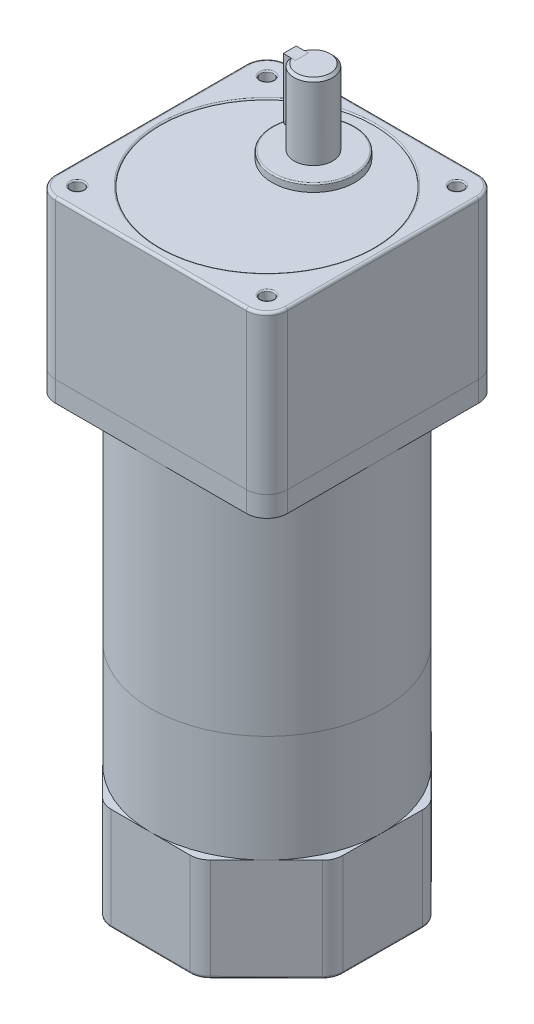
ISO-10303-21;
HEADER;
FILE_DESCRIPTION(('STEP AP214'),'2;1');
FILE_NAME('part.step','',(''),(''),'','','');
FILE_SCHEMA(('AUTOMOTIVE_DESIGN { 1 0 10303 214 1 1 1 1 }'));
ENDSEC;
DATA;
#1=APPLICATION_CONTEXT('core data for automotive mechanical design processes');
#2=APPLICATION_PROTOCOL_DEFINITION('international standard','automotive_design',2000,#1);
#3=PRODUCT_CONTEXT('',#1,'mechanical');
#4=PRODUCT('Part','Part','',(#3));
#5=PRODUCT_RELATED_PRODUCT_CATEGORY('part','',(#4));
#6=PRODUCT_DEFINITION_FORMATION('','',#4);
#7=PRODUCT_DEFINITION_CONTEXT('part definition',#1,'design');
#8=PRODUCT_DEFINITION('design','',#6,#7);
#9=PRODUCT_DEFINITION_SHAPE('','',#8);
#10=(LENGTH_UNIT() NAMED_UNIT(*) SI_UNIT(.MILLI.,.METRE.));
#11=(NAMED_UNIT(*) PLANE_ANGLE_UNIT() SI_UNIT($,.RADIAN.));
#12=(NAMED_UNIT(*) SI_UNIT($,.STERADIAN.) SOLID_ANGLE_UNIT());
#13=UNCERTAINTY_MEASURE_WITH_UNIT(LENGTH_MEASURE(1.E-05),#10,'distance_accuracy_value','');
#14=(GEOMETRIC_REPRESENTATION_CONTEXT(3) GLOBAL_UNCERTAINTY_ASSIGNED_CONTEXT((#13)) GLOBAL_UNIT_ASSIGNED_CONTEXT((#10,
#11,#12)) REPRESENTATION_CONTEXT('',''));
#15=CARTESIAN_POINT('',(0.,0.,0.));
#16=DIRECTION('',(0.,0.,1.));
#17=DIRECTION('',(1.,0.,0.));
#18=AXIS2_PLACEMENT_3D('',#15,#16,#17);
#19=CARTESIAN_POINT('',(-9.5,9.5,-18.));
#20=DIRECTION('',(1.,0.,0.));
#21=DIRECTION('',(0.,0.,-1.));
#22=AXIS2_PLACEMENT_3D('',#19,#20,#21);
#23=CYLINDRICAL_SURFACE('',#22,2.5);
#24=DIRECTION('',(1.,0.,0.));
#25=VECTOR('',#24,1.);
#26=CARTESIAN_POINT('',(-9.5,9.5,-15.5));
#27=LINE('',#26,#25);
#28=CARTESIAN_POINT('',(-9.19999999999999,9.5,-15.5));
#29=VERTEX_POINT('',#28);
#30=CARTESIAN_POINT('',(-4.5,9.5,-15.5));
#31=VERTEX_POINT('',#30);
#32=EDGE_CURVE('E101',#29,#31,#27,.T.);
#33=ORIENTED_EDGE('',*,*,#32,.F.);
#34=CARTESIAN_POINT('',(-9.19999999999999,9.5,-18.));
#35=DIRECTION('',(-1.,0.,0.));
#36=DIRECTION('',(0.,0.,1.));
#37=AXIS2_PLACEMENT_3D('',#34,#35,#36);
#38=CIRCLE('',#37,2.5);
#39=CARTESIAN_POINT('',(-9.19999999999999,9.5,-20.5));
#40=VERTEX_POINT('',#39);
#41=EDGE_CURVE('E59',#29,#40,#38,.F.);
#42=ORIENTED_EDGE('',*,*,#41,.T.);
#43=DIRECTION('',(1.,0.,0.));
#44=VECTOR('',#43,1.);
#45=CARTESIAN_POINT('',(-9.5,9.5,-20.5));
#46=LINE('',#45,#44);
#47=CARTESIAN_POINT('',(-4.5,9.5,-20.5));
#48=VERTEX_POINT('',#47);
#49=EDGE_CURVE('E118',#40,#48,#46,.T.);
#50=ORIENTED_EDGE('',*,*,#49,.T.);
#51=CARTESIAN_POINT('',(-4.5,9.5,-18.));
#52=DIRECTION('',(-1.,0.,0.));
#53=DIRECTION('',(0.,0.,1.));
#54=AXIS2_PLACEMENT_3D('',#51,#52,#53);
#55=CIRCLE('',#54,2.5);
#56=EDGE_CURVE('E114',#48,#31,#55,.T.);
#57=ORIENTED_EDGE('',*,*,#56,.T.);
#58=EDGE_LOOP('',(#33,#42,#50,#57));
#59=FACE_BOUND('',#58,.T.);
#60=ADVANCED_FACE('F50',(#59),#23,.T.);
#61=CARTESIAN_POINT('',(-9.5,32.,-15.5));
#62=DIRECTION('',(0.,0.,-1.));
#63=DIRECTION('',(-1.,0.,0.));
#64=AXIS2_PLACEMENT_3D('',#61,#62,#63);
#65=PLANE('',#64);
#66=DIRECTION('',(1.,0.,0.));
#67=VECTOR('',#66,1.);
#68=CARTESIAN_POINT('',(-9.5,32.,-15.5));
#69=LINE('',#68,#67);
#70=CARTESIAN_POINT('',(-9.19999999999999,32.,-15.5));
#71=VERTEX_POINT('',#70);
#72=CARTESIAN_POINT('',(-4.5,32.,-15.5));
#73=VERTEX_POINT('',#72);
#74=EDGE_CURVE('E108',#71,#73,#69,.T.);
#75=ORIENTED_EDGE('',*,*,#74,.F.);
#76=DIRECTION('',(0.,-1.,0.));
#77=VECTOR('',#76,1.);
#78=CARTESIAN_POINT('',(-9.19999999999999,9.5,-15.5));
#79=LINE('',#78,#77);
#80=EDGE_CURVE('E12',#71,#29,#79,.T.);
#81=ORIENTED_EDGE('',*,*,#80,.T.);
#82=ORIENTED_EDGE('',*,*,#32,.T.);
#83=DIRECTION('',(0.,1.,0.));
#84=VECTOR('',#83,1.);
#85=CARTESIAN_POINT('',(-4.5,32.,-15.5));
#86=LINE('',#85,#84);
#87=EDGE_CURVE('E104',#31,#73,#86,.T.);
#88=ORIENTED_EDGE('',*,*,#87,.T.);
#89=EDGE_LOOP('',(#75,#81,#82,#88));
#90=FACE_BOUND('',#89,.T.);
#91=ADVANCED_FACE('F103',(#90),#65,.F.);
#92=CARTESIAN_POINT('',(-9.5,32.,-20.5));
#93=DIRECTION('',(0.,-1.,0.));
#94=DIRECTION('',(0.,0.,-1.));
#95=AXIS2_PLACEMENT_3D('',#92,#93,#94);
#96=PLANE('',#95);
#97=DIRECTION('',(1.,0.,0.));
#98=VECTOR('',#97,1.);
#99=CARTESIAN_POINT('',(-9.5,32.,-20.5));
#100=LINE('',#99,#98);
#101=CARTESIAN_POINT('',(-9.19999999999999,32.,-20.5));
#102=VERTEX_POINT('',#101);
#103=CARTESIAN_POINT('',(-4.5,32.,-20.5));
#104=VERTEX_POINT('',#103);
#105=EDGE_CURVE('E128',#102,#104,#100,.T.);
#106=ORIENTED_EDGE('',*,*,#105,.F.);
#107=DIRECTION('',(0.,0.,1.));
#108=VECTOR('',#107,1.);
#109=CARTESIAN_POINT('',(-9.19999999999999,32.,-15.5));
#110=LINE('',#109,#108);
#111=EDGE_CURVE('E139',#102,#71,#110,.T.);
#112=ORIENTED_EDGE('',*,*,#111,.T.);
#113=ORIENTED_EDGE('',*,*,#74,.T.);
#114=DIRECTION('',(0.,0.,-1.));
#115=VECTOR('',#114,1.);
#116=CARTESIAN_POINT('',(-4.5,32.,-20.5));
#117=LINE('',#116,#115);
#118=EDGE_CURVE('E116',#73,#104,#117,.T.);
#119=ORIENTED_EDGE('',*,*,#118,.T.);
#120=EDGE_LOOP('',(#106,#112,#113,#119));
#121=FACE_BOUND('',#120,.T.);
#122=ADVANCED_FACE('F168',(#121),#96,.F.);
#123=CARTESIAN_POINT('',(-9.5,9.5,-20.5));
#124=DIRECTION('',(0.,0.,1.));
#125=DIRECTION('',(1.,0.,0.));
#126=AXIS2_PLACEMENT_3D('',#123,#124,#125);
#127=PLANE('',#126);
#128=ORIENTED_EDGE('',*,*,#49,.F.);
#129=DIRECTION('',(0.,1.,0.));
#130=VECTOR('',#129,1.);
#131=CARTESIAN_POINT('',(-9.19999999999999,32.,-20.5));
#132=LINE('',#131,#130);
#133=EDGE_CURVE('E142',#40,#102,#132,.T.);
#134=ORIENTED_EDGE('',*,*,#133,.T.);
#135=ORIENTED_EDGE('',*,*,#105,.T.);
#136=DIRECTION('',(0.,-1.,0.));
#137=VECTOR('',#136,1.);
#138=CARTESIAN_POINT('',(-4.5,9.5,-20.5));
#139=LINE('',#138,#137);
#140=EDGE_CURVE('E125',#104,#48,#139,.T.);
#141=ORIENTED_EDGE('',*,*,#140,.T.);
#142=EDGE_LOOP('',(#128,#134,#135,#141));
#143=FACE_BOUND('',#142,.T.);
#144=ADVANCED_FACE('F170',(#143),#127,.F.);
#145=CARTESIAN_POINT('',(-9.5,9.5,-18.));
#146=DIRECTION('',(-1.,0.,0.));
#147=DIRECTION('',(0.,0.,1.));
#148=AXIS2_PLACEMENT_3D('',#145,#146,#147);
#149=PLANE('',#148);
#150=DIRECTION('',(0.,1.,0.));
#151=VECTOR('',#150,1.);
#152=CARTESIAN_POINT('',(-9.5,32.,-15.8));
#153=LINE('',#152,#151);
#154=CARTESIAN_POINT('',(-9.5,9.5,-15.8));
#155=VERTEX_POINT('',#154);
#156=CARTESIAN_POINT('',(-9.5,31.7,-15.8));
#157=VERTEX_POINT('',#156);
#158=EDGE_CURVE('E107',#155,#157,#153,.T.);
#159=ORIENTED_EDGE('',*,*,#158,.T.);
#160=DIRECTION('',(0.,0.,-1.));
#161=VECTOR('',#160,1.);
#162=CARTESIAN_POINT('',(-9.5,31.7,-20.5));
#163=LINE('',#162,#161);
#164=CARTESIAN_POINT('',(-9.5,31.7,-20.2));
#165=VERTEX_POINT('',#164);
#166=EDGE_CURVE('E136',#157,#165,#163,.T.);
#167=ORIENTED_EDGE('',*,*,#166,.T.);
#168=DIRECTION('',(0.,-1.,0.));
#169=VECTOR('',#168,1.);
#170=CARTESIAN_POINT('',(-9.5,9.5,-20.2));
#171=LINE('',#170,#169);
#172=CARTESIAN_POINT('',(-9.5,9.5,-20.2));
#173=VERTEX_POINT('',#172);
#174=EDGE_CURVE('E134',#165,#173,#171,.T.);
#175=ORIENTED_EDGE('',*,*,#174,.T.);
#176=CARTESIAN_POINT('',(-9.5,9.5,-18.));
#177=DIRECTION('',(-1.,0.,0.));
#178=DIRECTION('',(0.,0.,1.));
#179=AXIS2_PLACEMENT_3D('',#176,#177,#178);
#180=CIRCLE('',#179,2.19999999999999);
#181=EDGE_CURVE('E132',#173,#155,#180,.T.);
#182=ORIENTED_EDGE('',*,*,#181,.T.);
#183=EDGE_LOOP('',(#159,#167,#175,#182));
#184=FACE_BOUND('',#183,.T.);
#185=ADVANCED_FACE('F160',(#184),#149,.T.);
#186=CARTESIAN_POINT('',(-4.5,9.5,-18.));
#187=DIRECTION('',(-1.,0.,0.));
#188=DIRECTION('',(0.,0.,1.));
#189=AXIS2_PLACEMENT_3D('',#186,#187,#188);
#190=PLANE('',#189);
#191=ORIENTED_EDGE('',*,*,#56,.F.);
#192=ORIENTED_EDGE('',*,*,#140,.F.);
#193=ORIENTED_EDGE('',*,*,#118,.F.);
#194=ORIENTED_EDGE('',*,*,#87,.F.);
#195=EDGE_LOOP('',(#191,#192,#193,#194));
#196=FACE_BOUND('',#195,.T.);
#197=ADVANCED_FACE('F112',(#196),#190,.F.);
#198=CARTESIAN_POINT('',(-9.5,9.5,-18.));
#199=DIRECTION('',(1.,0.,0.));
#200=DIRECTION('',(0.,0.,-1.));
#201=AXIS2_PLACEMENT_3D('',#198,#199,#200);
#202=CONICAL_SURFACE('',#201,2.19999999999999,0.785398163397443);
#203=DIRECTION('',(-0.707106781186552,0.,0.707106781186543));
#204=VECTOR('',#203,1.);
#205=CARTESIAN_POINT('',(-9.19999999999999,9.5,-20.5));
#206=LINE('',#205,#204);
#207=EDGE_CURVE('E122',#40,#173,#206,.T.);
#208=ORIENTED_EDGE('',*,*,#207,.F.);
#209=ORIENTED_EDGE('',*,*,#41,.F.);
#210=DIRECTION('',(0.707106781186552,0.,0.707106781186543));
#211=VECTOR('',#210,1.);
#212=CARTESIAN_POINT('',(-9.5,9.5,-15.8));
#213=LINE('',#212,#211);
#214=EDGE_CURVE('E54',#155,#29,#213,.T.);
#215=ORIENTED_EDGE('',*,*,#214,.F.);
#216=ORIENTED_EDGE('',*,*,#181,.F.);
#217=EDGE_LOOP('',(#208,#209,#215,#216));
#218=FACE_BOUND('',#217,.T.);
#219=ADVANCED_FACE('F52',(#218),#202,.T.);
#220=CARTESIAN_POINT('',(-9.5,9.5,-15.8));
#221=DIRECTION('',(-0.707106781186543,0.,0.707106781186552));
#222=DIRECTION('',(0.,-1.,0.));
#223=AXIS2_PLACEMENT_3D('',#220,#221,#222);
#224=PLANE('',#223);
#225=ORIENTED_EDGE('',*,*,#214,.T.);
#226=ORIENTED_EDGE('',*,*,#80,.F.);
#227=DIRECTION('',(-0.577350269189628,-0.577350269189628,-0.577350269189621));
#228=VECTOR('',#227,1.);
#229=CARTESIAN_POINT('',(-16.9000000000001,24.2999999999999,-23.2));
#230=LINE('',#229,#228);
#231=EDGE_CURVE('E147',#157,#71,#230,.F.);
#232=ORIENTED_EDGE('',*,*,#231,.F.);
#233=ORIENTED_EDGE('',*,*,#158,.F.);
#234=EDGE_LOOP('',(#225,#226,#232,#233));
#235=FACE_BOUND('',#234,.T.);
#236=ADVANCED_FACE('F190',(#235),#224,.T.);
#237=CARTESIAN_POINT('',(-9.5,9.5,-20.2));
#238=DIRECTION('',(-0.707106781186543,0.,-0.707106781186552));
#239=DIRECTION('',(0.,1.,0.));
#240=AXIS2_PLACEMENT_3D('',#237,#238,#239);
#241=PLANE('',#240);
#242=ORIENTED_EDGE('',*,*,#207,.T.);
#243=ORIENTED_EDGE('',*,*,#174,.F.);
#244=DIRECTION('',(0.577350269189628,0.577350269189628,-0.577350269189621));
#245=VECTOR('',#244,1.);
#246=CARTESIAN_POINT('',(-16.9000000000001,24.2999999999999,-12.8));
#247=LINE('',#246,#245);
#248=EDGE_CURVE('E145',#102,#165,#247,.F.);
#249=ORIENTED_EDGE('',*,*,#248,.F.);
#250=ORIENTED_EDGE('',*,*,#133,.F.);
#251=EDGE_LOOP('',(#242,#243,#249,#250));
#252=FACE_BOUND('',#251,.T.);
#253=ADVANCED_FACE('F153',(#252),#241,.T.);
#254=CARTESIAN_POINT('',(-9.5,31.7,-18.));
#255=DIRECTION('',(-0.707106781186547,0.707106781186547,0.));
#256=DIRECTION('',(0.,0.,1.));
#257=AXIS2_PLACEMENT_3D('',#254,#255,#256);
#258=PLANE('',#257);
#259=ORIENTED_EDGE('',*,*,#231,.T.);
#260=ORIENTED_EDGE('',*,*,#111,.F.);
#261=ORIENTED_EDGE('',*,*,#248,.T.);
#262=ORIENTED_EDGE('',*,*,#166,.F.);
#263=EDGE_LOOP('',(#259,#260,#261,#262));
#264=FACE_BOUND('',#263,.T.);
#265=ADVANCED_FACE('F164',(#264),#258,.T.);
#266=CLOSED_SHELL('',(#60,#91,#122,#144,#185,#197,#219,#236,#253,#265));
#267=MANIFOLD_SOLID_BREP('B2',#266);
#268=CARTESIAN_POINT('',(0.,32.,-18.));
#269=DIRECTION('',(0.,-1.,0.));
#270=DIRECTION('',(0.,0.,-1.));
#271=AXIS2_PLACEMENT_3D('',#268,#269,#270);
#272=CYLINDRICAL_SURFACE('',#271,7.5);
#273=CARTESIAN_POINT('',(0.,3.,-18.));
#274=DIRECTION('',(0.,1.,0.));
#275=DIRECTION('',(0.,0.,1.));
#276=AXIS2_PLACEMENT_3D('',#273,#274,#275);
#277=CIRCLE('',#276,7.5);
#278=CARTESIAN_POINT('',(0.,3.,-10.5));
#279=VERTEX_POINT('',#278);
#280=EDGE_CURVE('E342',#279,#279,#277,.T.);
#281=ORIENTED_EDGE('',*,*,#280,.T.);
#282=EDGE_LOOP('',(#281));
#283=FACE_BOUND('',#282,.T.);
#284=DIRECTION('',(0.,-1.,0.));
#285=VECTOR('',#284,1.);
#286=CARTESIAN_POINT('',(-7.07106781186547,32.,-20.5));
#287=LINE('',#286,#285);
#288=CARTESIAN_POINT('',(-7.07106781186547,31.,-20.5));
#289=VERTEX_POINT('',#288);
#290=CARTESIAN_POINT('',(-7.07106781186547,9.5,-20.5));
#291=VERTEX_POINT('',#290);
#292=EDGE_CURVE('E331',#289,#291,#287,.T.);
#293=ORIENTED_EDGE('',*,*,#292,.F.);
#294=CARTESIAN_POINT('',(0.,31.,-18.));
#295=DIRECTION('',(0.,1.,0.));
#296=DIRECTION('',(0.,0.,1.));
#297=AXIS2_PLACEMENT_3D('',#294,#295,#296);
#298=CIRCLE('',#297,7.5);
#299=CARTESIAN_POINT('',(-7.07106781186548,31.,-15.5));
#300=VERTEX_POINT('',#299);
#301=EDGE_CURVE('E275',#289,#300,#298,.F.);
#302=ORIENTED_EDGE('',*,*,#301,.T.);
#303=DIRECTION('',(0.,-1.,0.));
#304=VECTOR('',#303,1.);
#305=CARTESIAN_POINT('',(-7.07106781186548,32.,-15.5));
#306=LINE('',#305,#304);
#307=CARTESIAN_POINT('',(-7.07106781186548,9.5,-15.5));
#308=VERTEX_POINT('',#307);
#309=EDGE_CURVE('E333',#308,#300,#306,.F.);
#310=ORIENTED_EDGE('',*,*,#309,.F.);
#311=CARTESIAN_POINT('',(-7.07106781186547,9.5,-20.5));
#312=CARTESIAN_POINT('',(-7.07105693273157,9.43179292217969,-20.5000089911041));
#313=CARTESIAN_POINT('',(-7.07205443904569,9.36359192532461,-20.4972088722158));
#314=CARTESIAN_POINT('',(-7.07598524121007,9.22771896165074,-20.4860604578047));
#315=CARTESIAN_POINT('',(-7.07891801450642,9.16004685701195,-20.477713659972));
#316=CARTESIAN_POINT('',(-7.08662705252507,9.02590951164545,-20.455574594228));
#317=CARTESIAN_POINT('',(-7.09139784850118,8.95944129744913,-20.4417984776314));
#318=CARTESIAN_POINT('',(-7.10262619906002,8.8279917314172,-20.4089418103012));
#319=CARTESIAN_POINT('',(-7.10908381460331,8.7630104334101,-20.3898610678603));
#320=CARTESIAN_POINT('',(-7.13069940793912,8.57103842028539,-20.324915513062));
#321=CARTESIAN_POINT('',(-7.14811243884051,8.44682084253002,-20.2713141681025));
#322=CARTESIAN_POINT('',(-7.1869703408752,8.20912318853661,-20.1451778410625));
#323=CARTESIAN_POINT('',(-7.20841768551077,8.09564976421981,-20.0726312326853));
#324=CARTESIAN_POINT('',(-7.25386182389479,7.87820709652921,-19.9076299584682));
#325=CARTESIAN_POINT('',(-7.27792189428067,7.7747148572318,-19.8145628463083));
#326=CARTESIAN_POINT('',(-7.32534626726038,7.58448289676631,-19.6124707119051));
#327=CARTESIAN_POINT('',(-7.34871044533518,7.49774615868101,-19.5034428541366));
#328=CARTESIAN_POINT('',(-7.39284706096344,7.34130177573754,-19.2690092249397));
#329=CARTESIAN_POINT('',(-7.41353593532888,7.27209769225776,-19.1432502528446));
#330=CARTESIAN_POINT('',(-7.44924021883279,7.1560192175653,-18.8810730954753));
#331=CARTESIAN_POINT('',(-7.46425736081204,7.10913800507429,-18.7446581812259));
#332=CARTESIAN_POINT('',(-7.48647677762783,7.04066072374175,-18.4700733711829));
#333=CARTESIAN_POINT('',(-7.49393272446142,7.01824182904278,-18.3321295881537));
#334=CARTESIAN_POINT('',(-7.50109021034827,6.99670924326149,-18.0542474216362));
#335=CARTESIAN_POINT('',(-7.50079359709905,6.99758999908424,-17.9143095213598));
#336=CARTESIAN_POINT('',(-7.49265096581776,7.0221107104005,-17.6422403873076));
#337=CARTESIAN_POINT('',(-7.48510152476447,7.04485659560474,-17.5100182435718));
#338=CARTESIAN_POINT('',(-7.46367401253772,7.1109829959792,-17.2513898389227));
#339=CARTESIAN_POINT('',(-7.44979559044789,7.15436465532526,-17.1249839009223));
#340=CARTESIAN_POINT('',(-7.41689170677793,7.26105342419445,-16.8796184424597));
#341=CARTESIAN_POINT('',(-7.39780094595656,7.32461511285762,-16.760778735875));
#342=CARTESIAN_POINT('',(-7.35645969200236,7.46964987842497,-16.5351885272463));
#343=CARTESIAN_POINT('',(-7.33420833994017,7.55112782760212,-16.4284413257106));
#344=CARTESIAN_POINT('',(-7.28765679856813,7.73417762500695,-16.2247566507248));
#345=CARTESIAN_POINT('',(-7.26330946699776,7.83651385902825,-16.128515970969));
#346=CARTESIAN_POINT('',(-7.21618726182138,8.05610372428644,-15.9543199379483));
#347=CARTESIAN_POINT('',(-7.19341289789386,8.17336215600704,-15.8763704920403));
#348=CARTESIAN_POINT('',(-7.15175078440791,8.4217004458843,-15.7399916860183));
#349=CARTESIAN_POINT('',(-7.13292537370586,8.55295878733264,-15.6818674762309));
#350=CARTESIAN_POINT('',(-7.10202742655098,8.8241174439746,-15.5888494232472));
#351=CARTESIAN_POINT('',(-7.08994423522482,8.96400373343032,-15.5539189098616));
#352=CARTESIAN_POINT('',(-7.078413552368,9.17104659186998,-15.5208546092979));
#353=CARTESIAN_POINT('',(-7.07566669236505,9.23660347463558,-15.5130373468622));
#354=CARTESIAN_POINT('',(-7.07199258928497,9.36809519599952,-15.502613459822));
#355=CARTESIAN_POINT('',(-7.0710629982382,9.43402943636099,-15.5000001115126));
#356=CARTESIAN_POINT('',(-7.07106781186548,9.5,-15.5));
#357=B_SPLINE_CURVE_WITH_KNOTS('',3,(#311,#312,#313,#314,#315,#316,#317,#318,#319,#320,#321,
#322,#323,#324,#325,#326,#327,#328,#329,#330,#331,#332,#333,#334,#335,#336,#337,#338,#339,#340,
#341,#342,#343,#344,#345,#346,#347,#348,#349,#350,#351,#352,#353,#354,#355,#356),.UNSPECIFIED.,
.F.,.F.,(4,2,2,2,2,2,2,2,2,2,2,2,2,2,2,2,2,2,2,2,2,2,4),(0.,0.204546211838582,0.409037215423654,
0.612924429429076,0.81681901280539,1.22401016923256,1.63145179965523,2.0532786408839,
2.47518051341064,2.90809434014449,3.34087579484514,3.75860278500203,4.17623021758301,
4.57747647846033,4.97874498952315,5.38529148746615,5.79194868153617,6.21771736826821,
6.64362337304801,7.07581676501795,7.50732520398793,7.70536340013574,7.90314555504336),.UNSPECIFIED.);
#358=EDGE_CURVE('E345',#291,#308,#357,.T.);
#359=ORIENTED_EDGE('',*,*,#358,.F.);
#360=EDGE_LOOP('',(#293,#302,#310,#359));
#361=FACE_BOUND('',#360,.T.);
#362=ADVANCED_FACE('F262',(#283,#361),#272,.T.);
#363=CARTESIAN_POINT('',(0.,32.,-18.));
#364=DIRECTION('',(0.,1.,0.));
#365=DIRECTION('',(0.,0.,1.));
#366=AXIS2_PLACEMENT_3D('',#363,#364,#365);
#367=PLANE('',#366);
#368=DIRECTION('',(-1.,0.,0.));
#369=VECTOR('',#368,1.);
#370=CARTESIAN_POINT('',(-4.5,32.,-15.5));
#371=LINE('',#370,#369);
#372=CARTESIAN_POINT('',(-4.5,32.,-15.5));
#373=VERTEX_POINT('',#372);
#374=CARTESIAN_POINT('',(-6.00000000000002,32.,-15.5));
#375=VERTEX_POINT('',#374);
#376=EDGE_CURVE('E337',#373,#375,#371,.T.);
#377=ORIENTED_EDGE('',*,*,#376,.T.);
#378=CARTESIAN_POINT('',(0.,32.,-18.));
#379=DIRECTION('',(0.,1.,0.));
#380=DIRECTION('',(0.,0.,1.));
#381=AXIS2_PLACEMENT_3D('',#378,#379,#380);
#382=CIRCLE('',#381,6.50000000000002);
#383=CARTESIAN_POINT('',(-6.00000000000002,32.,-20.5));
#384=VERTEX_POINT('',#383);
#385=EDGE_CURVE('E351',#375,#384,#382,.T.);
#386=ORIENTED_EDGE('',*,*,#385,.T.);
#387=DIRECTION('',(-1.,0.,0.));
#388=VECTOR('',#387,1.);
#389=CARTESIAN_POINT('',(-4.5,32.,-20.5));
#390=LINE('',#389,#388);
#391=CARTESIAN_POINT('',(-4.5,32.,-20.5));
#392=VERTEX_POINT('',#391);
#393=EDGE_CURVE('E334',#392,#384,#390,.T.);
#394=ORIENTED_EDGE('',*,*,#393,.F.);
#395=DIRECTION('',(0.,0.,1.));
#396=VECTOR('',#395,1.);
#397=CARTESIAN_POINT('',(-4.5,32.,-20.5));
#398=LINE('',#397,#396);
#399=EDGE_CURVE('E318',#392,#373,#398,.T.);
#400=ORIENTED_EDGE('',*,*,#399,.T.);
#401=EDGE_LOOP('',(#377,#386,#394,#400));
#402=FACE_BOUND('',#401,.T.);
#403=ADVANCED_FACE('F361',(#402),#367,.T.);
#404=CARTESIAN_POINT('',(0.,3.,-18.));
#405=DIRECTION('',(0.,1.,0.));
#406=DIRECTION('',(0.,0.,1.));
#407=AXIS2_PLACEMENT_3D('',#404,#405,#406);
#408=PLANE('',#407);
#409=ORIENTED_EDGE('',*,*,#280,.F.);
#410=EDGE_LOOP('',(#409));
#411=FACE_BOUND('',#410,.T.);
#412=ADVANCED_FACE('F359',(#411),#408,.F.);
#413=CARTESIAN_POINT('',(-4.5,9.5,-18.));
#414=DIRECTION('',(-1.,0.,0.));
#415=DIRECTION('',(0.,0.,1.));
#416=AXIS2_PLACEMENT_3D('',#413,#414,#415);
#417=CYLINDRICAL_SURFACE('',#416,2.5);
#418=DIRECTION('',(-1.,0.,0.));
#419=VECTOR('',#418,1.);
#420=CARTESIAN_POINT('',(-4.5,9.5,-20.5));
#421=LINE('',#420,#419);
#422=CARTESIAN_POINT('',(-4.5,9.5,-20.5));
#423=VERTEX_POINT('',#422);
#424=EDGE_CURVE('E326',#423,#291,#421,.T.);
#425=ORIENTED_EDGE('',*,*,#424,.T.);
#426=ORIENTED_EDGE('',*,*,#358,.T.);
#427=DIRECTION('',(-1.,0.,0.));
#428=VECTOR('',#427,1.);
#429=CARTESIAN_POINT('',(-4.5,9.5,-15.5));
#430=LINE('',#429,#428);
#431=CARTESIAN_POINT('',(-4.5,9.5,-15.5));
#432=VERTEX_POINT('',#431);
#433=EDGE_CURVE('E328',#432,#308,#430,.T.);
#434=ORIENTED_EDGE('',*,*,#433,.F.);
#435=CARTESIAN_POINT('',(-4.5,9.5,-18.));
#436=DIRECTION('',(1.,0.,0.));
#437=DIRECTION('',(0.,0.,-1.));
#438=AXIS2_PLACEMENT_3D('',#435,#436,#437);
#439=CIRCLE('',#438,2.5);
#440=EDGE_CURVE('E316',#432,#423,#439,.T.);
#441=ORIENTED_EDGE('',*,*,#440,.T.);
#442=EDGE_LOOP('',(#425,#426,#434,#441));
#443=FACE_BOUND('',#442,.T.);
#444=ADVANCED_FACE('F325',(#443),#417,.F.);
#445=CARTESIAN_POINT('',(-4.5,9.5,-20.5));
#446=DIRECTION('',(0.,0.,1.));
#447=DIRECTION('',(1.,0.,0.));
#448=AXIS2_PLACEMENT_3D('',#445,#446,#447);
#449=PLANE('',#448);
#450=ORIENTED_EDGE('',*,*,#393,.T.);
#451=CARTESIAN_POINT('',(-6.00000000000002,32.,-20.5));
#452=CARTESIAN_POINT('',(-6.0897273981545,31.9171731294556,-20.5));
#453=CARTESIAN_POINT('',(-6.17931930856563,31.8341996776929,-20.5));
#454=CARTESIAN_POINT('',(-6.35825867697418,31.6679908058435,-20.5));
#455=CARTESIAN_POINT('',(-6.44760613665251,31.5847553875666,-20.5));
#456=CARTESIAN_POINT('',(-6.62608424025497,31.4180527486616,-20.5));
#457=CARTESIAN_POINT('',(-6.7152148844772,31.3345855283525,-20.5));
#458=CARTESIAN_POINT('',(-6.89328182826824,31.1674427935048,-20.5));
#459=CARTESIAN_POINT('',(-6.98221812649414,31.0837672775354,-20.5));
#460=CARTESIAN_POINT('',(-7.07106781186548,31.,-20.5));
#461=B_SPLINE_CURVE_WITH_KNOTS('',3,(#451,#452,#453,#454,#455,#456,#457,#458,#459,#460),
.UNSPECIFIED.,.F.,.F.,(4,2,2,2,4),(0.,0.366335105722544,0.732667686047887,1.09899976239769,
1.46533436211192),.UNSPECIFIED.);
#462=EDGE_CURVE('E289',#384,#289,#461,.T.);
#463=ORIENTED_EDGE('',*,*,#462,.T.);
#464=ORIENTED_EDGE('',*,*,#292,.T.);
#465=ORIENTED_EDGE('',*,*,#424,.F.);
#466=DIRECTION('',(0.,1.,0.));
#467=VECTOR('',#466,1.);
#468=CARTESIAN_POINT('',(-4.5,9.5,-20.5));
#469=LINE('',#468,#467);
#470=EDGE_CURVE('E313',#423,#392,#469,.T.);
#471=ORIENTED_EDGE('',*,*,#470,.T.);
#472=EDGE_LOOP('',(#450,#463,#464,#465,#471));
#473=FACE_BOUND('',#472,.T.);
#474=ADVANCED_FACE('F330',(#473),#449,.T.);
#475=CARTESIAN_POINT('',(-4.5,32.,-15.5));
#476=DIRECTION('',(0.,0.,-1.));
#477=DIRECTION('',(-1.,0.,0.));
#478=AXIS2_PLACEMENT_3D('',#475,#476,#477);
#479=PLANE('',#478);
#480=ORIENTED_EDGE('',*,*,#309,.T.);
#481=CARTESIAN_POINT('',(-7.07106781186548,31.,-15.5));
#482=CARTESIAN_POINT('',(-6.98221812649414,31.0837672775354,-15.5));
#483=CARTESIAN_POINT('',(-6.89328182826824,31.1674427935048,-15.5));
#484=CARTESIAN_POINT('',(-6.7152148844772,31.3345855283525,-15.5));
#485=CARTESIAN_POINT('',(-6.62608424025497,31.4180527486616,-15.5));
#486=CARTESIAN_POINT('',(-6.44760613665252,31.5847553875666,-15.5));
#487=CARTESIAN_POINT('',(-6.35825867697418,31.6679908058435,-15.5));
#488=CARTESIAN_POINT('',(-6.17931930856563,31.8341996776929,-15.5));
#489=CARTESIAN_POINT('',(-6.0897273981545,31.9171731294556,-15.5));
#490=CARTESIAN_POINT('',(-6.00000000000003,32.,-15.5));
#491=B_SPLINE_CURVE_WITH_KNOTS('',3,(#481,#482,#483,#484,#485,#486,#487,#488,#489,#490),
.UNSPECIFIED.,.F.,.F.,(4,2,2,2,4),(0.,0.36633459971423,0.732666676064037,1.09899925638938,
1.46533436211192),.UNSPECIFIED.);
#492=EDGE_CURVE('E48',#300,#375,#491,.T.);
#493=ORIENTED_EDGE('',*,*,#492,.T.);
#494=ORIENTED_EDGE('',*,*,#376,.F.);
#495=DIRECTION('',(0.,-1.,0.));
#496=VECTOR('',#495,1.);
#497=CARTESIAN_POINT('',(-4.5,32.,-15.5));
#498=LINE('',#497,#496);
#499=EDGE_CURVE('E383',#373,#432,#498,.T.);
#500=ORIENTED_EDGE('',*,*,#499,.T.);
#501=ORIENTED_EDGE('',*,*,#433,.T.);
#502=EDGE_LOOP('',(#480,#493,#494,#500,#501));
#503=FACE_BOUND('',#502,.T.);
#504=ADVANCED_FACE('F387',(#503),#479,.T.);
#505=CARTESIAN_POINT('',(-4.5,9.5,-18.));
#506=DIRECTION('',(1.,0.,0.));
#507=DIRECTION('',(0.,0.,-1.));
#508=AXIS2_PLACEMENT_3D('',#505,#506,#507);
#509=PLANE('',#508);
#510=ORIENTED_EDGE('',*,*,#440,.F.);
#511=ORIENTED_EDGE('',*,*,#499,.F.);
#512=ORIENTED_EDGE('',*,*,#399,.F.);
#513=ORIENTED_EDGE('',*,*,#470,.F.);
#514=EDGE_LOOP('',(#510,#511,#512,#513));
#515=FACE_BOUND('',#514,.T.);
#516=ADVANCED_FACE('F315',(#515),#509,.F.);
#517=CARTESIAN_POINT('',(0.,32.,-18.));
#518=DIRECTION('',(0.,-1.,0.));
#519=DIRECTION('',(0.,0.,-1.));
#520=AXIS2_PLACEMENT_3D('',#517,#518,#519);
#521=CONICAL_SURFACE('',#520,6.50000000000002,0.785398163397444);
#522=ORIENTED_EDGE('',*,*,#492,.F.);
#523=ORIENTED_EDGE('',*,*,#301,.F.);
#524=ORIENTED_EDGE('',*,*,#462,.F.);
#525=ORIENTED_EDGE('',*,*,#385,.F.);
#526=EDGE_LOOP('',(#522,#523,#524,#525));
#527=FACE_BOUND('',#526,.T.);
#528=ADVANCED_FACE('F264',(#527),#521,.T.);
#529=CLOSED_SHELL('',(#362,#403,#412,#444,#474,#504,#516,#528));
#530=MANIFOLD_SOLID_BREP('B6',#529);
#531=CARTESIAN_POINT('',(0.,3.,-18.));
#532=DIRECTION('',(0.,-1.,0.));
#533=DIRECTION('',(0.,0.,-1.));
#534=AXIS2_PLACEMENT_3D('',#531,#532,#533);
#535=CYLINDRICAL_SURFACE('',#534,16.);
#536=CARTESIAN_POINT('',(0.,2.5,-18.));
#537=DIRECTION('',(0.,1.,0.));
#538=DIRECTION('',(0.,0.,1.));
#539=AXIS2_PLACEMENT_3D('',#536,#537,#538);
#540=CIRCLE('',#539,16.);
#541=CARTESIAN_POINT('',(0.,2.5,-2.));
#542=VERTEX_POINT('',#541);
#543=EDGE_CURVE('E261',#542,#542,#540,.F.);
#544=ORIENTED_EDGE('',*,*,#543,.T.);
#545=EDGE_LOOP('',(#544));
#546=FACE_BOUND('',#545,.T.);
#547=CARTESIAN_POINT('',(0.,0.,-18.));
#548=DIRECTION('',(0.,1.,0.));
#549=DIRECTION('',(0.,0.,1.));
#550=AXIS2_PLACEMENT_3D('',#547,#548,#549);
#551=CIRCLE('',#550,16.);
#552=CARTESIAN_POINT('',(0.,0.,-2.));
#553=VERTEX_POINT('',#552);
#554=EDGE_CURVE('E463',#553,#553,#551,.T.);
#555=ORIENTED_EDGE('',*,*,#554,.T.);
#556=EDGE_LOOP('',(#555));
#557=FACE_BOUND('',#556,.T.);
#558=ADVANCED_FACE('F452',(#546,#557),#535,.T.);
#559=CARTESIAN_POINT('',(0.,3.,-18.));
#560=DIRECTION('',(0.,1.,0.));
#561=DIRECTION('',(0.,0.,1.));
#562=AXIS2_PLACEMENT_3D('',#559,#560,#561);
#563=PLANE('',#562);
#564=CARTESIAN_POINT('',(0.,3.,-18.));
#565=DIRECTION('',(0.,1.,0.));
#566=DIRECTION('',(0.,0.,1.));
#567=AXIS2_PLACEMENT_3D('',#564,#565,#566);
#568=CIRCLE('',#567,15.5);
#569=CARTESIAN_POINT('',(0.,3.,-2.5));
#570=VERTEX_POINT('',#569);
#571=EDGE_CURVE('E459',#570,#570,#568,.T.);
#572=ORIENTED_EDGE('',*,*,#571,.T.);
#573=EDGE_LOOP('',(#572));
#574=FACE_BOUND('',#573,.T.);
#575=ADVANCED_FACE('F473',(#574),#563,.T.);
#576=CARTESIAN_POINT('',(0.,0.,-18.));
#577=DIRECTION('',(0.,1.,0.));
#578=DIRECTION('',(0.,0.,1.));
#579=AXIS2_PLACEMENT_3D('',#576,#577,#578);
#580=PLANE('',#579);
#581=ORIENTED_EDGE('',*,*,#554,.F.);
#582=EDGE_LOOP('',(#581));
#583=FACE_BOUND('',#582,.T.);
#584=ADVANCED_FACE('F471',(#583),#580,.F.);
#585=CARTESIAN_POINT('',(0.,2.5,-18.));
#586=DIRECTION('',(0.,1.,0.));
#587=DIRECTION('',(0.,0.,1.));
#588=AXIS2_PLACEMENT_3D('',#585,#586,#587);
#589=TOROIDAL_SURFACE('',#588,15.5,0.5);
#590=ORIENTED_EDGE('',*,*,#543,.F.);
#591=EDGE_LOOP('',(#590));
#592=FACE_BOUND('',#591,.T.);
#593=ORIENTED_EDGE('',*,*,#571,.F.);
#594=EDGE_LOOP('',(#593));
#595=FACE_BOUND('',#594,.T.);
#596=ADVANCED_FACE('F454',(#592,#595),#589,.T.);
#597=CLOSED_SHELL('',(#558,#575,#584,#596));
#598=MANIFOLD_SOLID_BREP('B42',#597);
#599=CARTESIAN_POINT('',(36.9458082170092,-234.5,15.4560836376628));
#600=DIRECTION('',(0.,1.,0.));
#601=DIRECTION('',(0.,0.,1.));
#602=AXIS2_PLACEMENT_3D('',#599,#600,#601);
#603=CYLINDRICAL_SURFACE('',#602,8.);
#604=DIRECTION('',(0.,1.,0.));
#605=VECTOR('',#604,1.);
#606=CARTESIAN_POINT('',(42.5827096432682,-234.5,21.1328205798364));
#607=LINE('',#606,#605);
#608=CARTESIAN_POINT('',(42.5827096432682,-233.5,21.1328205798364));
#609=VERTEX_POINT('',#608);
#610=CARTESIAN_POINT('',(42.5827096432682,-194.5,21.1328205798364));
#611=VERTEX_POINT('',#610);
#612=EDGE_CURVE('E676',#609,#611,#607,.T.);
#613=ORIENTED_EDGE('',*,*,#612,.F.);
#614=CARTESIAN_POINT('',(36.9458082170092,-233.5,15.4560836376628));
#615=DIRECTION('',(0.,-1.,0.));
#616=DIRECTION('',(0.,0.,-1.));
#617=AXIS2_PLACEMENT_3D('',#614,#615,#616);
#618=CIRCLE('',#617,8.);
#619=CARTESIAN_POINT('',(44.9457586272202,-233.5,15.484251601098));
#620=VERTEX_POINT('',#619);
#621=EDGE_CURVE('E450',#609,#620,#618,.F.);
#622=ORIENTED_EDGE('',*,*,#621,.T.);
#623=DIRECTION('',(0.,1.,0.));
#624=VECTOR('',#623,1.);
#625=CARTESIAN_POINT('',(44.9457586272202,-234.5,15.484251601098));
#626=LINE('',#625,#624);
#627=CARTESIAN_POINT('',(44.9457586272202,-194.5,15.484251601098));
#628=VERTEX_POINT('',#627);
#629=EDGE_CURVE('E697',#620,#628,#626,.T.);
#630=ORIENTED_EDGE('',*,*,#629,.T.);
#631=CARTESIAN_POINT('',(36.9458082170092,-194.5,15.4560836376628));
#632=DIRECTION('',(0.,-1.,0.));
#633=DIRECTION('',(0.,0.,-1.));
#634=AXIS2_PLACEMENT_3D('',#631,#632,#633);
#635=CIRCLE('',#634,8.);
#636=EDGE_CURVE('E691',#628,#611,#635,.T.);
#637=ORIENTED_EDGE('',*,*,#636,.T.);
#638=EDGE_LOOP('',(#613,#622,#630,#637));
#639=FACE_BOUND('',#638,.T.);
#640=ADVANCED_FACE('F516',(#639),#603,.T.);
#641=CARTESIAN_POINT('',(42.5827096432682,-234.5,21.1328205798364));
#642=DIRECTION('',(-0.704612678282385,0.,-0.709592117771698));
#643=DIRECTION('',(-0.709592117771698,0.,0.704612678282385));
#644=AXIS2_PLACEMENT_3D('',#641,#642,#643);
#645=PLANE('',#644);
#646=DIRECTION('',(0.,1.,0.));
#647=VECTOR('',#646,1.);
#648=CARTESIAN_POINT('',(20.8324314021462,-234.5,42.7304700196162));
#649=LINE('',#648,#647);
#650=CARTESIAN_POINT('',(20.8324314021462,-233.5,42.7304700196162));
#651=VERTEX_POINT('',#650);
#652=CARTESIAN_POINT('',(20.8324314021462,-194.5,42.7304700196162));
#653=VERTEX_POINT('',#652);
#654=EDGE_CURVE('E685',#651,#653,#649,.T.);
#655=ORIENTED_EDGE('',*,*,#654,.F.);
#656=DIRECTION('',(-0.709592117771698,0.,0.704612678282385));
#657=VECTOR('',#656,1.);
#658=CARTESIAN_POINT('',(42.5827096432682,-233.5,21.1328205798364));
#659=LINE('',#658,#657);
#660=EDGE_CURVE('E525',#651,#609,#659,.F.);
#661=ORIENTED_EDGE('',*,*,#660,.T.);
#662=ORIENTED_EDGE('',*,*,#612,.T.);
#663=DIRECTION('',(-0.709592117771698,0.,0.704612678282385));
#664=VECTOR('',#663,1.);
#665=CARTESIAN_POINT('',(42.5827096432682,-194.5,21.1328205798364));
#666=LINE('',#665,#664);
#667=EDGE_CURVE('E679',#611,#653,#666,.T.);
#668=ORIENTED_EDGE('',*,*,#667,.T.);
#669=EDGE_LOOP('',(#655,#661,#662,#668));
#670=FACE_BOUND('',#669,.T.);
#671=ADVANCED_FACE('F678',(#670),#645,.F.);
#672=CARTESIAN_POINT('',(15.1955299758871,-234.5,37.0537330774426));
#673=DIRECTION('',(0.,1.,0.));
#674=DIRECTION('',(0.,0.,1.));
#675=AXIS2_PLACEMENT_3D('',#672,#673,#674);
#676=CYLINDRICAL_SURFACE('',#675,8.);
#677=DIRECTION('',(0.,1.,0.));
#678=VECTOR('',#677,1.);
#679=CARTESIAN_POINT('',(15.1673620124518,-234.5,45.0536834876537));
#680=LINE('',#679,#678);
#681=CARTESIAN_POINT('',(15.1673620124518,-233.5,45.0536834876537));
#682=VERTEX_POINT('',#681);
#683=CARTESIAN_POINT('',(15.1673620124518,-194.5,45.0536834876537));
#684=VERTEX_POINT('',#683);
#685=EDGE_CURVE('E767',#682,#684,#680,.T.);
#686=ORIENTED_EDGE('',*,*,#685,.F.);
#687=CARTESIAN_POINT('',(15.1955299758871,-233.5,37.0537330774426));
#688=DIRECTION('',(0.,-1.,0.));
#689=DIRECTION('',(0.,0.,-1.));
#690=AXIS2_PLACEMENT_3D('',#687,#688,#689);
#691=CIRCLE('',#690,8.);
#692=EDGE_CURVE('E540',#682,#651,#691,.F.);
#693=ORIENTED_EDGE('',*,*,#692,.T.);
#694=ORIENTED_EDGE('',*,*,#654,.T.);
#695=CARTESIAN_POINT('',(15.1955299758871,-194.5,37.0537330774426));
#696=DIRECTION('',(0.,-1.,0.));
#697=DIRECTION('',(0.,0.,1.));
#698=AXIS2_PLACEMENT_3D('',#695,#696,#697);
#699=CIRCLE('',#698,8.);
#700=EDGE_CURVE('E694',#653,#684,#699,.T.);
#701=ORIENTED_EDGE('',*,*,#700,.T.);
#702=EDGE_LOOP('',(#686,#693,#694,#701));
#703=FACE_BOUND('',#702,.T.);
#704=ADVANCED_FACE('F1005',(#703),#676,.T.);
#705=CARTESIAN_POINT('',(15.1673620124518,-234.5,45.0536834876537));
#706=DIRECTION('',(0.00352099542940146,0.,-0.999993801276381));
#707=DIRECTION('',(-0.999993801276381,0.,-0.00352099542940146));
#708=AXIS2_PLACEMENT_3D('',#705,#706,#707);
#709=PLANE('',#708);
#710=DIRECTION('',(0.,1.,0.));
#711=VECTOR('',#710,1.);
#712=CARTESIAN_POINT('',(-15.4842516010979,-234.5,44.9457586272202));
#713=LINE('',#712,#711);
#714=CARTESIAN_POINT('',(-15.4842516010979,-233.5,44.9457586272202));
#715=VERTEX_POINT('',#714);
#716=CARTESIAN_POINT('',(-15.4842516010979,-194.5,44.9457586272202));
#717=VERTEX_POINT('',#716);
#718=EDGE_CURVE('E765',#715,#717,#713,.T.);
#719=ORIENTED_EDGE('',*,*,#718,.F.);
#720=DIRECTION('',(-0.999993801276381,0.,-0.00352099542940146));
#721=VECTOR('',#720,1.);
#722=CARTESIAN_POINT('',(15.1673620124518,-233.5,45.0536834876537));
#723=LINE('',#722,#721);
#724=EDGE_CURVE('E827',#715,#682,#723,.F.);
#725=ORIENTED_EDGE('',*,*,#724,.T.);
#726=ORIENTED_EDGE('',*,*,#685,.T.);
#727=DIRECTION('',(-0.999993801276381,0.,-0.00352099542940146));
#728=VECTOR('',#727,1.);
#729=CARTESIAN_POINT('',(15.1673620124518,-194.5,45.0536834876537));
#730=LINE('',#729,#728);
#731=EDGE_CURVE('E704',#684,#717,#730,.T.);
#732=ORIENTED_EDGE('',*,*,#731,.T.);
#733=EDGE_LOOP('',(#719,#725,#726,#732));
#734=FACE_BOUND('',#733,.T.);
#735=ADVANCED_FACE('F901',(#734),#709,.F.);
#736=CARTESIAN_POINT('',(-15.4560836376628,-234.5,36.9458082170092));
#737=DIRECTION('',(0.,1.,0.));
#738=DIRECTION('',(0.,0.,1.));
#739=AXIS2_PLACEMENT_3D('',#736,#737,#738);
#740=CYLINDRICAL_SURFACE('',#739,8.);
#741=DIRECTION('',(0.,1.,0.));
#742=VECTOR('',#741,1.);
#743=CARTESIAN_POINT('',(-21.1328205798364,-234.5,42.5827096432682));
#744=LINE('',#743,#742);
#745=CARTESIAN_POINT('',(-21.1328205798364,-233.5,42.5827096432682));
#746=VERTEX_POINT('',#745);
#747=CARTESIAN_POINT('',(-21.1328205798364,-194.5,42.5827096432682));
#748=VERTEX_POINT('',#747);
#749=EDGE_CURVE('E763',#746,#748,#744,.T.);
#750=ORIENTED_EDGE('',*,*,#749,.F.);
#751=CARTESIAN_POINT('',(-15.4560836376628,-233.5,36.9458082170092));
#752=DIRECTION('',(0.,-1.,0.));
#753=DIRECTION('',(0.,0.,-1.));
#754=AXIS2_PLACEMENT_3D('',#751,#752,#753);
#755=CIRCLE('',#754,8.);
#756=EDGE_CURVE('E825',#746,#715,#755,.F.);
#757=ORIENTED_EDGE('',*,*,#756,.T.);
#758=ORIENTED_EDGE('',*,*,#718,.T.);
#759=CARTESIAN_POINT('',(-15.4560836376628,-194.5,36.9458082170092));
#760=DIRECTION('',(0.,-1.,0.));
#761=DIRECTION('',(0.,0.,-1.));
#762=AXIS2_PLACEMENT_3D('',#759,#760,#761);
#763=CIRCLE('',#762,8.);
#764=EDGE_CURVE('E707',#717,#748,#763,.T.);
#765=ORIENTED_EDGE('',*,*,#764,.T.);
#766=EDGE_LOOP('',(#750,#757,#758,#765));
#767=FACE_BOUND('',#766,.T.);
#768=ADVANCED_FACE('F899',(#767),#740,.T.);
#769=CARTESIAN_POINT('',(-21.1328205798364,-234.5,42.5827096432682));
#770=DIRECTION('',(0.709592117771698,0.,-0.704612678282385));
#771=DIRECTION('',(-0.704612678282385,0.,-0.709592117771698));
#772=AXIS2_PLACEMENT_3D('',#769,#770,#771);
#773=PLANE('',#772);
#774=DIRECTION('',(0.,1.,0.));
#775=VECTOR('',#774,1.);
#776=CARTESIAN_POINT('',(-42.7304700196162,-234.5,20.8324314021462));
#777=LINE('',#776,#775);
#778=CARTESIAN_POINT('',(-42.7304700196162,-233.5,20.8324314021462));
#779=VERTEX_POINT('',#778);
#780=CARTESIAN_POINT('',(-42.7304700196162,-194.5,20.8324314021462));
#781=VERTEX_POINT('',#780);
#782=EDGE_CURVE('E761',#779,#781,#777,.T.);
#783=ORIENTED_EDGE('',*,*,#782,.F.);
#784=DIRECTION('',(-0.704612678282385,0.,-0.709592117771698));
#785=VECTOR('',#784,1.);
#786=CARTESIAN_POINT('',(-21.1328205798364,-233.5,42.5827096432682));
#787=LINE('',#786,#785);
#788=EDGE_CURVE('E823',#779,#746,#787,.F.);
#789=ORIENTED_EDGE('',*,*,#788,.T.);
#790=ORIENTED_EDGE('',*,*,#749,.T.);
#791=DIRECTION('',(-0.704612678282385,0.,-0.709592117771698));
#792=VECTOR('',#791,1.);
#793=CARTESIAN_POINT('',(-21.1328205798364,-194.5,42.5827096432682));
#794=LINE('',#793,#792);
#795=EDGE_CURVE('E710',#748,#781,#794,.T.);
#796=ORIENTED_EDGE('',*,*,#795,.T.);
#797=EDGE_LOOP('',(#783,#789,#790,#796));
#798=FACE_BOUND('',#797,.T.);
#799=ADVANCED_FACE('F908',(#798),#773,.F.);
#800=CARTESIAN_POINT('',(-37.0537330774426,-234.5,15.1955299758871));
#801=DIRECTION('',(0.,1.,0.));
#802=DIRECTION('',(0.,0.,1.));
#803=AXIS2_PLACEMENT_3D('',#800,#801,#802);
#804=CYLINDRICAL_SURFACE('',#803,8.);
#805=DIRECTION('',(0.,1.,0.));
#806=VECTOR('',#805,1.);
#807=CARTESIAN_POINT('',(-45.0536834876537,-234.5,15.1673620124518));
#808=LINE('',#807,#806);
#809=CARTESIAN_POINT('',(-45.0536834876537,-233.5,15.1673620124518));
#810=VERTEX_POINT('',#809);
#811=CARTESIAN_POINT('',(-45.0536834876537,-194.5,15.1673620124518));
#812=VERTEX_POINT('',#811);
#813=EDGE_CURVE('E759',#810,#812,#808,.T.);
#814=ORIENTED_EDGE('',*,*,#813,.F.);
#815=CARTESIAN_POINT('',(-37.0537330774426,-233.5,15.1955299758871));
#816=DIRECTION('',(0.,-1.,0.));
#817=DIRECTION('',(0.,0.,-1.));
#818=AXIS2_PLACEMENT_3D('',#815,#816,#817);
#819=CIRCLE('',#818,8.);
#820=EDGE_CURVE('E821',#810,#779,#819,.F.);
#821=ORIENTED_EDGE('',*,*,#820,.T.);
#822=ORIENTED_EDGE('',*,*,#782,.T.);
#823=CARTESIAN_POINT('',(-37.0537330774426,-194.5,15.1955299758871));
#824=DIRECTION('',(0.,-1.,0.));
#825=DIRECTION('',(0.,0.,-1.));
#826=AXIS2_PLACEMENT_3D('',#823,#824,#825);
#827=CIRCLE('',#826,8.);
#828=EDGE_CURVE('E713',#781,#812,#827,.T.);
#829=ORIENTED_EDGE('',*,*,#828,.T.);
#830=EDGE_LOOP('',(#814,#821,#822,#829));
#831=FACE_BOUND('',#830,.T.);
#832=ADVANCED_FACE('F911',(#831),#804,.T.);
#833=CARTESIAN_POINT('',(-45.0536834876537,-234.5,15.1673620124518));
#834=DIRECTION('',(0.999993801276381,0.,0.00352099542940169));
#835=DIRECTION('',(0.00352099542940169,0.,-0.999993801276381));
#836=AXIS2_PLACEMENT_3D('',#833,#834,#835);
#837=PLANE('',#836);
#838=DIRECTION('',(0.,1.,0.));
#839=VECTOR('',#838,1.);
#840=CARTESIAN_POINT('',(-44.9457586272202,-234.5,-15.4842516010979));
#841=LINE('',#840,#839);
#842=CARTESIAN_POINT('',(-44.9457586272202,-233.5,-15.4842516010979));
#843=VERTEX_POINT('',#842);
#844=CARTESIAN_POINT('',(-44.9457586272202,-194.5,-15.4842516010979));
#845=VERTEX_POINT('',#844);
#846=EDGE_CURVE('E757',#843,#845,#841,.T.);
#847=ORIENTED_EDGE('',*,*,#846,.F.);
#848=DIRECTION('',(0.00352099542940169,0.,-0.999993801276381));
#849=VECTOR('',#848,1.);
#850=CARTESIAN_POINT('',(-45.0536834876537,-233.5,15.1673620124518));
#851=LINE('',#850,#849);
#852=EDGE_CURVE('E819',#843,#810,#851,.F.);
#853=ORIENTED_EDGE('',*,*,#852,.T.);
#854=ORIENTED_EDGE('',*,*,#813,.T.);
#855=DIRECTION('',(0.00352099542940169,0.,-0.999993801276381));
#856=VECTOR('',#855,1.);
#857=CARTESIAN_POINT('',(-45.0536834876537,-194.5,15.1673620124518));
#858=LINE('',#857,#856);
#859=EDGE_CURVE('E716',#812,#845,#858,.T.);
#860=ORIENTED_EDGE('',*,*,#859,.T.);
#861=EDGE_LOOP('',(#847,#853,#854,#860));
#862=FACE_BOUND('',#861,.T.);
#863=ADVANCED_FACE('F914',(#862),#837,.F.);
#864=CARTESIAN_POINT('',(-36.9458082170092,-234.5,-15.4560836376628));
#865=DIRECTION('',(0.,1.,0.));
#866=DIRECTION('',(0.,0.,1.));
#867=AXIS2_PLACEMENT_3D('',#864,#865,#866);
#868=CYLINDRICAL_SURFACE('',#867,8.);
#869=DIRECTION('',(0.,1.,0.));
#870=VECTOR('',#869,1.);
#871=CARTESIAN_POINT('',(-42.5827096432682,-234.5,-21.1328205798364));
#872=LINE('',#871,#870);
#873=CARTESIAN_POINT('',(-42.5827096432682,-233.5,-21.1328205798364));
#874=VERTEX_POINT('',#873);
#875=CARTESIAN_POINT('',(-42.5827096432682,-194.5,-21.1328205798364));
#876=VERTEX_POINT('',#875);
#877=EDGE_CURVE('E755',#874,#876,#872,.T.);
#878=ORIENTED_EDGE('',*,*,#877,.F.);
#879=CARTESIAN_POINT('',(-36.9458082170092,-233.5,-15.4560836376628));
#880=DIRECTION('',(0.,-1.,0.));
#881=DIRECTION('',(0.,0.,-1.));
#882=AXIS2_PLACEMENT_3D('',#879,#880,#881);
#883=CIRCLE('',#882,8.);
#884=EDGE_CURVE('E817',#874,#843,#883,.F.);
#885=ORIENTED_EDGE('',*,*,#884,.T.);
#886=ORIENTED_EDGE('',*,*,#846,.T.);
#887=CARTESIAN_POINT('',(-36.9458082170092,-194.5,-15.4560836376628));
#888=DIRECTION('',(0.,-1.,0.));
#889=DIRECTION('',(0.,0.,-1.));
#890=AXIS2_PLACEMENT_3D('',#887,#888,#889);
#891=CIRCLE('',#890,8.);
#892=EDGE_CURVE('E719',#845,#876,#891,.T.);
#893=ORIENTED_EDGE('',*,*,#892,.T.);
#894=EDGE_LOOP('',(#878,#885,#886,#893));
#895=FACE_BOUND('',#894,.T.);
#896=ADVANCED_FACE('F918',(#895),#868,.T.);
#897=CARTESIAN_POINT('',(-42.5827096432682,-234.5,-21.1328205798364));
#898=DIRECTION('',(0.704612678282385,0.,0.709592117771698));
#899=DIRECTION('',(0.709592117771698,0.,-0.704612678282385));
#900=AXIS2_PLACEMENT_3D('',#897,#898,#899);
#901=PLANE('',#900);
#902=DIRECTION('',(0.,1.,0.));
#903=VECTOR('',#902,1.);
#904=CARTESIAN_POINT('',(-20.8324314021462,-234.5,-42.7304700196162));
#905=LINE('',#904,#903);
#906=CARTESIAN_POINT('',(-20.8324314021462,-233.5,-42.7304700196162));
#907=VERTEX_POINT('',#906);
#908=CARTESIAN_POINT('',(-20.8324314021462,-194.5,-42.7304700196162));
#909=VERTEX_POINT('',#908);
#910=EDGE_CURVE('E753',#907,#909,#905,.T.);
#911=ORIENTED_EDGE('',*,*,#910,.F.);
#912=DIRECTION('',(0.709592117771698,0.,-0.704612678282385));
#913=VECTOR('',#912,1.);
#914=CARTESIAN_POINT('',(-42.5827096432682,-233.5,-21.1328205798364));
#915=LINE('',#914,#913);
#916=EDGE_CURVE('E815',#907,#874,#915,.F.);
#917=ORIENTED_EDGE('',*,*,#916,.T.);
#918=ORIENTED_EDGE('',*,*,#877,.T.);
#919=DIRECTION('',(0.709592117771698,0.,-0.704612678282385));
#920=VECTOR('',#919,1.);
#921=CARTESIAN_POINT('',(-42.5827096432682,-194.5,-21.1328205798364));
#922=LINE('',#921,#920);
#923=EDGE_CURVE('E722',#876,#909,#922,.T.);
#924=ORIENTED_EDGE('',*,*,#923,.T.);
#925=EDGE_LOOP('',(#911,#917,#918,#924));
#926=FACE_BOUND('',#925,.T.);
#927=ADVANCED_FACE('F991',(#926),#901,.F.);
#928=CARTESIAN_POINT('',(-15.1955299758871,-234.5,-37.0537330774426));
#929=DIRECTION('',(0.,1.,0.));
#930=DIRECTION('',(0.,0.,1.));
#931=AXIS2_PLACEMENT_3D('',#928,#929,#930);
#932=CYLINDRICAL_SURFACE('',#931,8.);
#933=DIRECTION('',(0.,1.,0.));
#934=VECTOR('',#933,1.);
#935=CARTESIAN_POINT('',(-15.1673620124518,-234.5,-45.0536834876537));
#936=LINE('',#935,#934);
#937=CARTESIAN_POINT('',(-15.1673620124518,-233.5,-45.0536834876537));
#938=VERTEX_POINT('',#937);
#939=CARTESIAN_POINT('',(-15.1673620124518,-194.5,-45.0536834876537));
#940=VERTEX_POINT('',#939);
#941=EDGE_CURVE('E751',#938,#940,#936,.T.);
#942=ORIENTED_EDGE('',*,*,#941,.F.);
#943=CARTESIAN_POINT('',(-15.1955299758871,-233.5,-37.0537330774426));
#944=DIRECTION('',(0.,-1.,0.));
#945=DIRECTION('',(0.,0.,-1.));
#946=AXIS2_PLACEMENT_3D('',#943,#944,#945);
#947=CIRCLE('',#946,8.);
#948=EDGE_CURVE('E813',#938,#907,#947,.F.);
#949=ORIENTED_EDGE('',*,*,#948,.T.);
#950=ORIENTED_EDGE('',*,*,#910,.T.);
#951=CARTESIAN_POINT('',(-15.1955299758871,-194.5,-37.0537330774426));
#952=DIRECTION('',(0.,-1.,0.));
#953=DIRECTION('',(0.,0.,-1.));
#954=AXIS2_PLACEMENT_3D('',#951,#952,#953);
#955=CIRCLE('',#954,8.);
#956=EDGE_CURVE('E725',#909,#940,#955,.T.);
#957=ORIENTED_EDGE('',*,*,#956,.T.);
#958=EDGE_LOOP('',(#942,#949,#950,#957));
#959=FACE_BOUND('',#958,.T.);
#960=ADVANCED_FACE('F988',(#959),#932,.T.);
#961=CARTESIAN_POINT('',(-15.1673620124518,-234.5,-45.0536834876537));
#962=DIRECTION('',(-0.00352099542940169,0.,0.999993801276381));
#963=DIRECTION('',(0.999993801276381,0.,0.00352099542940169));
#964=AXIS2_PLACEMENT_3D('',#961,#962,#963);
#965=PLANE('',#964);
#966=DIRECTION('',(0.,1.,0.));
#967=VECTOR('',#966,1.);
#968=CARTESIAN_POINT('',(15.4842516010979,-234.5,-44.9457586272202));
#969=LINE('',#968,#967);
#970=CARTESIAN_POINT('',(15.4842516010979,-233.5,-44.9457586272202));
#971=VERTEX_POINT('',#970);
#972=CARTESIAN_POINT('',(15.4842516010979,-194.5,-44.9457586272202));
#973=VERTEX_POINT('',#972);
#974=EDGE_CURVE('E749',#971,#973,#969,.T.);
#975=ORIENTED_EDGE('',*,*,#974,.F.);
#976=DIRECTION('',(0.999993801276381,0.,0.00352099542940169));
#977=VECTOR('',#976,1.);
#978=CARTESIAN_POINT('',(-15.1673620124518,-233.5,-45.0536834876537));
#979=LINE('',#978,#977);
#980=EDGE_CURVE('E811',#971,#938,#979,.F.);
#981=ORIENTED_EDGE('',*,*,#980,.T.);
#982=ORIENTED_EDGE('',*,*,#941,.T.);
#983=DIRECTION('',(0.999993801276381,0.,0.00352099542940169));
#984=VECTOR('',#983,1.);
#985=CARTESIAN_POINT('',(-15.1673620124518,-194.5,-45.0536834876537));
#986=LINE('',#985,#984);
#987=EDGE_CURVE('E728',#940,#973,#986,.T.);
#988=ORIENTED_EDGE('',*,*,#987,.T.);
#989=EDGE_LOOP('',(#975,#981,#982,#988));
#990=FACE_BOUND('',#989,.T.);
#991=ADVANCED_FACE('F985',(#990),#965,.F.);
#992=CARTESIAN_POINT('',(15.4560836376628,-234.5,-36.9458082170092));
#993=DIRECTION('',(0.,1.,0.));
#994=DIRECTION('',(0.,0.,1.));
#995=AXIS2_PLACEMENT_3D('',#992,#993,#994);
#996=CYLINDRICAL_SURFACE('',#995,8.);
#997=DIRECTION('',(0.,1.,0.));
#998=VECTOR('',#997,1.);
#999=CARTESIAN_POINT('',(21.1328205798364,-234.5,-42.5827096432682));
#1000=LINE('',#999,#998);
#1001=CARTESIAN_POINT('',(21.1328205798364,-233.5,-42.5827096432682));
#1002=VERTEX_POINT('',#1001);
#1003=CARTESIAN_POINT('',(21.1328205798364,-194.5,-42.5827096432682));
#1004=VERTEX_POINT('',#1003);
#1005=EDGE_CURVE('E747',#1002,#1004,#1000,.T.);
#1006=ORIENTED_EDGE('',*,*,#1005,.F.);
#1007=CARTESIAN_POINT('',(15.4560836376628,-233.5,-36.9458082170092));
#1008=DIRECTION('',(0.,-1.,0.));
#1009=DIRECTION('',(0.,0.,-1.));
#1010=AXIS2_PLACEMENT_3D('',#1007,#1008,#1009);
#1011=CIRCLE('',#1010,8.);
#1012=EDGE_CURVE('E809',#1002,#971,#1011,.F.);
#1013=ORIENTED_EDGE('',*,*,#1012,.T.);
#1014=ORIENTED_EDGE('',*,*,#974,.T.);
#1015=CARTESIAN_POINT('',(15.4560836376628,-194.5,-36.9458082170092));
#1016=DIRECTION('',(0.,-1.,0.));
#1017=DIRECTION('',(0.,0.,-1.));
#1018=AXIS2_PLACEMENT_3D('',#1015,#1016,#1017);
#1019=CIRCLE('',#1018,8.);
#1020=EDGE_CURVE('E731',#973,#1004,#1019,.T.);
#1021=ORIENTED_EDGE('',*,*,#1020,.T.);
#1022=EDGE_LOOP('',(#1006,#1013,#1014,#1021));
#1023=FACE_BOUND('',#1022,.T.);
#1024=ADVANCED_FACE('F980',(#1023),#996,.T.);
#1025=CARTESIAN_POINT('',(21.1328205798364,-234.5,-42.5827096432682));
#1026=DIRECTION('',(-0.709592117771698,0.,0.704612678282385));
#1027=DIRECTION('',(0.704612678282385,0.,0.709592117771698));
#1028=AXIS2_PLACEMENT_3D('',#1025,#1026,#1027);
#1029=PLANE('',#1028);
#1030=DIRECTION('',(0.,1.,0.));
#1031=VECTOR('',#1030,1.);
#1032=CARTESIAN_POINT('',(42.7304700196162,-234.5,-20.8324314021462));
#1033=LINE('',#1032,#1031);
#1034=CARTESIAN_POINT('',(42.7304700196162,-233.5,-20.8324314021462));
#1035=VERTEX_POINT('',#1034);
#1036=CARTESIAN_POINT('',(42.7304700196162,-194.5,-20.8324314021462));
#1037=VERTEX_POINT('',#1036);
#1038=EDGE_CURVE('E745',#1035,#1037,#1033,.T.);
#1039=ORIENTED_EDGE('',*,*,#1038,.F.);
#1040=DIRECTION('',(0.704612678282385,0.,0.709592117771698));
#1041=VECTOR('',#1040,1.);
#1042=CARTESIAN_POINT('',(21.1328205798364,-233.5,-42.5827096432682));
#1043=LINE('',#1042,#1041);
#1044=EDGE_CURVE('E807',#1035,#1002,#1043,.F.);
#1045=ORIENTED_EDGE('',*,*,#1044,.T.);
#1046=ORIENTED_EDGE('',*,*,#1005,.T.);
#1047=DIRECTION('',(0.704612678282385,0.,0.709592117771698));
#1048=VECTOR('',#1047,1.);
#1049=CARTESIAN_POINT('',(21.1328205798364,-194.5,-42.5827096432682));
#1050=LINE('',#1049,#1048);
#1051=EDGE_CURVE('E734',#1004,#1037,#1050,.T.);
#1052=ORIENTED_EDGE('',*,*,#1051,.T.);
#1053=EDGE_LOOP('',(#1039,#1045,#1046,#1052));
#1054=FACE_BOUND('',#1053,.T.);
#1055=ADVANCED_FACE('F977',(#1054),#1029,.F.);
#1056=CARTESIAN_POINT('',(37.0537330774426,-234.5,-15.1955299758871));
#1057=DIRECTION('',(0.,1.,0.));
#1058=DIRECTION('',(0.,0.,1.));
#1059=AXIS2_PLACEMENT_3D('',#1056,#1057,#1058);
#1060=CYLINDRICAL_SURFACE('',#1059,8.);
#1061=DIRECTION('',(0.,1.,0.));
#1062=VECTOR('',#1061,1.);
#1063=CARTESIAN_POINT('',(45.0536834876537,-234.5,-15.1673620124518));
#1064=LINE('',#1063,#1062);
#1065=CARTESIAN_POINT('',(45.0536834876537,-233.5,-15.1673620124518));
#1066=VERTEX_POINT('',#1065);
#1067=CARTESIAN_POINT('',(45.0536834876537,-194.5,-15.1673620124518));
#1068=VERTEX_POINT('',#1067);
#1069=EDGE_CURVE('E743',#1066,#1068,#1064,.T.);
#1070=ORIENTED_EDGE('',*,*,#1069,.F.);
#1071=CARTESIAN_POINT('',(37.0537330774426,-233.5,-15.1955299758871));
#1072=DIRECTION('',(0.,-1.,0.));
#1073=DIRECTION('',(0.,0.,-1.));
#1074=AXIS2_PLACEMENT_3D('',#1071,#1072,#1073);
#1075=CIRCLE('',#1074,8.);
#1076=EDGE_CURVE('E805',#1066,#1035,#1075,.F.);
#1077=ORIENTED_EDGE('',*,*,#1076,.T.);
#1078=ORIENTED_EDGE('',*,*,#1038,.T.);
#1079=CARTESIAN_POINT('',(37.0537330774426,-194.5,-15.1955299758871));
#1080=DIRECTION('',(0.,-1.,0.));
#1081=DIRECTION('',(0.,0.,-1.));
#1082=AXIS2_PLACEMENT_3D('',#1079,#1080,#1081);
#1083=CIRCLE('',#1082,8.);
#1084=EDGE_CURVE('E737',#1037,#1068,#1083,.T.);
#1085=ORIENTED_EDGE('',*,*,#1084,.T.);
#1086=EDGE_LOOP('',(#1070,#1077,#1078,#1085));
#1087=FACE_BOUND('',#1086,.T.);
#1088=ADVANCED_FACE('F974',(#1087),#1060,.T.);
#1089=CARTESIAN_POINT('',(45.0536834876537,-234.5,-15.1673620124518));
#1090=DIRECTION('',(-0.999993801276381,0.,-0.00352099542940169));
#1091=DIRECTION('',(-0.00352099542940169,0.,0.999993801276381));
#1092=AXIS2_PLACEMENT_3D('',#1089,#1090,#1091);
#1093=PLANE('',#1092);
#1094=ORIENTED_EDGE('',*,*,#629,.F.);
#1095=DIRECTION('',(-0.00352099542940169,0.,0.999993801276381));
#1096=VECTOR('',#1095,1.);
#1097=CARTESIAN_POINT('',(45.0536834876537,-233.5,-15.1673620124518));
#1098=LINE('',#1097,#1096);
#1099=EDGE_CURVE('E802',#620,#1066,#1098,.F.);
#1100=ORIENTED_EDGE('',*,*,#1099,.T.);
#1101=ORIENTED_EDGE('',*,*,#1069,.T.);
#1102=DIRECTION('',(-0.00352099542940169,0.,0.999993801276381));
#1103=VECTOR('',#1102,1.);
#1104=CARTESIAN_POINT('',(45.0536834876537,-194.5,-15.1673620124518));
#1105=LINE('',#1104,#1103);
#1106=EDGE_CURVE('E740',#1068,#628,#1105,.T.);
#1107=ORIENTED_EDGE('',*,*,#1106,.T.);
#1108=EDGE_LOOP('',(#1094,#1100,#1101,#1107));
#1109=FACE_BOUND('',#1108,.T.);
#1110=ADVANCED_FACE('F968',(#1109),#1093,.F.);
#1111=CARTESIAN_POINT('',(36.9458082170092,-234.5,15.4560836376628));
#1112=DIRECTION('',(0.,-1.,0.));
#1113=DIRECTION('',(0.,0.,-1.));
#1114=AXIS2_PLACEMENT_3D('',#1111,#1112,#1113);
#1115=PLANE('',#1114);
#1116=CARTESIAN_POINT('',(37.0537330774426,-234.5,-15.1955299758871));
#1117=DIRECTION('',(0.,-1.,0.));
#1118=DIRECTION('',(0.,0.,-1.));
#1119=AXIS2_PLACEMENT_3D('',#1116,#1117,#1118);
#1120=CIRCLE('',#1119,7.);
#1121=CARTESIAN_POINT('',(42.0208779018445,-234.5,-20.1278187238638));
#1122=VERTEX_POINT('',#1121);
#1123=CARTESIAN_POINT('',(44.0536896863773,-234.5,-15.1708830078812));
#1124=VERTEX_POINT('',#1123);
#1125=EDGE_CURVE('E797',#1122,#1124,#1120,.T.);
#1126=ORIENTED_EDGE('',*,*,#1125,.T.);
#1127=DIRECTION('',(-0.00352099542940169,0.,0.999993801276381));
#1128=VECTOR('',#1127,1.);
#1129=CARTESIAN_POINT('',(43.9457648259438,-234.5,15.4807306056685));
#1130=LINE('',#1129,#1128);
#1131=CARTESIAN_POINT('',(43.9457648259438,-234.5,15.4807306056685));
#1132=VERTEX_POINT('',#1131);
#1133=EDGE_CURVE('E799',#1124,#1132,#1130,.T.);
#1134=ORIENTED_EDGE('',*,*,#1133,.T.);
#1135=CARTESIAN_POINT('',(36.9458082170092,-234.5,15.4560836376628));
#1136=DIRECTION('',(0.,-1.,0.));
#1137=DIRECTION('',(0.,0.,-1.));
#1138=AXIS2_PLACEMENT_3D('',#1135,#1136,#1137);
#1139=CIRCLE('',#1138,7.);
#1140=CARTESIAN_POINT('',(41.8780969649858,-234.5,20.4232284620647));
#1141=VERTEX_POINT('',#1140);
#1142=EDGE_CURVE('E684',#1132,#1141,#1139,.T.);
#1143=ORIENTED_EDGE('',*,*,#1142,.T.);
#1144=DIRECTION('',(-0.709592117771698,0.,0.704612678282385));
#1145=VECTOR('',#1144,1.);
#1146=CARTESIAN_POINT('',(20.1278187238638,-234.5,42.0208779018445));
#1147=LINE('',#1146,#1145);
#1148=CARTESIAN_POINT('',(20.1278187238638,-234.5,42.0208779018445));
#1149=VERTEX_POINT('',#1148);
#1150=EDGE_CURVE('E771',#1141,#1149,#1147,.T.);
#1151=ORIENTED_EDGE('',*,*,#1150,.T.);
#1152=CARTESIAN_POINT('',(15.1955299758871,-234.5,37.0537330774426));
#1153=DIRECTION('',(0.,-1.,0.));
#1154=DIRECTION('',(0.,0.,-1.));
#1155=AXIS2_PLACEMENT_3D('',#1152,#1153,#1154);
#1156=CIRCLE('',#1155,7.);
#1157=CARTESIAN_POINT('',(15.1708830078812,-234.5,44.0536896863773));
#1158=VERTEX_POINT('',#1157);
#1159=EDGE_CURVE('E773',#1149,#1158,#1156,.T.);
#1160=ORIENTED_EDGE('',*,*,#1159,.T.);
#1161=DIRECTION('',(-0.999993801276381,0.,-0.00352099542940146));
#1162=VECTOR('',#1161,1.);
#1163=CARTESIAN_POINT('',(-15.4807306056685,-234.5,43.9457648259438));
#1164=LINE('',#1163,#1162);
#1165=CARTESIAN_POINT('',(-15.4807306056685,-234.5,43.9457648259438));
#1166=VERTEX_POINT('',#1165);
#1167=EDGE_CURVE('E775',#1158,#1166,#1164,.T.);
#1168=ORIENTED_EDGE('',*,*,#1167,.T.);
#1169=CARTESIAN_POINT('',(-15.4560836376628,-234.5,36.9458082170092));
#1170=DIRECTION('',(0.,-1.,0.));
#1171=DIRECTION('',(0.,0.,-1.));
#1172=AXIS2_PLACEMENT_3D('',#1169,#1170,#1171);
#1173=CIRCLE('',#1172,7.);
#1174=CARTESIAN_POINT('',(-20.4232284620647,-234.5,41.8780969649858));
#1175=VERTEX_POINT('',#1174);
#1176=EDGE_CURVE('E777',#1166,#1175,#1173,.T.);
#1177=ORIENTED_EDGE('',*,*,#1176,.T.);
#1178=DIRECTION('',(-0.704612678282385,0.,-0.709592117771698));
#1179=VECTOR('',#1178,1.);
#1180=CARTESIAN_POINT('',(-42.0208779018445,-234.5,20.1278187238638));
#1181=LINE('',#1180,#1179);
#1182=CARTESIAN_POINT('',(-42.0208779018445,-234.5,20.1278187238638));
#1183=VERTEX_POINT('',#1182);
#1184=EDGE_CURVE('E779',#1175,#1183,#1181,.T.);
#1185=ORIENTED_EDGE('',*,*,#1184,.T.);
#1186=CARTESIAN_POINT('',(-37.0537330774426,-234.5,15.1955299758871));
#1187=DIRECTION('',(0.,-1.,0.));
#1188=DIRECTION('',(0.,0.,-1.));
#1189=AXIS2_PLACEMENT_3D('',#1186,#1187,#1188);
#1190=CIRCLE('',#1189,7.);
#1191=CARTESIAN_POINT('',(-44.0536896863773,-234.5,15.1708830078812));
#1192=VERTEX_POINT('',#1191);
#1193=EDGE_CURVE('E781',#1183,#1192,#1190,.T.);
#1194=ORIENTED_EDGE('',*,*,#1193,.T.);
#1195=DIRECTION('',(0.00352099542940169,0.,-0.999993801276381));
#1196=VECTOR('',#1195,1.);
#1197=CARTESIAN_POINT('',(-43.9457648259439,-234.5,-15.4807306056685));
#1198=LINE('',#1197,#1196);
#1199=CARTESIAN_POINT('',(-43.9457648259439,-234.5,-15.4807306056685));
#1200=VERTEX_POINT('',#1199);
#1201=EDGE_CURVE('E783',#1192,#1200,#1198,.T.);
#1202=ORIENTED_EDGE('',*,*,#1201,.T.);
#1203=CARTESIAN_POINT('',(-36.9458082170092,-234.5,-15.4560836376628));
#1204=DIRECTION('',(0.,-1.,0.));
#1205=DIRECTION('',(0.,0.,-1.));
#1206=AXIS2_PLACEMENT_3D('',#1203,#1204,#1205);
#1207=CIRCLE('',#1206,7.);
#1208=CARTESIAN_POINT('',(-41.8780969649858,-234.5,-20.4232284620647));
#1209=VERTEX_POINT('',#1208);
#1210=EDGE_CURVE('E785',#1200,#1209,#1207,.T.);
#1211=ORIENTED_EDGE('',*,*,#1210,.T.);
#1212=DIRECTION('',(0.709592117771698,0.,-0.704612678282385));
#1213=VECTOR('',#1212,1.);
#1214=CARTESIAN_POINT('',(-20.1278187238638,-234.5,-42.0208779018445));
#1215=LINE('',#1214,#1213);
#1216=CARTESIAN_POINT('',(-20.1278187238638,-234.5,-42.0208779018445));
#1217=VERTEX_POINT('',#1216);
#1218=EDGE_CURVE('E787',#1209,#1217,#1215,.T.);
#1219=ORIENTED_EDGE('',*,*,#1218,.T.);
#1220=CARTESIAN_POINT('',(-15.1955299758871,-234.5,-37.0537330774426));
#1221=DIRECTION('',(0.,-1.,0.));
#1222=DIRECTION('',(0.,0.,-1.));
#1223=AXIS2_PLACEMENT_3D('',#1220,#1221,#1222);
#1224=CIRCLE('',#1223,7.);
#1225=CARTESIAN_POINT('',(-15.1708830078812,-234.5,-44.0536896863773));
#1226=VERTEX_POINT('',#1225);
#1227=EDGE_CURVE('E789',#1217,#1226,#1224,.T.);
#1228=ORIENTED_EDGE('',*,*,#1227,.T.);
#1229=DIRECTION('',(0.999993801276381,0.,0.00352099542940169));
#1230=VECTOR('',#1229,1.);
#1231=CARTESIAN_POINT('',(15.4807306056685,-234.5,-43.9457648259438));
#1232=LINE('',#1231,#1230);
#1233=CARTESIAN_POINT('',(15.4807306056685,-234.5,-43.9457648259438));
#1234=VERTEX_POINT('',#1233);
#1235=EDGE_CURVE('E791',#1226,#1234,#1232,.T.);
#1236=ORIENTED_EDGE('',*,*,#1235,.T.);
#1237=CARTESIAN_POINT('',(15.4560836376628,-234.5,-36.9458082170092));
#1238=DIRECTION('',(0.,-1.,0.));
#1239=DIRECTION('',(0.,0.,-1.));
#1240=AXIS2_PLACEMENT_3D('',#1237,#1238,#1239);
#1241=CIRCLE('',#1240,7.);
#1242=CARTESIAN_POINT('',(20.4232284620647,-234.5,-41.8780969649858));
#1243=VERTEX_POINT('',#1242);
#1244=EDGE_CURVE('E793',#1234,#1243,#1241,.T.);
#1245=ORIENTED_EDGE('',*,*,#1244,.T.);
#1246=DIRECTION('',(0.704612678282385,0.,0.709592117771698));
#1247=VECTOR('',#1246,1.);
#1248=CARTESIAN_POINT('',(42.0208779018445,-234.5,-20.1278187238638));
#1249=LINE('',#1248,#1247);
#1250=EDGE_CURVE('E795',#1243,#1122,#1249,.T.);
#1251=ORIENTED_EDGE('',*,*,#1250,.T.);
#1252=EDGE_LOOP('',(#1126,#1134,#1143,#1151,#1160,#1168,#1177,#1185,#1194,#1202,#1211,#1219,
#1228,#1236,#1245,#1251));
#1253=FACE_BOUND('',#1252,.T.);
#1254=ADVANCED_FACE('F883',(#1253),#1115,.T.);
#1255=CARTESIAN_POINT('',(36.9458082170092,-194.5,15.4560836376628));
#1256=DIRECTION('',(0.,-1.,0.));
#1257=DIRECTION('',(0.,0.,-1.));
#1258=AXIS2_PLACEMENT_3D('',#1255,#1256,#1257);
#1259=PLANE('',#1258);
#1260=ORIENTED_EDGE('',*,*,#636,.F.);
#1261=ORIENTED_EDGE('',*,*,#1106,.F.);
#1262=ORIENTED_EDGE('',*,*,#1084,.F.);
#1263=ORIENTED_EDGE('',*,*,#1051,.F.);
#1264=ORIENTED_EDGE('',*,*,#1020,.F.);
#1265=ORIENTED_EDGE('',*,*,#987,.F.);
#1266=ORIENTED_EDGE('',*,*,#956,.F.);
#1267=ORIENTED_EDGE('',*,*,#923,.F.);
#1268=ORIENTED_EDGE('',*,*,#892,.F.);
#1269=ORIENTED_EDGE('',*,*,#859,.F.);
#1270=ORIENTED_EDGE('',*,*,#828,.F.);
#1271=ORIENTED_EDGE('',*,*,#795,.F.);
#1272=ORIENTED_EDGE('',*,*,#764,.F.);
#1273=ORIENTED_EDGE('',*,*,#731,.F.);
#1274=ORIENTED_EDGE('',*,*,#700,.F.);
#1275=ORIENTED_EDGE('',*,*,#667,.F.);
#1276=EDGE_LOOP('',(#1260,#1261,#1262,#1263,#1264,#1265,#1266,#1267,#1268,#1269,#1270,#1271,
#1272,#1273,#1274,#1275));
#1277=FACE_BOUND('',#1276,.T.);
#1278=ADVANCED_FACE('F689',(#1277),#1259,.F.);
#1279=CARTESIAN_POINT('',(-44.0536896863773,-233.5,15.1708830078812));
#1280=DIRECTION('',(-0.00352099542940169,0.,0.999993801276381));
#1281=DIRECTION('',(0.999993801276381,0.,0.00352099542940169));
#1282=AXIS2_PLACEMENT_3D('',#1279,#1280,#1281);
#1283=CYLINDRICAL_SURFACE('',#1282,1.);
#1284=CARTESIAN_POINT('',(-44.0536896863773,-233.5,15.1708830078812));
#1285=DIRECTION('',(-0.00352099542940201,0.,0.999993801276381));
#1286=DIRECTION('',(0.999993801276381,0.,0.00352099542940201));
#1287=AXIS2_PLACEMENT_3D('',#1284,#1285,#1286);
#1288=CIRCLE('',#1287,1.);
#1289=EDGE_CURVE('E701',#810,#1192,#1288,.T.);
#1290=ORIENTED_EDGE('',*,*,#1289,.F.);
#1291=ORIENTED_EDGE('',*,*,#852,.F.);
#1292=CARTESIAN_POINT('',(-43.9457648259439,-233.5,-15.4807306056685));
#1293=DIRECTION('',(0.00352099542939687,0.,-0.999993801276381));
#1294=DIRECTION('',(-0.999993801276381,0.,-0.00352099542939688));
#1295=AXIS2_PLACEMENT_3D('',#1292,#1293,#1294);
#1296=CIRCLE('',#1295,1.);
#1297=EDGE_CURVE('E520',#1200,#843,#1296,.T.);
#1298=ORIENTED_EDGE('',*,*,#1297,.F.);
#1299=ORIENTED_EDGE('',*,*,#1201,.F.);
#1300=EDGE_LOOP('',(#1290,#1291,#1298,#1299));
#1301=FACE_BOUND('',#1300,.T.);
#1302=ADVANCED_FACE('F518',(#1301),#1283,.T.);
#1303=CARTESIAN_POINT('',(-36.9458082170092,-233.5,-15.4560836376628));
#1304=DIRECTION('',(0.,-1.,0.));
#1305=DIRECTION('',(0.,0.,-1.));
#1306=AXIS2_PLACEMENT_3D('',#1303,#1304,#1305);
#1307=TOROIDAL_SURFACE('',#1306,7.,1.);
#1308=ORIENTED_EDGE('',*,*,#1297,.T.);
#1309=ORIENTED_EDGE('',*,*,#884,.F.);
#1310=CARTESIAN_POINT('',(-41.8780969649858,-233.5,-20.4232284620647));
#1311=DIRECTION('',(0.709592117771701,0.,-0.704612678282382));
#1312=DIRECTION('',(-0.704612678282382,0.,-0.709592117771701));
#1313=AXIS2_PLACEMENT_3D('',#1310,#1311,#1312);
#1314=CIRCLE('',#1313,1.);
#1315=EDGE_CURVE('E868',#1209,#874,#1314,.T.);
#1316=ORIENTED_EDGE('',*,*,#1315,.F.);
#1317=ORIENTED_EDGE('',*,*,#1210,.F.);
#1318=EDGE_LOOP('',(#1308,#1309,#1316,#1317));
#1319=FACE_BOUND('',#1318,.T.);
#1320=ADVANCED_FACE('F922',(#1319),#1307,.T.);
#1321=CARTESIAN_POINT('',(-37.0537330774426,-233.5,15.1955299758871));
#1322=DIRECTION('',(0.,-1.,0.));
#1323=DIRECTION('',(0.,0.,-1.));
#1324=AXIS2_PLACEMENT_3D('',#1321,#1322,#1323);
#1325=TOROIDAL_SURFACE('',#1324,7.,1.);
#1326=ORIENTED_EDGE('',*,*,#1289,.T.);
#1327=ORIENTED_EDGE('',*,*,#1193,.F.);
#1328=CARTESIAN_POINT('',(-42.0208779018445,-233.5,20.1278187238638));
#1329=DIRECTION('',(0.704612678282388,0.,0.709592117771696));
#1330=DIRECTION('',(0.709592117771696,0.,-0.704612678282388));
#1331=AXIS2_PLACEMENT_3D('',#1328,#1329,#1330);
#1332=CIRCLE('',#1331,1.);
#1333=EDGE_CURVE('E865',#779,#1183,#1332,.T.);
#1334=ORIENTED_EDGE('',*,*,#1333,.F.);
#1335=ORIENTED_EDGE('',*,*,#820,.F.);
#1336=EDGE_LOOP('',(#1326,#1327,#1334,#1335));
#1337=FACE_BOUND('',#1336,.T.);
#1338=ADVANCED_FACE('F875',(#1337),#1325,.T.);
#1339=CARTESIAN_POINT('',(-20.1278187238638,-233.5,-42.0208779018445));
#1340=DIRECTION('',(-0.709592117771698,0.,0.704612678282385));
#1341=DIRECTION('',(0.704612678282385,0.,0.709592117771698));
#1342=AXIS2_PLACEMENT_3D('',#1339,#1340,#1341);
#1343=CYLINDRICAL_SURFACE('',#1342,1.);
#1344=ORIENTED_EDGE('',*,*,#1315,.T.);
#1345=ORIENTED_EDGE('',*,*,#916,.F.);
#1346=CARTESIAN_POINT('',(-20.1278187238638,-233.5,-42.0208779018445));
#1347=DIRECTION('',(0.709592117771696,0.,-0.704612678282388));
#1348=DIRECTION('',(-0.704612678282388,0.,-0.709592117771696));
#1349=AXIS2_PLACEMENT_3D('',#1346,#1347,#1348);
#1350=CIRCLE('',#1349,1.);
#1351=EDGE_CURVE('E862',#1217,#907,#1350,.T.);
#1352=ORIENTED_EDGE('',*,*,#1351,.F.);
#1353=ORIENTED_EDGE('',*,*,#1218,.F.);
#1354=EDGE_LOOP('',(#1344,#1345,#1352,#1353));
#1355=FACE_BOUND('',#1354,.T.);
#1356=ADVANCED_FACE('F926',(#1355),#1343,.T.);
#1357=CARTESIAN_POINT('',(-5.15138408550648,-233.5,57.2578662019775));
#1358=DIRECTION('',(0.704612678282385,0.,0.709592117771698));
#1359=DIRECTION('',(0.709592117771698,0.,-0.704612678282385));
#1360=AXIS2_PLACEMENT_3D('',#1357,#1358,#1359);
#1361=CYLINDRICAL_SURFACE('',#1360,1.);
#1362=ORIENTED_EDGE('',*,*,#1333,.T.);
#1363=ORIENTED_EDGE('',*,*,#1184,.F.);
#1364=CARTESIAN_POINT('',(-20.4232284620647,-233.5,41.8780969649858));
#1365=DIRECTION('',(0.704612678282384,0.,0.709592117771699));
#1366=DIRECTION('',(0.709592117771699,0.,-0.704612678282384));
#1367=AXIS2_PLACEMENT_3D('',#1364,#1365,#1366);
#1368=CIRCLE('',#1367,1.);
#1369=EDGE_CURVE('E859',#746,#1175,#1368,.T.);
#1370=ORIENTED_EDGE('',*,*,#1369,.F.);
#1371=ORIENTED_EDGE('',*,*,#788,.F.);
#1372=EDGE_LOOP('',(#1362,#1363,#1370,#1371));
#1373=FACE_BOUND('',#1372,.T.);
#1374=ADVANCED_FACE('F889',(#1373),#1361,.T.);
#1375=CARTESIAN_POINT('',(-15.1955299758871,-233.5,-37.0537330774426));
#1376=DIRECTION('',(0.,-1.,0.));
#1377=DIRECTION('',(0.,0.,-1.));
#1378=AXIS2_PLACEMENT_3D('',#1375,#1376,#1377);
#1379=TOROIDAL_SURFACE('',#1378,7.,1.);
#1380=ORIENTED_EDGE('',*,*,#1351,.T.);
#1381=ORIENTED_EDGE('',*,*,#948,.F.);
#1382=CARTESIAN_POINT('',(-15.1708830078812,-233.5,-44.0536896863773));
#1383=DIRECTION('',(0.999993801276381,0.,0.00352099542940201));
#1384=DIRECTION('',(0.00352099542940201,0.,-0.999993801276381));
#1385=AXIS2_PLACEMENT_3D('',#1382,#1383,#1384);
#1386=CIRCLE('',#1385,1.);
#1387=EDGE_CURVE('E856',#1226,#938,#1386,.T.);
#1388=ORIENTED_EDGE('',*,*,#1387,.F.);
#1389=ORIENTED_EDGE('',*,*,#1227,.F.);
#1390=EDGE_LOOP('',(#1380,#1381,#1388,#1389));
#1391=FACE_BOUND('',#1390,.T.);
#1392=ADVANCED_FACE('F934',(#1391),#1379,.T.);
#1393=CARTESIAN_POINT('',(-15.4560836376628,-233.5,36.9458082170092));
#1394=DIRECTION('',(0.,-1.,0.));
#1395=DIRECTION('',(0.,0.,-1.));
#1396=AXIS2_PLACEMENT_3D('',#1393,#1394,#1395);
#1397=TOROIDAL_SURFACE('',#1396,7.,1.);
#1398=ORIENTED_EDGE('',*,*,#1369,.T.);
#1399=ORIENTED_EDGE('',*,*,#1176,.F.);
#1400=CARTESIAN_POINT('',(-15.4807306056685,-233.5,43.9457648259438));
#1401=DIRECTION('',(0.999993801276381,0.,0.0035209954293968));
#1402=DIRECTION('',(0.0035209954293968,0.,-0.999993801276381));
#1403=AXIS2_PLACEMENT_3D('',#1400,#1401,#1402);
#1404=CIRCLE('',#1403,1.);
#1405=EDGE_CURVE('E853',#715,#1166,#1404,.T.);
#1406=ORIENTED_EDGE('',*,*,#1405,.F.);
#1407=ORIENTED_EDGE('',*,*,#756,.F.);
#1408=EDGE_LOOP('',(#1398,#1399,#1406,#1407));
#1409=FACE_BOUND('',#1408,.T.);
#1410=ADVANCED_FACE('F893',(#1409),#1397,.T.);
#1411=CARTESIAN_POINT('',(37.1546944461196,-233.5,-43.8694504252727));
#1412=DIRECTION('',(-0.999993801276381,0.,-0.00352099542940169));
#1413=DIRECTION('',(-0.00352099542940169,0.,0.999993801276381));
#1414=AXIS2_PLACEMENT_3D('',#1411,#1412,#1413);
#1415=CYLINDRICAL_SURFACE('',#1414,1.);
#1416=ORIENTED_EDGE('',*,*,#1387,.T.);
#1417=ORIENTED_EDGE('',*,*,#980,.F.);
#1418=CARTESIAN_POINT('',(15.4807306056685,-233.5,-43.9457648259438));
#1419=DIRECTION('',(0.999993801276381,0.,0.00352099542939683));
#1420=DIRECTION('',(0.00352099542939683,0.,-0.999993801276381));
#1421=AXIS2_PLACEMENT_3D('',#1418,#1419,#1420);
#1422=CIRCLE('',#1421,1.);
#1423=EDGE_CURVE('E850',#1234,#971,#1422,.T.);
#1424=ORIENTED_EDGE('',*,*,#1423,.F.);
#1425=ORIENTED_EDGE('',*,*,#1235,.F.);
#1426=EDGE_LOOP('',(#1416,#1417,#1424,#1425));
#1427=FACE_BOUND('',#1426,.T.);
#1428=ADVANCED_FACE('F937',(#1427),#1415,.T.);
#1429=CARTESIAN_POINT('',(36.8448468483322,-233.5,44.1300040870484));
#1430=DIRECTION('',(0.999993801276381,0.,0.00352099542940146));
#1431=DIRECTION('',(0.00352099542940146,0.,-0.999993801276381));
#1432=AXIS2_PLACEMENT_3D('',#1429,#1430,#1431);
#1433=CYLINDRICAL_SURFACE('',#1432,1.);
#1434=ORIENTED_EDGE('',*,*,#1405,.T.);
#1435=ORIENTED_EDGE('',*,*,#1167,.F.);
#1436=CARTESIAN_POINT('',(15.1708830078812,-233.5,44.0536896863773));
#1437=DIRECTION('',(0.999993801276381,0.,0.00352099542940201));
#1438=DIRECTION('',(0.00352099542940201,0.,-0.999993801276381));
#1439=AXIS2_PLACEMENT_3D('',#1436,#1437,#1438);
#1440=CIRCLE('',#1439,1.);
#1441=EDGE_CURVE('E847',#682,#1158,#1440,.T.);
#1442=ORIENTED_EDGE('',*,*,#1441,.F.);
#1443=ORIENTED_EDGE('',*,*,#724,.F.);
#1444=EDGE_LOOP('',(#1434,#1435,#1442,#1443));
#1445=FACE_BOUND('',#1444,.T.);
#1446=ADVANCED_FACE('F1025',(#1445),#1433,.T.);
#1447=CARTESIAN_POINT('',(15.4560836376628,-233.5,-36.9458082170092));
#1448=DIRECTION('',(0.,-1.,0.));
#1449=DIRECTION('',(0.,0.,-1.));
#1450=AXIS2_PLACEMENT_3D('',#1447,#1448,#1449);
#1451=TOROIDAL_SURFACE('',#1450,7.,1.);
#1452=ORIENTED_EDGE('',*,*,#1423,.T.);
#1453=ORIENTED_EDGE('',*,*,#1012,.F.);
#1454=CARTESIAN_POINT('',(20.4232284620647,-233.5,-41.8780969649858));
#1455=DIRECTION('',(0.704612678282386,0.,0.709592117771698));
#1456=DIRECTION('',(0.709592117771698,0.,-0.704612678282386));
#1457=AXIS2_PLACEMENT_3D('',#1454,#1455,#1456);
#1458=CIRCLE('',#1457,1.);
#1459=EDGE_CURVE('E844',#1243,#1002,#1458,.T.);
#1460=ORIENTED_EDGE('',*,*,#1459,.F.);
#1461=ORIENTED_EDGE('',*,*,#1244,.F.);
#1462=EDGE_LOOP('',(#1452,#1453,#1460,#1461));
#1463=FACE_BOUND('',#1462,.T.);
#1464=ADVANCED_FACE('F942',(#1463),#1451,.T.);
#1465=CARTESIAN_POINT('',(15.1955299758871,-233.5,37.0537330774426));
#1466=DIRECTION('',(0.,-1.,0.));
#1467=DIRECTION('',(0.,0.,-1.));
#1468=AXIS2_PLACEMENT_3D('',#1465,#1466,#1467);
#1469=TOROIDAL_SURFACE('',#1468,7.,1.);
#1470=ORIENTED_EDGE('',*,*,#1441,.T.);
#1471=ORIENTED_EDGE('',*,*,#1159,.F.);
#1472=CARTESIAN_POINT('',(20.1278187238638,-233.5,42.0208779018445));
#1473=DIRECTION('',(0.709592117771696,0.,-0.704612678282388));
#1474=DIRECTION('',(-0.704612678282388,0.,-0.709592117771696));
#1475=AXIS2_PLACEMENT_3D('',#1472,#1473,#1474);
#1476=CIRCLE('',#1475,1.);
#1477=EDGE_CURVE('E841',#651,#1149,#1476,.T.);
#1478=ORIENTED_EDGE('',*,*,#1477,.F.);
#1479=ORIENTED_EDGE('',*,*,#692,.F.);
#1480=EDGE_LOOP('',(#1470,#1471,#1478,#1479));
#1481=FACE_BOUND('',#1480,.T.);
#1482=ADVANCED_FACE('F1019',(#1481),#1469,.T.);
#1483=CARTESIAN_POINT('',(57.2927222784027,-233.5,-4.74804948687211));
#1484=DIRECTION('',(-0.704612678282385,0.,-0.709592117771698));
#1485=DIRECTION('',(-0.709592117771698,0.,0.704612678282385));
#1486=AXIS2_PLACEMENT_3D('',#1483,#1484,#1485);
#1487=CYLINDRICAL_SURFACE('',#1486,1.);
#1488=ORIENTED_EDGE('',*,*,#1459,.T.);
#1489=ORIENTED_EDGE('',*,*,#1044,.F.);
#1490=CARTESIAN_POINT('',(42.0208779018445,-233.5,-20.1278187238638));
#1491=DIRECTION('',(0.704612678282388,0.,0.709592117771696));
#1492=DIRECTION('',(0.709592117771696,0.,-0.704612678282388));
#1493=AXIS2_PLACEMENT_3D('',#1490,#1491,#1492);
#1494=CIRCLE('',#1493,1.);
#1495=EDGE_CURVE('E838',#1122,#1035,#1494,.T.);
#1496=ORIENTED_EDGE('',*,*,#1495,.F.);
#1497=ORIENTED_EDGE('',*,*,#1250,.F.);
#1498=EDGE_LOOP('',(#1488,#1489,#1496,#1497));
#1499=FACE_BOUND('',#1498,.T.);
#1500=ADVANCED_FACE('F949',(#1499),#1487,.T.);
#1501=CARTESIAN_POINT('',(41.8780969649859,-233.5,20.4232284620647));
#1502=DIRECTION('',(0.709592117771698,0.,-0.704612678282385));
#1503=DIRECTION('',(-0.704612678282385,0.,-0.709592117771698));
#1504=AXIS2_PLACEMENT_3D('',#1501,#1502,#1503);
#1505=CYLINDRICAL_SURFACE('',#1504,1.);
#1506=ORIENTED_EDGE('',*,*,#1477,.T.);
#1507=ORIENTED_EDGE('',*,*,#1150,.F.);
#1508=CARTESIAN_POINT('',(41.8780969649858,-233.5,20.4232284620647));
#1509=DIRECTION('',(0.709592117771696,0.,-0.704612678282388));
#1510=DIRECTION('',(-0.704612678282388,0.,-0.709592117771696));
#1511=AXIS2_PLACEMENT_3D('',#1508,#1509,#1510);
#1512=CIRCLE('',#1511,1.);
#1513=EDGE_CURVE('E835',#609,#1141,#1512,.T.);
#1514=ORIENTED_EDGE('',*,*,#1513,.F.);
#1515=ORIENTED_EDGE('',*,*,#660,.F.);
#1516=EDGE_LOOP('',(#1506,#1507,#1514,#1515));
#1517=FACE_BOUND('',#1516,.T.);
#1518=ADVANCED_FACE('F963',(#1517),#1505,.T.);
#1519=CARTESIAN_POINT('',(37.0537330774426,-233.5,-15.1955299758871));
#1520=DIRECTION('',(0.,-1.,0.));
#1521=DIRECTION('',(0.,0.,-1.));
#1522=AXIS2_PLACEMENT_3D('',#1519,#1520,#1521);
#1523=TOROIDAL_SURFACE('',#1522,7.,1.);
#1524=ORIENTED_EDGE('',*,*,#1495,.T.);
#1525=ORIENTED_EDGE('',*,*,#1076,.F.);
#1526=CARTESIAN_POINT('',(44.0536896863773,-233.5,-15.1708830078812));
#1527=DIRECTION('',(-0.00352099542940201,0.,0.999993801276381));
#1528=DIRECTION('',(0.999993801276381,0.,0.00352099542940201));
#1529=AXIS2_PLACEMENT_3D('',#1526,#1527,#1528);
#1530=CIRCLE('',#1529,1.);
#1531=EDGE_CURVE('E833',#1124,#1066,#1530,.T.);
#1532=ORIENTED_EDGE('',*,*,#1531,.F.);
#1533=ORIENTED_EDGE('',*,*,#1125,.F.);
#1534=EDGE_LOOP('',(#1524,#1525,#1532,#1533));
#1535=FACE_BOUND('',#1534,.T.);
#1536=ADVANCED_FACE('F952',(#1535),#1523,.T.);
#1537=CARTESIAN_POINT('',(36.9458082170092,-233.5,15.4560836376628));
#1538=DIRECTION('',(0.,-1.,0.));
#1539=DIRECTION('',(0.,0.,-1.));
#1540=AXIS2_PLACEMENT_3D('',#1537,#1538,#1539);
#1541=TOROIDAL_SURFACE('',#1540,7.,1.);
#1542=ORIENTED_EDGE('',*,*,#1513,.T.);
#1543=ORIENTED_EDGE('',*,*,#1142,.F.);
#1544=CARTESIAN_POINT('',(43.9457648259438,-233.5,15.4807306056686));
#1545=DIRECTION('',(0.0035209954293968,0.,-0.999993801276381));
#1546=DIRECTION('',(-0.999993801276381,0.,-0.0035209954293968));
#1547=AXIS2_PLACEMENT_3D('',#1544,#1545,#1546);
#1548=CIRCLE('',#1547,1.);
#1549=EDGE_CURVE('E831',#620,#1132,#1548,.T.);
#1550=ORIENTED_EDGE('',*,*,#1549,.F.);
#1551=ORIENTED_EDGE('',*,*,#621,.F.);
#1552=EDGE_LOOP('',(#1542,#1543,#1550,#1551));
#1553=FACE_BOUND('',#1552,.T.);
#1554=ADVANCED_FACE('F966',(#1553),#1541,.T.);
#1555=CARTESIAN_POINT('',(43.9457648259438,-233.5,15.4807306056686));
#1556=DIRECTION('',(0.00352099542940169,0.,-0.999993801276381));
#1557=DIRECTION('',(-0.999993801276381,0.,-0.00352099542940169));
#1558=AXIS2_PLACEMENT_3D('',#1555,#1556,#1557);
#1559=CYLINDRICAL_SURFACE('',#1558,1.);
#1560=ORIENTED_EDGE('',*,*,#1531,.T.);
#1561=ORIENTED_EDGE('',*,*,#1099,.F.);
#1562=ORIENTED_EDGE('',*,*,#1549,.T.);
#1563=ORIENTED_EDGE('',*,*,#1133,.F.);
#1564=EDGE_LOOP('',(#1560,#1561,#1562,#1563));
#1565=FACE_BOUND('',#1564,.T.);
#1566=ADVANCED_FACE('F956',(#1565),#1559,.T.);
#1567=CLOSED_SHELL('',(#640,#671,#704,#735,#768,#799,#832,#863,#896,#927,#960,#991,#1024,#1055,
#1088,#1110,#1254,#1278,#1302,#1320,#1338,#1356,#1374,#1392,#1410,#1428,#1446,#1464,#1482,#1500,
#1518,#1536,#1554,#1566));
#1568=MANIFOLD_SOLID_BREP('B256',#1567);
#1569=CARTESIAN_POINT('',(0.,-194.5,0.));
#1570=DIRECTION('',(0.,1.,0.));
#1571=DIRECTION('',(0.,0.,1.));
#1572=AXIS2_PLACEMENT_3D('',#1569,#1570,#1571);
#1573=CYLINDRICAL_SURFACE('',#1572,45.);
#1574=CARTESIAN_POINT('',(0.,-194.5,0.));
#1575=DIRECTION('',(0.,-1.,0.));
#1576=DIRECTION('',(0.,0.,-1.));
#1577=AXIS2_PLACEMENT_3D('',#1574,#1575,#1576);
#1578=CIRCLE('',#1577,45.);
#1579=CARTESIAN_POINT('',(0.,-194.5,-45.));
#1580=VERTEX_POINT('',#1579);
#1581=EDGE_CURVE('E515',#1580,#1580,#1578,.T.);
#1582=ORIENTED_EDGE('',*,*,#1581,.F.);
#1583=EDGE_LOOP('',(#1582));
#1584=FACE_BOUND('',#1583,.T.);
#1585=CARTESIAN_POINT('',(0.,-153.,0.));
#1586=DIRECTION('',(0.,-1.,0.));
#1587=DIRECTION('',(0.,0.,-1.));
#1588=AXIS2_PLACEMENT_3D('',#1585,#1586,#1587);
#1589=CIRCLE('',#1588,45.);
#1590=CARTESIAN_POINT('',(0.,-153.,-45.));
#1591=VERTEX_POINT('',#1590);
#1592=EDGE_CURVE('E1283',#1591,#1591,#1589,.T.);
#1593=ORIENTED_EDGE('',*,*,#1592,.T.);
#1594=EDGE_LOOP('',(#1593));
#1595=FACE_BOUND('',#1594,.T.);
#1596=ADVANCED_FACE('F1280',(#1584,#1595),#1573,.T.);
#1597=CARTESIAN_POINT('',(0.,-194.5,0.));
#1598=DIRECTION('',(0.,-1.,0.));
#1599=DIRECTION('',(0.,0.,-1.));
#1600=AXIS2_PLACEMENT_3D('',#1597,#1598,#1599);
#1601=PLANE('',#1600);
#1602=ORIENTED_EDGE('',*,*,#1581,.T.);
#1603=EDGE_LOOP('',(#1602));
#1604=FACE_BOUND('',#1603,.T.);
#1605=ADVANCED_FACE('F1295',(#1604),#1601,.T.);
#1606=CARTESIAN_POINT('',(0.,-153.,0.));
#1607=DIRECTION('',(0.,-1.,0.));
#1608=DIRECTION('',(0.,0.,-1.));
#1609=AXIS2_PLACEMENT_3D('',#1606,#1607,#1608);
#1610=PLANE('',#1609);
#1611=ORIENTED_EDGE('',*,*,#1592,.F.);
#1612=EDGE_LOOP('',(#1611));
#1613=FACE_BOUND('',#1612,.T.);
#1614=ADVANCED_FACE('F1293',(#1613),#1610,.F.);
#1615=CLOSED_SHELL('',(#1596,#1605,#1614));
#1616=MANIFOLD_SOLID_BREP('B444',#1615);
#1617=CARTESIAN_POINT('',(0.,-153.,0.));
#1618=DIRECTION('',(0.,1.,0.));
#1619=DIRECTION('',(0.,0.,1.));
#1620=AXIS2_PLACEMENT_3D('',#1617,#1618,#1619);
#1621=CYLINDRICAL_SURFACE('',#1620,45.);
#1622=CARTESIAN_POINT('',(0.,-153.,0.));
#1623=DIRECTION('',(0.,-1.,0.));
#1624=DIRECTION('',(0.,0.,-1.));
#1625=AXIS2_PLACEMENT_3D('',#1622,#1623,#1624);
#1626=CIRCLE('',#1625,45.);
#1627=CARTESIAN_POINT('',(0.,-153.,45.));
#1628=VERTEX_POINT('',#1627);
#1629=EDGE_CURVE('E1279',#1628,#1628,#1626,.T.);
#1630=CARTESIAN_POINT('',(0.,-69.,0.));
#1631=DIRECTION('',(0.,-1.,0.));
#1632=DIRECTION('',(0.,0.,-1.));
#1633=AXIS2_PLACEMENT_3D('',#1630,#1631,#1632);
#1634=CIRCLE('',#1633,45.);
#1635=CARTESIAN_POINT('',(0.,-69.,45.));
#1636=VERTEX_POINT('',#1635);
#1637=EDGE_CURVE('E1334',#1636,#1636,#1634,.T.);
#1638=CARTESIAN_POINT('',(0.,-153.,45.));
#1639=CARTESIAN_POINT('',(0.,-152.125,45.));
#1640=CARTESIAN_POINT('',(0.,-151.25,45.));
#1641=CARTESIAN_POINT('',(0.,-149.5,45.));
#1642=CARTESIAN_POINT('',(0.,-148.625,45.));
#1643=CARTESIAN_POINT('',(0.,-146.875,45.));
#1644=CARTESIAN_POINT('',(0.,-146.,45.));
#1645=CARTESIAN_POINT('',(0.,-144.25,45.));
#1646=CARTESIAN_POINT('',(0.,-143.375,45.));
#1647=CARTESIAN_POINT('',(0.,-141.625,45.));
#1648=CARTESIAN_POINT('',(0.,-140.75,45.));
#1649=CARTESIAN_POINT('',(0.,-139.,45.));
#1650=CARTESIAN_POINT('',(0.,-138.125,45.));
#1651=CARTESIAN_POINT('',(0.,-136.375,45.));
#1652=CARTESIAN_POINT('',(0.,-135.5,45.));
#1653=CARTESIAN_POINT('',(0.,-133.75,45.));
#1654=CARTESIAN_POINT('',(0.,-132.875,45.));
#1655=CARTESIAN_POINT('',(0.,-131.125,45.));
#1656=CARTESIAN_POINT('',(0.,-130.25,45.));
#1657=CARTESIAN_POINT('',(0.,-128.5,45.));
#1658=CARTESIAN_POINT('',(0.,-127.625,45.));
#1659=CARTESIAN_POINT('',(0.,-125.875,45.));
#1660=CARTESIAN_POINT('',(0.,-125.,45.));
#1661=CARTESIAN_POINT('',(0.,-123.25,45.));
#1662=CARTESIAN_POINT('',(0.,-122.375,45.));
#1663=CARTESIAN_POINT('',(0.,-120.625,45.));
#1664=CARTESIAN_POINT('',(0.,-119.75,45.));
#1665=CARTESIAN_POINT('',(0.,-118.,45.));
#1666=CARTESIAN_POINT('',(0.,-117.125,45.));
#1667=CARTESIAN_POINT('',(0.,-115.375,45.));
#1668=CARTESIAN_POINT('',(0.,-114.5,45.));
#1669=CARTESIAN_POINT('',(0.,-112.75,45.));
#1670=CARTESIAN_POINT('',(0.,-111.875,45.));
#1671=CARTESIAN_POINT('',(0.,-110.125,45.));
#1672=CARTESIAN_POINT('',(0.,-109.25,45.));
#1673=CARTESIAN_POINT('',(0.,-107.5,45.));
#1674=CARTESIAN_POINT('',(0.,-106.625,45.));
#1675=CARTESIAN_POINT('',(0.,-104.875,45.));
#1676=CARTESIAN_POINT('',(0.,-104.,45.));
#1677=CARTESIAN_POINT('',(0.,-102.25,45.));
#1678=CARTESIAN_POINT('',(0.,-101.375,45.));
#1679=CARTESIAN_POINT('',(0.,-99.625,45.));
#1680=CARTESIAN_POINT('',(0.,-98.75,45.));
#1681=CARTESIAN_POINT('',(0.,-97.,45.));
#1682=CARTESIAN_POINT('',(0.,-96.125,45.));
#1683=CARTESIAN_POINT('',(0.,-94.375,45.));
#1684=CARTESIAN_POINT('',(0.,-93.5,45.));
#1685=CARTESIAN_POINT('',(0.,-91.75,45.));
#1686=CARTESIAN_POINT('',(0.,-90.875,45.));
#1687=CARTESIAN_POINT('',(0.,-89.125,45.));
#1688=CARTESIAN_POINT('',(0.,-88.25,45.));
#1689=CARTESIAN_POINT('',(0.,-86.5,45.));
#1690=CARTESIAN_POINT('',(0.,-85.625,45.));
#1691=CARTESIAN_POINT('',(0.,-83.875,45.));
#1692=CARTESIAN_POINT('',(0.,-83.,45.));
#1693=CARTESIAN_POINT('',(0.,-81.25,45.));
#1694=CARTESIAN_POINT('',(0.,-80.375,45.));
#1695=CARTESIAN_POINT('',(0.,-78.625,45.));
#1696=CARTESIAN_POINT('',(0.,-77.75,45.));
#1697=CARTESIAN_POINT('',(0.,-76.,45.));
#1698=CARTESIAN_POINT('',(0.,-75.125,45.));
#1699=CARTESIAN_POINT('',(0.,-73.375,45.));
#1700=CARTESIAN_POINT('',(0.,-72.5,45.));
#1701=CARTESIAN_POINT('',(0.,-70.75,45.));
#1702=CARTESIAN_POINT('',(0.,-69.875,45.));
#1703=CARTESIAN_POINT('',(0.,-69.,45.));
#1704=B_SPLINE_CURVE_WITH_KNOTS('',3,(#1638,#1639,#1640,#1641,#1642,#1643,#1644,#1645,#1646,
#1647,#1648,#1649,#1650,#1651,#1652,#1653,#1654,#1655,#1656,#1657,#1658,#1659,#1660,#1661,#1662,
#1663,#1664,#1665,#1666,#1667,#1668,#1669,#1670,#1671,#1672,#1673,#1674,#1675,#1676,#1677,#1678,
#1679,#1680,#1681,#1682,#1683,#1684,#1685,#1686,#1687,#1688,#1689,#1690,#1691,#1692,#1693,#1694,
#1695,#1696,#1697,#1698,#1699,#1700,#1701,#1702,#1703),.UNSPECIFIED.,.F.,.F.,(4,2,2,2,2,2,2,2,2,
2,2,2,2,2,2,2,2,2,2,2,2,2,2,2,2,2,2,2,2,2,2,2,4),(0.,2.62500000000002,5.25,7.87500000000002,
10.5,13.125,15.75,18.375,21.,23.625,26.25,28.875,31.5,34.125,36.75,39.375,42.,44.625,47.25,
49.875,52.5,55.125,57.75,60.375,63.,65.625,68.25,70.875,73.5,76.125,78.75,81.375,84.),.UNSPECIFIED.);
#1705=EDGE_CURVE('BSEAM1331',#1628,#1636,#1704,.T.);
#1706=ORIENTED_EDGE('',*,*,#1629,.F.);
#1707=ORIENTED_EDGE('',*,*,#1637,.T.);
#1708=ORIENTED_EDGE('',*,*,#1705,.T.);
#1709=ORIENTED_EDGE('',*,*,#1705,.F.);
#1710=EDGE_LOOP('',(#1706,#1708,#1707,#1709));
#1711=FACE_BOUND('',#1710,.T.);
#1712=ADVANCED_FACE('F1331',(#1711),#1621,.T.);
#1713=CARTESIAN_POINT('',(0.,-153.,0.));
#1714=DIRECTION('',(0.,-1.,0.));
#1715=DIRECTION('',(0.,0.,-1.));
#1716=AXIS2_PLACEMENT_3D('',#1713,#1714,#1715);
#1717=PLANE('',#1716);
#1718=ORIENTED_EDGE('',*,*,#1629,.T.);
#1719=EDGE_LOOP('',(#1718));
#1720=FACE_BOUND('',#1719,.T.);
#1721=ADVANCED_FACE('F1346',(#1720),#1717,.T.);
#1722=CARTESIAN_POINT('',(0.,-69.,0.));
#1723=DIRECTION('',(0.,-1.,0.));
#1724=DIRECTION('',(0.,0.,-1.));
#1725=AXIS2_PLACEMENT_3D('',#1722,#1723,#1724);
#1726=PLANE('',#1725);
#1727=ORIENTED_EDGE('',*,*,#1637,.F.);
#1728=EDGE_LOOP('',(#1727));
#1729=FACE_BOUND('',#1728,.T.);
#1730=ADVANCED_FACE('F1344',(#1729),#1726,.F.);
#1731=CLOSED_SHELL('',(#1712,#1721,#1730));
#1732=MANIFOLD_SOLID_BREP('B510',#1731);
#1733=CARTESIAN_POINT('',(-37.,-69.,-37.));
#1734=DIRECTION('',(0.,1.,0.));
#1735=DIRECTION('',(0.,0.,1.));
#1736=AXIS2_PLACEMENT_3D('',#1733,#1734,#1735);
#1737=CYLINDRICAL_SURFACE('',#1736,8.);
#1738=CARTESIAN_POINT('',(-37.,-61.,-37.));
#1739=DIRECTION('',(0.,-1.,0.));
#1740=DIRECTION('',(0.,0.,1.));
#1741=AXIS2_PLACEMENT_3D('',#1738,#1739,#1740);
#1742=CIRCLE('',#1741,8.);
#1743=CARTESIAN_POINT('',(-45.,-61.,-36.9999999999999));
#1744=VERTEX_POINT('',#1743);
#1745=CARTESIAN_POINT('',(-36.9999999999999,-61.,-45.));
#1746=VERTEX_POINT('',#1745);
#1747=EDGE_CURVE('E1479',#1744,#1746,#1742,.T.);
#1748=ORIENTED_EDGE('',*,*,#1747,.T.);
#1749=DIRECTION('',(0.,1.,0.));
#1750=VECTOR('',#1749,1.);
#1751=CARTESIAN_POINT('',(-36.9999999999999,-69.,-45.));
#1752=LINE('',#1751,#1750);
#1753=CARTESIAN_POINT('',(-36.9999999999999,-69.,-45.));
#1754=VERTEX_POINT('',#1753);
#1755=EDGE_CURVE('E1329',#1754,#1746,#1752,.T.);
#1756=ORIENTED_EDGE('',*,*,#1755,.F.);
#1757=CARTESIAN_POINT('',(-37.,-69.,-37.));
#1758=DIRECTION('',(0.,-1.,0.));
#1759=DIRECTION('',(0.,0.,1.));
#1760=AXIS2_PLACEMENT_3D('',#1757,#1758,#1759);
#1761=CIRCLE('',#1760,8.);
#1762=CARTESIAN_POINT('',(-45.,-69.,-36.9999999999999));
#1763=VERTEX_POINT('',#1762);
#1764=EDGE_CURVE('E1493',#1763,#1754,#1761,.T.);
#1765=ORIENTED_EDGE('',*,*,#1764,.F.);
#1766=DIRECTION('',(0.,1.,0.));
#1767=VECTOR('',#1766,1.);
#1768=CARTESIAN_POINT('',(-45.,-69.,-36.9999999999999));
#1769=LINE('',#1768,#1767);
#1770=EDGE_CURVE('E1475',#1763,#1744,#1769,.T.);
#1771=ORIENTED_EDGE('',*,*,#1770,.T.);
#1772=EDGE_LOOP('',(#1748,#1756,#1765,#1771));
#1773=FACE_BOUND('',#1772,.T.);
#1774=ADVANCED_FACE('F1381',(#1773),#1737,.T.);
#1775=CARTESIAN_POINT('',(-36.9999999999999,-69.,-45.));
#1776=DIRECTION('',(0.,0.,1.));
#1777=DIRECTION('',(1.,0.,0.));
#1778=AXIS2_PLACEMENT_3D('',#1775,#1776,#1777);
#1779=PLANE('',#1778);
#1780=DIRECTION('',(1.,0.,0.));
#1781=VECTOR('',#1780,1.);
#1782=CARTESIAN_POINT('',(-36.9999999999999,-61.,-45.));
#1783=LINE('',#1782,#1781);
#1784=CARTESIAN_POINT('',(36.9999999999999,-61.,-45.));
#1785=VERTEX_POINT('',#1784);
#1786=EDGE_CURVE('E1482',#1746,#1785,#1783,.T.);
#1787=ORIENTED_EDGE('',*,*,#1786,.T.);
#1788=DIRECTION('',(0.,1.,0.));
#1789=VECTOR('',#1788,1.);
#1790=CARTESIAN_POINT('',(36.9999999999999,-69.,-45.));
#1791=LINE('',#1790,#1789);
#1792=CARTESIAN_POINT('',(36.9999999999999,-69.,-45.));
#1793=VERTEX_POINT('',#1792);
#1794=EDGE_CURVE('E1390',#1793,#1785,#1791,.T.);
#1795=ORIENTED_EDGE('',*,*,#1794,.F.);
#1796=DIRECTION('',(1.,0.,0.));
#1797=VECTOR('',#1796,1.);
#1798=CARTESIAN_POINT('',(-36.9999999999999,-69.,-45.));
#1799=LINE('',#1798,#1797);
#1800=EDGE_CURVE('E1442',#1754,#1793,#1799,.T.);
#1801=ORIENTED_EDGE('',*,*,#1800,.F.);
#1802=ORIENTED_EDGE('',*,*,#1755,.T.);
#1803=EDGE_LOOP('',(#1787,#1795,#1801,#1802));
#1804=FACE_BOUND('',#1803,.T.);
#1805=ADVANCED_FACE('F1547',(#1804),#1779,.F.);
#1806=CARTESIAN_POINT('',(37.,-69.,-37.));
#1807=DIRECTION('',(0.,1.,0.));
#1808=DIRECTION('',(0.,0.,1.));
#1809=AXIS2_PLACEMENT_3D('',#1806,#1807,#1808);
#1810=CYLINDRICAL_SURFACE('',#1809,8.);
#1811=CARTESIAN_POINT('',(37.,-61.,-37.));
#1812=DIRECTION('',(0.,-1.,0.));
#1813=DIRECTION('',(0.,0.,-1.));
#1814=AXIS2_PLACEMENT_3D('',#1811,#1812,#1813);
#1815=CIRCLE('',#1814,8.);
#1816=CARTESIAN_POINT('',(45.,-61.,-36.9999999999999));
#1817=VERTEX_POINT('',#1816);
#1818=EDGE_CURVE('E1484',#1785,#1817,#1815,.T.);
#1819=ORIENTED_EDGE('',*,*,#1818,.T.);
#1820=DIRECTION('',(0.,1.,0.));
#1821=VECTOR('',#1820,1.);
#1822=CARTESIAN_POINT('',(45.,-69.,-36.9999999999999));
#1823=LINE('',#1822,#1821);
#1824=CARTESIAN_POINT('',(45.,-69.,-36.9999999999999));
#1825=VERTEX_POINT('',#1824);
#1826=EDGE_CURVE('E1500',#1825,#1817,#1823,.T.);
#1827=ORIENTED_EDGE('',*,*,#1826,.F.);
#1828=CARTESIAN_POINT('',(37.,-69.,-37.));
#1829=DIRECTION('',(0.,-1.,0.));
#1830=DIRECTION('',(0.,0.,-1.));
#1831=AXIS2_PLACEMENT_3D('',#1828,#1829,#1830);
#1832=CIRCLE('',#1831,8.);
#1833=EDGE_CURVE('E1648',#1793,#1825,#1832,.T.);
#1834=ORIENTED_EDGE('',*,*,#1833,.F.);
#1835=ORIENTED_EDGE('',*,*,#1794,.T.);
#1836=EDGE_LOOP('',(#1819,#1827,#1834,#1835));
#1837=FACE_BOUND('',#1836,.T.);
#1838=ADVANCED_FACE('F1551',(#1837),#1810,.T.);
#1839=CARTESIAN_POINT('',(45.,-69.,-36.9999999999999));
#1840=DIRECTION('',(-1.,0.,0.));
#1841=DIRECTION('',(0.,0.,1.));
#1842=AXIS2_PLACEMENT_3D('',#1839,#1840,#1841);
#1843=PLANE('',#1842);
#1844=DIRECTION('',(0.,0.,1.));
#1845=VECTOR('',#1844,1.);
#1846=CARTESIAN_POINT('',(45.,-61.,-36.9999999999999));
#1847=LINE('',#1846,#1845);
#1848=CARTESIAN_POINT('',(45.,-61.,36.9999999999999));
#1849=VERTEX_POINT('',#1848);
#1850=EDGE_CURVE('E1486',#1817,#1849,#1847,.T.);
#1851=ORIENTED_EDGE('',*,*,#1850,.T.);
#1852=DIRECTION('',(0.,1.,0.));
#1853=VECTOR('',#1852,1.);
#1854=CARTESIAN_POINT('',(45.,-69.,36.9999999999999));
#1855=LINE('',#1854,#1853);
#1856=CARTESIAN_POINT('',(45.,-69.,36.9999999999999));
#1857=VERTEX_POINT('',#1856);
#1858=EDGE_CURVE('E1497',#1857,#1849,#1855,.T.);
#1859=ORIENTED_EDGE('',*,*,#1858,.F.);
#1860=DIRECTION('',(0.,0.,1.));
#1861=VECTOR('',#1860,1.);
#1862=CARTESIAN_POINT('',(45.,-69.,-36.9999999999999));
#1863=LINE('',#1862,#1861);
#1864=EDGE_CURVE('E1650',#1825,#1857,#1863,.T.);
#1865=ORIENTED_EDGE('',*,*,#1864,.F.);
#1866=ORIENTED_EDGE('',*,*,#1826,.T.);
#1867=EDGE_LOOP('',(#1851,#1859,#1865,#1866));
#1868=FACE_BOUND('',#1867,.T.);
#1869=ADVANCED_FACE('F1555',(#1868),#1843,.F.);
#1870=CARTESIAN_POINT('',(37.,-69.,37.));
#1871=DIRECTION('',(0.,1.,0.));
#1872=DIRECTION('',(0.,0.,1.));
#1873=AXIS2_PLACEMENT_3D('',#1870,#1871,#1872);
#1874=CYLINDRICAL_SURFACE('',#1873,8.);
#1875=CARTESIAN_POINT('',(37.,-61.,37.));
#1876=DIRECTION('',(0.,-1.,0.));
#1877=DIRECTION('',(0.,0.,1.));
#1878=AXIS2_PLACEMENT_3D('',#1875,#1876,#1877);
#1879=CIRCLE('',#1878,8.);
#1880=CARTESIAN_POINT('',(36.9999999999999,-61.,45.));
#1881=VERTEX_POINT('',#1880);
#1882=EDGE_CURVE('E1488',#1849,#1881,#1879,.T.);
#1883=ORIENTED_EDGE('',*,*,#1882,.T.);
#1884=DIRECTION('',(0.,1.,0.));
#1885=VECTOR('',#1884,1.);
#1886=CARTESIAN_POINT('',(36.9999999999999,-69.,45.));
#1887=LINE('',#1886,#1885);
#1888=CARTESIAN_POINT('',(36.9999999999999,-69.,45.));
#1889=VERTEX_POINT('',#1888);
#1890=EDGE_CURVE('E1470',#1889,#1881,#1887,.T.);
#1891=ORIENTED_EDGE('',*,*,#1890,.F.);
#1892=CARTESIAN_POINT('',(37.,-69.,37.));
#1893=DIRECTION('',(0.,-1.,0.));
#1894=DIRECTION('',(0.,0.,1.));
#1895=AXIS2_PLACEMENT_3D('',#1892,#1893,#1894);
#1896=CIRCLE('',#1895,8.);
#1897=EDGE_CURVE('E1461',#1857,#1889,#1896,.T.);
#1898=ORIENTED_EDGE('',*,*,#1897,.F.);
#1899=ORIENTED_EDGE('',*,*,#1858,.T.);
#1900=EDGE_LOOP('',(#1883,#1891,#1898,#1899));
#1901=FACE_BOUND('',#1900,.T.);
#1902=ADVANCED_FACE('F1561',(#1901),#1874,.T.);
#1903=CARTESIAN_POINT('',(-36.9999999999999,-69.,45.));
#1904=DIRECTION('',(0.,0.,-1.));
#1905=DIRECTION('',(-1.,0.,0.));
#1906=AXIS2_PLACEMENT_3D('',#1903,#1904,#1905);
#1907=PLANE('',#1906);
#1908=DIRECTION('',(-1.,0.,0.));
#1909=VECTOR('',#1908,1.);
#1910=CARTESIAN_POINT('',(-36.9999999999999,-61.,45.));
#1911=LINE('',#1910,#1909);
#1912=CARTESIAN_POINT('',(-36.9999999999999,-61.,45.));
#1913=VERTEX_POINT('',#1912);
#1914=EDGE_CURVE('E1469',#1881,#1913,#1911,.T.);
#1915=ORIENTED_EDGE('',*,*,#1914,.T.);
#1916=DIRECTION('',(0.,1.,0.));
#1917=VECTOR('',#1916,1.);
#1918=CARTESIAN_POINT('',(-36.9999999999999,-69.,45.));
#1919=LINE('',#1918,#1917);
#1920=CARTESIAN_POINT('',(-36.9999999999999,-69.,45.));
#1921=VERTEX_POINT('',#1920);
#1922=EDGE_CURVE('E1466',#1921,#1913,#1919,.T.);
#1923=ORIENTED_EDGE('',*,*,#1922,.F.);
#1924=DIRECTION('',(-1.,0.,0.));
#1925=VECTOR('',#1924,1.);
#1926=CARTESIAN_POINT('',(-36.9999999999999,-69.,45.));
#1927=LINE('',#1926,#1925);
#1928=EDGE_CURVE('E1455',#1889,#1921,#1927,.T.);
#1929=ORIENTED_EDGE('',*,*,#1928,.F.);
#1930=ORIENTED_EDGE('',*,*,#1890,.T.);
#1931=EDGE_LOOP('',(#1915,#1923,#1929,#1930));
#1932=FACE_BOUND('',#1931,.T.);
#1933=ADVANCED_FACE('F1467',(#1932),#1907,.F.);
#1934=CARTESIAN_POINT('',(-37.,-69.,37.));
#1935=DIRECTION('',(0.,1.,0.));
#1936=DIRECTION('',(0.,0.,1.));
#1937=AXIS2_PLACEMENT_3D('',#1934,#1935,#1936);
#1938=CYLINDRICAL_SURFACE('',#1937,8.);
#1939=CARTESIAN_POINT('',(-37.,-61.,37.));
#1940=DIRECTION('',(0.,-1.,0.));
#1941=DIRECTION('',(0.,0.,1.));
#1942=AXIS2_PLACEMENT_3D('',#1939,#1940,#1941);
#1943=CIRCLE('',#1942,8.);
#1944=CARTESIAN_POINT('',(-45.,-61.,36.9999999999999));
#1945=VERTEX_POINT('',#1944);
#1946=EDGE_CURVE('E1428',#1913,#1945,#1943,.T.);
#1947=ORIENTED_EDGE('',*,*,#1946,.T.);
#1948=DIRECTION('',(0.,1.,0.));
#1949=VECTOR('',#1948,1.);
#1950=CARTESIAN_POINT('',(-45.,-69.,36.9999999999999));
#1951=LINE('',#1950,#1949);
#1952=CARTESIAN_POINT('',(-45.,-69.,36.9999999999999));
#1953=VERTEX_POINT('',#1952);
#1954=EDGE_CURVE('E1471',#1953,#1945,#1951,.T.);
#1955=ORIENTED_EDGE('',*,*,#1954,.F.);
#1956=CARTESIAN_POINT('',(-37.,-69.,37.));
#1957=DIRECTION('',(0.,-1.,0.));
#1958=DIRECTION('',(0.,0.,1.));
#1959=AXIS2_PLACEMENT_3D('',#1956,#1957,#1958);
#1960=CIRCLE('',#1959,8.);
#1961=EDGE_CURVE('E1459',#1921,#1953,#1960,.T.);
#1962=ORIENTED_EDGE('',*,*,#1961,.F.);
#1963=ORIENTED_EDGE('',*,*,#1922,.T.);
#1964=EDGE_LOOP('',(#1947,#1955,#1962,#1963));
#1965=FACE_BOUND('',#1964,.T.);
#1966=ADVANCED_FACE('F1473',(#1965),#1938,.T.);
#1967=CARTESIAN_POINT('',(-45.,-69.,-36.9999999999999));
#1968=DIRECTION('',(1.,0.,0.));
#1969=DIRECTION('',(0.,0.,-1.));
#1970=AXIS2_PLACEMENT_3D('',#1967,#1968,#1969);
#1971=PLANE('',#1970);
#1972=DIRECTION('',(0.,0.,-1.));
#1973=VECTOR('',#1972,1.);
#1974=CARTESIAN_POINT('',(-45.,-61.,-36.9999999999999));
#1975=LINE('',#1974,#1973);
#1976=EDGE_CURVE('E1434',#1945,#1744,#1975,.T.);
#1977=ORIENTED_EDGE('',*,*,#1976,.T.);
#1978=ORIENTED_EDGE('',*,*,#1770,.F.);
#1979=DIRECTION('',(0.,0.,-1.));
#1980=VECTOR('',#1979,1.);
#1981=CARTESIAN_POINT('',(-45.,-69.,-36.9999999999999));
#1982=LINE('',#1981,#1980);
#1983=EDGE_CURVE('E1399',#1953,#1763,#1982,.T.);
#1984=ORIENTED_EDGE('',*,*,#1983,.F.);
#1985=ORIENTED_EDGE('',*,*,#1954,.T.);
#1986=EDGE_LOOP('',(#1977,#1978,#1984,#1985));
#1987=FACE_BOUND('',#1986,.T.);
#1988=ADVANCED_FACE('F1536',(#1987),#1971,.F.);
#1989=CARTESIAN_POINT('',(-37.,-69.,-37.));
#1990=DIRECTION('',(0.,1.,0.));
#1991=DIRECTION('',(0.,0.,1.));
#1992=AXIS2_PLACEMENT_3D('',#1989,#1990,#1991);
#1993=PLANE('',#1992);
#1994=CARTESIAN_POINT('',(-36.7695526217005,-69.,36.7695526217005));
#1995=DIRECTION('',(0.,-1.,0.));
#1996=DIRECTION('',(0.,0.,-1.));
#1997=AXIS2_PLACEMENT_3D('',#1994,#1995,#1996);
#1998=CIRCLE('',#1997,3.5);
#1999=CARTESIAN_POINT('',(-36.7695526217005,-69.,33.2695526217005));
#2000=VERTEX_POINT('',#1999);
#2001=EDGE_CURVE('E1509',#2000,#2000,#1998,.T.);
#2002=ORIENTED_EDGE('',*,*,#2001,.F.);
#2003=EDGE_LOOP('',(#2002));
#2004=FACE_BOUND('',#2003,.T.);
#2005=CARTESIAN_POINT('',(36.7695526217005,-69.,36.7695526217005));
#2006=DIRECTION('',(0.,-1.,0.));
#2007=DIRECTION('',(0.,0.,-1.));
#2008=AXIS2_PLACEMENT_3D('',#2005,#2006,#2007);
#2009=CIRCLE('',#2008,3.5);
#2010=CARTESIAN_POINT('',(36.7695526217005,-69.,33.2695526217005));
#2011=VERTEX_POINT('',#2010);
#2012=EDGE_CURVE('E1634',#2011,#2011,#2009,.T.);
#2013=ORIENTED_EDGE('',*,*,#2012,.F.);
#2014=EDGE_LOOP('',(#2013));
#2015=FACE_BOUND('',#2014,.T.);
#2016=CARTESIAN_POINT('',(36.7695526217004,-69.,-36.7695526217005));
#2017=DIRECTION('',(0.,-1.,0.));
#2018=DIRECTION('',(0.,0.,-1.));
#2019=AXIS2_PLACEMENT_3D('',#2016,#2017,#2018);
#2020=CIRCLE('',#2019,3.5);
#2021=CARTESIAN_POINT('',(36.7695526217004,-69.,-40.2695526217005));
#2022=VERTEX_POINT('',#2021);
#2023=EDGE_CURVE('E1636',#2022,#2022,#2020,.T.);
#2024=ORIENTED_EDGE('',*,*,#2023,.F.);
#2025=EDGE_LOOP('',(#2024));
#2026=FACE_BOUND('',#2025,.T.);
#2027=CARTESIAN_POINT('',(-36.7695526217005,-69.,-36.7695526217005));
#2028=DIRECTION('',(0.,-1.,0.));
#2029=DIRECTION('',(0.,0.,-1.));
#2030=AXIS2_PLACEMENT_3D('',#2027,#2028,#2029);
#2031=CIRCLE('',#2030,3.5);
#2032=CARTESIAN_POINT('',(-36.7695526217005,-69.,-40.2695526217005));
#2033=VERTEX_POINT('',#2032);
#2034=EDGE_CURVE('E1641',#2033,#2033,#2031,.T.);
#2035=ORIENTED_EDGE('',*,*,#2034,.F.);
#2036=EDGE_LOOP('',(#2035));
#2037=FACE_BOUND('',#2036,.T.);
#2038=ORIENTED_EDGE('',*,*,#1764,.T.);
#2039=ORIENTED_EDGE('',*,*,#1800,.T.);
#2040=ORIENTED_EDGE('',*,*,#1833,.T.);
#2041=ORIENTED_EDGE('',*,*,#1864,.T.);
#2042=ORIENTED_EDGE('',*,*,#1897,.T.);
#2043=ORIENTED_EDGE('',*,*,#1928,.T.);
#2044=ORIENTED_EDGE('',*,*,#1961,.T.);
#2045=ORIENTED_EDGE('',*,*,#1983,.T.);
#2046=EDGE_LOOP('',(#2038,#2039,#2040,#2041,#2042,#2043,#2044,#2045));
#2047=FACE_BOUND('',#2046,.T.);
#2048=ADVANCED_FACE('F1457',(#2004,#2015,#2026,#2037,#2047),#1993,.F.);
#2049=CARTESIAN_POINT('',(-37.,-61.,-37.));
#2050=DIRECTION('',(0.,1.,0.));
#2051=DIRECTION('',(0.,0.,1.));
#2052=AXIS2_PLACEMENT_3D('',#2049,#2050,#2051);
#2053=PLANE('',#2052);
#2054=CARTESIAN_POINT('',(-36.7695526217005,-61.,36.7695526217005));
#2055=DIRECTION('',(0.,1.,0.));
#2056=DIRECTION('',(0.,0.,1.));
#2057=AXIS2_PLACEMENT_3D('',#2054,#2055,#2056);
#2058=CIRCLE('',#2057,3.5);
#2059=CARTESIAN_POINT('',(-36.7695526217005,-61.,40.2695526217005));
#2060=VERTEX_POINT('',#2059);
#2061=EDGE_CURVE('E1384',#2060,#2060,#2058,.T.);
#2062=ORIENTED_EDGE('',*,*,#2061,.F.);
#2063=EDGE_LOOP('',(#2062));
#2064=FACE_BOUND('',#2063,.T.);
#2065=CARTESIAN_POINT('',(36.7695526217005,-61.,36.7695526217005));
#2066=DIRECTION('',(0.,1.,0.));
#2067=DIRECTION('',(0.,0.,1.));
#2068=AXIS2_PLACEMENT_3D('',#2065,#2066,#2067);
#2069=CIRCLE('',#2068,3.5);
#2070=CARTESIAN_POINT('',(36.7695526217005,-61.,40.2695526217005));
#2071=VERTEX_POINT('',#2070);
#2072=EDGE_CURVE('E1511',#2071,#2071,#2069,.T.);
#2073=ORIENTED_EDGE('',*,*,#2072,.F.);
#2074=EDGE_LOOP('',(#2073));
#2075=FACE_BOUND('',#2074,.T.);
#2076=CARTESIAN_POINT('',(36.7695526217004,-61.,-36.7695526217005));
#2077=DIRECTION('',(0.,1.,0.));
#2078=DIRECTION('',(0.,0.,1.));
#2079=AXIS2_PLACEMENT_3D('',#2076,#2077,#2078);
#2080=CIRCLE('',#2079,3.5);
#2081=CARTESIAN_POINT('',(36.7695526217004,-61.,-33.2695526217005));
#2082=VERTEX_POINT('',#2081);
#2083=EDGE_CURVE('E1508',#2082,#2082,#2080,.T.);
#2084=ORIENTED_EDGE('',*,*,#2083,.F.);
#2085=EDGE_LOOP('',(#2084));
#2086=FACE_BOUND('',#2085,.T.);
#2087=CARTESIAN_POINT('',(-36.7695526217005,-61.,-36.7695526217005));
#2088=DIRECTION('',(0.,1.,0.));
#2089=DIRECTION('',(0.,0.,1.));
#2090=AXIS2_PLACEMENT_3D('',#2087,#2088,#2089);
#2091=CIRCLE('',#2090,3.5);
#2092=CARTESIAN_POINT('',(-36.7695526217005,-61.,-33.2695526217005));
#2093=VERTEX_POINT('',#2092);
#2094=EDGE_CURVE('E1505',#2093,#2093,#2091,.T.);
#2095=ORIENTED_EDGE('',*,*,#2094,.F.);
#2096=EDGE_LOOP('',(#2095));
#2097=FACE_BOUND('',#2096,.T.);
#2098=ORIENTED_EDGE('',*,*,#1747,.F.);
#2099=ORIENTED_EDGE('',*,*,#1976,.F.);
#2100=ORIENTED_EDGE('',*,*,#1946,.F.);
#2101=ORIENTED_EDGE('',*,*,#1914,.F.);
#2102=ORIENTED_EDGE('',*,*,#1882,.F.);
#2103=ORIENTED_EDGE('',*,*,#1850,.F.);
#2104=ORIENTED_EDGE('',*,*,#1818,.F.);
#2105=ORIENTED_EDGE('',*,*,#1786,.F.);
#2106=EDGE_LOOP('',(#2098,#2099,#2100,#2101,#2102,#2103,#2104,#2105));
#2107=FACE_BOUND('',#2106,.T.);
#2108=ADVANCED_FACE('F1521',(#2064,#2075,#2086,#2097,#2107),#2053,.T.);
#2109=CARTESIAN_POINT('',(-36.7695526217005,-35.,-36.7695526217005));
#2110=DIRECTION('',(0.,-1.,0.));
#2111=DIRECTION('',(0.,0.,-1.));
#2112=AXIS2_PLACEMENT_3D('',#2109,#2110,#2111);
#2113=CYLINDRICAL_SURFACE('',#2112,3.5);
#2114=ORIENTED_EDGE('',*,*,#2094,.T.);
#2115=EDGE_LOOP('',(#2114));
#2116=FACE_BOUND('',#2115,.T.);
#2117=ORIENTED_EDGE('',*,*,#2034,.T.);
#2118=EDGE_LOOP('',(#2117));
#2119=FACE_BOUND('',#2118,.T.);
#2120=ADVANCED_FACE('F1524',(#2116,#2119),#2113,.F.);
#2121=CARTESIAN_POINT('',(36.7695526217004,-35.,-36.7695526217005));
#2122=DIRECTION('',(0.,-1.,0.));
#2123=DIRECTION('',(0.,0.,-1.));
#2124=AXIS2_PLACEMENT_3D('',#2121,#2122,#2123);
#2125=CYLINDRICAL_SURFACE('',#2124,3.5);
#2126=ORIENTED_EDGE('',*,*,#2083,.T.);
#2127=EDGE_LOOP('',(#2126));
#2128=FACE_BOUND('',#2127,.T.);
#2129=ORIENTED_EDGE('',*,*,#2023,.T.);
#2130=EDGE_LOOP('',(#2129));
#2131=FACE_BOUND('',#2130,.T.);
#2132=ADVANCED_FACE('F1600',(#2128,#2131),#2125,.F.);
#2133=CARTESIAN_POINT('',(36.7695526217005,-35.,36.7695526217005));
#2134=DIRECTION('',(0.,-1.,0.));
#2135=DIRECTION('',(0.,0.,-1.));
#2136=AXIS2_PLACEMENT_3D('',#2133,#2134,#2135);
#2137=CYLINDRICAL_SURFACE('',#2136,3.5);
#2138=ORIENTED_EDGE('',*,*,#2072,.T.);
#2139=EDGE_LOOP('',(#2138));
#2140=FACE_BOUND('',#2139,.T.);
#2141=ORIENTED_EDGE('',*,*,#2012,.T.);
#2142=EDGE_LOOP('',(#2141));
#2143=FACE_BOUND('',#2142,.T.);
#2144=ADVANCED_FACE('F1610',(#2140,#2143),#2137,.F.);
#2145=CARTESIAN_POINT('',(-36.7695526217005,-35.,36.7695526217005));
#2146=DIRECTION('',(0.,-1.,0.));
#2147=DIRECTION('',(0.,0.,-1.));
#2148=AXIS2_PLACEMENT_3D('',#2145,#2146,#2147);
#2149=CYLINDRICAL_SURFACE('',#2148,3.5);
#2150=ORIENTED_EDGE('',*,*,#2061,.T.);
#2151=EDGE_LOOP('',(#2150));
#2152=FACE_BOUND('',#2151,.T.);
#2153=ORIENTED_EDGE('',*,*,#2001,.T.);
#2154=EDGE_LOOP('',(#2153));
#2155=FACE_BOUND('',#2154,.T.);
#2156=ADVANCED_FACE('F1518',(#2152,#2155),#2149,.F.);
#2157=CLOSED_SHELL('',(#1774,#1805,#1838,#1869,#1902,#1933,#1966,#1988,#2048,#2108,#2120,#2132,
#2144,#2156));
#2158=MANIFOLD_SOLID_BREP('B1274',#2157);
#2159=CARTESIAN_POINT('',(-37.,-61.,-37.));
#2160=DIRECTION('',(0.,1.,0.));
#2161=DIRECTION('',(0.,0.,1.));
#2162=AXIS2_PLACEMENT_3D('',#2159,#2160,#2161);
#2163=CYLINDRICAL_SURFACE('',#2162,8.);
#2164=DIRECTION('',(0.,1.,0.));
#2165=VECTOR('',#2164,1.);
#2166=CARTESIAN_POINT('',(-45.,-61.,-36.9999999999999));
#2167=LINE('',#2166,#2165);
#2168=CARTESIAN_POINT('',(-45.,-61.,-36.9999999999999));
#2169=VERTEX_POINT('',#2168);
#2170=CARTESIAN_POINT('',(-45.,-1.00000000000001,-36.9999999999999));
#2171=VERTEX_POINT('',#2170);
#2172=EDGE_CURVE('E1847',#2169,#2171,#2167,.T.);
#2173=ORIENTED_EDGE('',*,*,#2172,.T.);
#2174=CARTESIAN_POINT('',(-37.,-1.,-37.));
#2175=DIRECTION('',(0.,-1.,0.));
#2176=DIRECTION('',(0.,0.,-1.));
#2177=AXIS2_PLACEMENT_3D('',#2174,#2175,#2176);
#2178=CIRCLE('',#2177,8.);
#2179=CARTESIAN_POINT('',(-37.,-1.00000000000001,-45.));
#2180=VERTEX_POINT('',#2179);
#2181=EDGE_CURVE('E1898',#2171,#2180,#2178,.T.);
#2182=ORIENTED_EDGE('',*,*,#2181,.T.);
#2183=DIRECTION('',(0.,1.,0.));
#2184=VECTOR('',#2183,1.);
#2185=CARTESIAN_POINT('',(-37.,-61.,-45.));
#2186=LINE('',#2185,#2184);
#2187=CARTESIAN_POINT('',(-37.,-61.,-45.));
#2188=VERTEX_POINT('',#2187);
#2189=EDGE_CURVE('E1848',#2188,#2180,#2186,.T.);
#2190=ORIENTED_EDGE('',*,*,#2189,.F.);
#2191=CARTESIAN_POINT('',(-37.,-61.,-37.));
#2192=DIRECTION('',(0.,1.,0.));
#2193=DIRECTION('',(0.,0.,-1.));
#2194=AXIS2_PLACEMENT_3D('',#2191,#2192,#2193);
#2195=CIRCLE('',#2194,8.);
#2196=EDGE_CURVE('E1822',#2188,#2169,#2195,.T.);
#2197=ORIENTED_EDGE('',*,*,#2196,.T.);
#2198=EDGE_LOOP('',(#2173,#2182,#2190,#2197));
#2199=FACE_BOUND('',#2198,.T.);
#2200=ADVANCED_FACE('F1693',(#2199),#2163,.T.);
#2201=CARTESIAN_POINT('',(-37.,-61.,-45.));
#2202=DIRECTION('',(0.,0.,-1.));
#2203=DIRECTION('',(-1.,0.,0.));
#2204=AXIS2_PLACEMENT_3D('',#2201,#2202,#2203);
#2205=PLANE('',#2204);
#2206=ORIENTED_EDGE('',*,*,#2189,.T.);
#2207=DIRECTION('',(-1.,0.,0.));
#2208=VECTOR('',#2207,1.);
#2209=CARTESIAN_POINT('',(36.9999999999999,-1.,-45.));
#2210=LINE('',#2209,#2208);
#2211=CARTESIAN_POINT('',(36.9999999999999,-1.00000000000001,-45.));
#2212=VERTEX_POINT('',#2211);
#2213=EDGE_CURVE('E1885',#2180,#2212,#2210,.F.);
#2214=ORIENTED_EDGE('',*,*,#2213,.T.);
#2215=DIRECTION('',(0.,1.,0.));
#2216=VECTOR('',#2215,1.);
#2217=CARTESIAN_POINT('',(36.9999999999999,-61.,-45.));
#2218=LINE('',#2217,#2216);
#2219=CARTESIAN_POINT('',(36.9999999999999,-61.,-45.));
#2220=VERTEX_POINT('',#2219);
#2221=EDGE_CURVE('E1852',#2220,#2212,#2218,.T.);
#2222=ORIENTED_EDGE('',*,*,#2221,.F.);
#2223=DIRECTION('',(-1.,0.,0.));
#2224=VECTOR('',#2223,1.);
#2225=CARTESIAN_POINT('',(-37.,-61.,-45.));
#2226=LINE('',#2225,#2224);
#2227=EDGE_CURVE('E1844',#2220,#2188,#2226,.T.);
#2228=ORIENTED_EDGE('',*,*,#2227,.T.);
#2229=EDGE_LOOP('',(#2206,#2214,#2222,#2228));
#2230=FACE_BOUND('',#2229,.T.);
#2231=ADVANCED_FACE('F1969',(#2230),#2205,.T.);
#2232=CARTESIAN_POINT('',(37.,-61.,-37.));
#2233=DIRECTION('',(0.,1.,0.));
#2234=DIRECTION('',(0.,0.,1.));
#2235=AXIS2_PLACEMENT_3D('',#2232,#2233,#2234);
#2236=CYLINDRICAL_SURFACE('',#2235,8.);
#2237=ORIENTED_EDGE('',*,*,#2221,.T.);
#2238=CARTESIAN_POINT('',(37.,-1.,-37.));
#2239=DIRECTION('',(0.,-1.,0.));
#2240=DIRECTION('',(0.,0.,-1.));
#2241=AXIS2_PLACEMENT_3D('',#2238,#2239,#2240);
#2242=CIRCLE('',#2241,8.);
#2243=CARTESIAN_POINT('',(45.,-1.00000000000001,-36.9999999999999));
#2244=VERTEX_POINT('',#2243);
#2245=EDGE_CURVE('E1888',#2212,#2244,#2242,.T.);
#2246=ORIENTED_EDGE('',*,*,#2245,.T.);
#2247=DIRECTION('',(0.,1.,0.));
#2248=VECTOR('',#2247,1.);
#2249=CARTESIAN_POINT('',(45.,-61.,-36.9999999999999));
#2250=LINE('',#2249,#2248);
#2251=CARTESIAN_POINT('',(45.,-61.,-36.9999999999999));
#2252=VERTEX_POINT('',#2251);
#2253=EDGE_CURVE('E1855',#2252,#2244,#2250,.T.);
#2254=ORIENTED_EDGE('',*,*,#2253,.F.);
#2255=CARTESIAN_POINT('',(37.,-61.,-37.));
#2256=DIRECTION('',(0.,1.,0.));
#2257=DIRECTION('',(0.,0.,-1.));
#2258=AXIS2_PLACEMENT_3D('',#2255,#2256,#2257);
#2259=CIRCLE('',#2258,8.);
#2260=EDGE_CURVE('E1841',#2252,#2220,#2259,.T.);
#2261=ORIENTED_EDGE('',*,*,#2260,.T.);
#2262=EDGE_LOOP('',(#2237,#2246,#2254,#2261));
#2263=FACE_BOUND('',#2262,.T.);
#2264=ADVANCED_FACE('F1975',(#2263),#2236,.T.);
#2265=CARTESIAN_POINT('',(45.,-61.,36.9999999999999));
#2266=DIRECTION('',(1.,0.,0.));
#2267=DIRECTION('',(0.,0.,-1.));
#2268=AXIS2_PLACEMENT_3D('',#2265,#2266,#2267);
#2269=PLANE('',#2268);
#2270=ORIENTED_EDGE('',*,*,#2253,.T.);
#2271=DIRECTION('',(0.,0.,-1.));
#2272=VECTOR('',#2271,1.);
#2273=CARTESIAN_POINT('',(45.,-1.,36.9999999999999));
#2274=LINE('',#2273,#2272);
#2275=CARTESIAN_POINT('',(45.,-1.00000000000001,36.9999999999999));
#2276=VERTEX_POINT('',#2275);
#2277=EDGE_CURVE('E1890',#2244,#2276,#2274,.F.);
#2278=ORIENTED_EDGE('',*,*,#2277,.T.);
#2279=DIRECTION('',(0.,1.,0.));
#2280=VECTOR('',#2279,1.);
#2281=CARTESIAN_POINT('',(45.,-61.,36.9999999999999));
#2282=LINE('',#2281,#2280);
#2283=CARTESIAN_POINT('',(45.,-61.,36.9999999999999));
#2284=VERTEX_POINT('',#2283);
#2285=EDGE_CURVE('E1858',#2284,#2276,#2282,.T.);
#2286=ORIENTED_EDGE('',*,*,#2285,.F.);
#2287=DIRECTION('',(0.,0.,-1.));
#2288=VECTOR('',#2287,1.);
#2289=CARTESIAN_POINT('',(45.,-61.,36.9999999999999));
#2290=LINE('',#2289,#2288);
#2291=EDGE_CURVE('E1838',#2284,#2252,#2290,.T.);
#2292=ORIENTED_EDGE('',*,*,#2291,.T.);
#2293=EDGE_LOOP('',(#2270,#2278,#2286,#2292));
#2294=FACE_BOUND('',#2293,.T.);
#2295=ADVANCED_FACE('F2060',(#2294),#2269,.T.);
#2296=CARTESIAN_POINT('',(37.,-61.,37.));
#2297=DIRECTION('',(0.,1.,0.));
#2298=DIRECTION('',(0.,0.,1.));
#2299=AXIS2_PLACEMENT_3D('',#2296,#2297,#2298);
#2300=CYLINDRICAL_SURFACE('',#2299,8.);
#2301=ORIENTED_EDGE('',*,*,#2285,.T.);
#2302=CARTESIAN_POINT('',(37.,-1.,37.));
#2303=DIRECTION('',(0.,-1.,0.));
#2304=DIRECTION('',(0.,0.,-1.));
#2305=AXIS2_PLACEMENT_3D('',#2302,#2303,#2304);
#2306=CIRCLE('',#2305,8.);
#2307=CARTESIAN_POINT('',(36.9999999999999,-1.00000000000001,45.));
#2308=VERTEX_POINT('',#2307);
#2309=EDGE_CURVE('E1892',#2276,#2308,#2306,.T.);
#2310=ORIENTED_EDGE('',*,*,#2309,.T.);
#2311=DIRECTION('',(0.,1.,0.));
#2312=VECTOR('',#2311,1.);
#2313=CARTESIAN_POINT('',(36.9999999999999,-61.,45.));
#2314=LINE('',#2313,#2312);
#2315=CARTESIAN_POINT('',(36.9999999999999,-61.,45.));
#2316=VERTEX_POINT('',#2315);
#2317=EDGE_CURVE('E1861',#2316,#2308,#2314,.T.);
#2318=ORIENTED_EDGE('',*,*,#2317,.F.);
#2319=CARTESIAN_POINT('',(37.,-61.,37.));
#2320=DIRECTION('',(0.,1.,0.));
#2321=DIRECTION('',(0.,0.,1.));
#2322=AXIS2_PLACEMENT_3D('',#2319,#2320,#2321);
#2323=CIRCLE('',#2322,8.);
#2324=EDGE_CURVE('E1835',#2316,#2284,#2323,.T.);
#2325=ORIENTED_EDGE('',*,*,#2324,.T.);
#2326=EDGE_LOOP('',(#2301,#2310,#2318,#2325));
#2327=FACE_BOUND('',#2326,.T.);
#2328=ADVANCED_FACE('F2064',(#2327),#2300,.T.);
#2329=CARTESIAN_POINT('',(-37.,-61.,45.));
#2330=DIRECTION('',(0.,0.,1.));
#2331=DIRECTION('',(1.,0.,0.));
#2332=AXIS2_PLACEMENT_3D('',#2329,#2330,#2331);
#2333=PLANE('',#2332);
#2334=ORIENTED_EDGE('',*,*,#2317,.T.);
#2335=DIRECTION('',(1.,0.,0.));
#2336=VECTOR('',#2335,1.);
#2337=CARTESIAN_POINT('',(-37.,-1.,45.));
#2338=LINE('',#2337,#2336);
#2339=CARTESIAN_POINT('',(-37.,-1.00000000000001,45.));
#2340=VERTEX_POINT('',#2339);
#2341=EDGE_CURVE('E1894',#2308,#2340,#2338,.F.);
#2342=ORIENTED_EDGE('',*,*,#2341,.T.);
#2343=DIRECTION('',(0.,1.,0.));
#2344=VECTOR('',#2343,1.);
#2345=CARTESIAN_POINT('',(-37.,-61.,45.));
#2346=LINE('',#2345,#2344);
#2347=CARTESIAN_POINT('',(-37.,-61.,45.));
#2348=VERTEX_POINT('',#2347);
#2349=EDGE_CURVE('E1864',#2348,#2340,#2346,.T.);
#2350=ORIENTED_EDGE('',*,*,#2349,.F.);
#2351=DIRECTION('',(1.,0.,0.));
#2352=VECTOR('',#2351,1.);
#2353=CARTESIAN_POINT('',(-37.,-61.,45.));
#2354=LINE('',#2353,#2352);
#2355=EDGE_CURVE('E1832',#2348,#2316,#2354,.T.);
#2356=ORIENTED_EDGE('',*,*,#2355,.T.);
#2357=EDGE_LOOP('',(#2334,#2342,#2350,#2356));
#2358=FACE_BOUND('',#2357,.T.);
#2359=ADVANCED_FACE('F2068',(#2358),#2333,.T.);
#2360=CARTESIAN_POINT('',(-37.,-61.,37.));
#2361=DIRECTION('',(0.,1.,0.));
#2362=DIRECTION('',(0.,0.,1.));
#2363=AXIS2_PLACEMENT_3D('',#2360,#2361,#2362);
#2364=CYLINDRICAL_SURFACE('',#2363,8.);
#2365=ORIENTED_EDGE('',*,*,#2349,.T.);
#2366=CARTESIAN_POINT('',(-37.,-1.,37.));
#2367=DIRECTION('',(0.,-1.,0.));
#2368=DIRECTION('',(0.,0.,-1.));
#2369=AXIS2_PLACEMENT_3D('',#2366,#2367,#2368);
#2370=CIRCLE('',#2369,8.);
#2371=CARTESIAN_POINT('',(-45.,-1.00000000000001,36.9999999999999));
#2372=VERTEX_POINT('',#2371);
#2373=EDGE_CURVE('E1716',#2340,#2372,#2370,.T.);
#2374=ORIENTED_EDGE('',*,*,#2373,.T.);
#2375=DIRECTION('',(0.,1.,0.));
#2376=VECTOR('',#2375,1.);
#2377=CARTESIAN_POINT('',(-45.,-61.,36.9999999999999));
#2378=LINE('',#2377,#2376);
#2379=CARTESIAN_POINT('',(-45.,-61.,36.9999999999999));
#2380=VERTEX_POINT('',#2379);
#2381=EDGE_CURVE('E1866',#2380,#2372,#2378,.T.);
#2382=ORIENTED_EDGE('',*,*,#2381,.F.);
#2383=CARTESIAN_POINT('',(-37.,-61.,37.));
#2384=DIRECTION('',(0.,1.,0.));
#2385=DIRECTION('',(0.,0.,-1.));
#2386=AXIS2_PLACEMENT_3D('',#2383,#2384,#2385);
#2387=CIRCLE('',#2386,8.);
#2388=EDGE_CURVE('E1829',#2380,#2348,#2387,.T.);
#2389=ORIENTED_EDGE('',*,*,#2388,.T.);
#2390=EDGE_LOOP('',(#2365,#2374,#2382,#2389));
#2391=FACE_BOUND('',#2390,.T.);
#2392=ADVANCED_FACE('F2071',(#2391),#2364,.T.);
#2393=CARTESIAN_POINT('',(-45.,-61.,36.9999999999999));
#2394=DIRECTION('',(-1.,0.,0.));
#2395=DIRECTION('',(0.,0.,1.));
#2396=AXIS2_PLACEMENT_3D('',#2393,#2394,#2395);
#2397=PLANE('',#2396);
#2398=ORIENTED_EDGE('',*,*,#2381,.T.);
#2399=DIRECTION('',(0.,0.,1.));
#2400=VECTOR('',#2399,1.);
#2401=CARTESIAN_POINT('',(-45.,-1.,-36.9999999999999));
#2402=LINE('',#2401,#2400);
#2403=EDGE_CURVE('E1708',#2372,#2171,#2402,.F.);
#2404=ORIENTED_EDGE('',*,*,#2403,.T.);
#2405=ORIENTED_EDGE('',*,*,#2172,.F.);
#2406=DIRECTION('',(0.,0.,1.));
#2407=VECTOR('',#2406,1.);
#2408=CARTESIAN_POINT('',(-45.,-61.,36.9999999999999));
#2409=LINE('',#2408,#2407);
#2410=EDGE_CURVE('E1825',#2169,#2380,#2409,.T.);
#2411=ORIENTED_EDGE('',*,*,#2410,.T.);
#2412=EDGE_LOOP('',(#2398,#2404,#2405,#2411));
#2413=FACE_BOUND('',#2412,.T.);
#2414=ADVANCED_FACE('F1980',(#2413),#2397,.T.);
#2415=CARTESIAN_POINT('',(-37.,-61.,-37.));
#2416=DIRECTION('',(0.,-1.,0.));
#2417=DIRECTION('',(0.,0.,-1.));
#2418=AXIS2_PLACEMENT_3D('',#2415,#2416,#2417);
#2419=PLANE('',#2418);
#2420=CARTESIAN_POINT('',(-36.7695526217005,-61.,36.7695526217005));
#2421=DIRECTION('',(0.,-1.,0.));
#2422=DIRECTION('',(0.,0.,-1.));
#2423=AXIS2_PLACEMENT_3D('',#2420,#2421,#2422);
#2424=CIRCLE('',#2423,3.5);
#2425=CARTESIAN_POINT('',(-36.7695526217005,-61.,33.2695526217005));
#2426=VERTEX_POINT('',#2425);
#2427=EDGE_CURVE('E1804',#2426,#2426,#2424,.T.);
#2428=ORIENTED_EDGE('',*,*,#2427,.F.);
#2429=EDGE_LOOP('',(#2428));
#2430=FACE_BOUND('',#2429,.T.);
#2431=CARTESIAN_POINT('',(36.7695526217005,-61.,36.7695526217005));
#2432=DIRECTION('',(0.,-1.,0.));
#2433=DIRECTION('',(0.,0.,-1.));
#2434=AXIS2_PLACEMENT_3D('',#2431,#2432,#2433);
#2435=CIRCLE('',#2434,3.5);
#2436=CARTESIAN_POINT('',(36.7695526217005,-61.,33.2695526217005));
#2437=VERTEX_POINT('',#2436);
#2438=EDGE_CURVE('E1810',#2437,#2437,#2435,.T.);
#2439=ORIENTED_EDGE('',*,*,#2438,.F.);
#2440=EDGE_LOOP('',(#2439));
#2441=FACE_BOUND('',#2440,.T.);
#2442=CARTESIAN_POINT('',(36.7695526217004,-61.,-36.7695526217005));
#2443=DIRECTION('',(0.,-1.,0.));
#2444=DIRECTION('',(0.,0.,-1.));
#2445=AXIS2_PLACEMENT_3D('',#2442,#2443,#2444);
#2446=CIRCLE('',#2445,3.5);
#2447=CARTESIAN_POINT('',(36.7695526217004,-61.,-40.2695526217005));
#2448=VERTEX_POINT('',#2447);
#2449=EDGE_CURVE('E1924',#2448,#2448,#2446,.T.);
#2450=ORIENTED_EDGE('',*,*,#2449,.F.);
#2451=EDGE_LOOP('',(#2450));
#2452=FACE_BOUND('',#2451,.T.);
#2453=CARTESIAN_POINT('',(-36.7695526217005,-61.,-36.7695526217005));
#2454=DIRECTION('',(0.,-1.,0.));
#2455=DIRECTION('',(0.,0.,-1.));
#2456=AXIS2_PLACEMENT_3D('',#2453,#2454,#2455);
#2457=CIRCLE('',#2456,3.5);
#2458=CARTESIAN_POINT('',(-36.7695526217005,-61.,-40.2695526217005));
#2459=VERTEX_POINT('',#2458);
#2460=EDGE_CURVE('E1921',#2459,#2459,#2457,.T.);
#2461=ORIENTED_EDGE('',*,*,#2460,.F.);
#2462=EDGE_LOOP('',(#2461));
#2463=FACE_BOUND('',#2462,.T.);
#2464=ORIENTED_EDGE('',*,*,#2196,.F.);
#2465=ORIENTED_EDGE('',*,*,#2227,.F.);
#2466=ORIENTED_EDGE('',*,*,#2260,.F.);
#2467=ORIENTED_EDGE('',*,*,#2291,.F.);
#2468=ORIENTED_EDGE('',*,*,#2324,.F.);
#2469=ORIENTED_EDGE('',*,*,#2355,.F.);
#2470=ORIENTED_EDGE('',*,*,#2388,.F.);
#2471=ORIENTED_EDGE('',*,*,#2410,.F.);
#2472=EDGE_LOOP('',(#2464,#2465,#2466,#2467,#2468,#2469,#2470,#2471));
#2473=FACE_BOUND('',#2472,.T.);
#2474=ADVANCED_FACE('F2051',(#2430,#2441,#2452,#2463,#2473),#2419,.T.);
#2475=CARTESIAN_POINT('',(-37.,0.,-37.));
#2476=DIRECTION('',(0.,-1.,0.));
#2477=DIRECTION('',(0.,0.,-1.));
#2478=AXIS2_PLACEMENT_3D('',#2475,#2476,#2477);
#2479=PLANE('',#2478);
#2480=CARTESIAN_POINT('',(0.,0.,0.));
#2481=DIRECTION('',(0.,-1.,0.));
#2482=DIRECTION('',(0.,0.,-1.));
#2483=AXIS2_PLACEMENT_3D('',#2480,#2481,#2482);
#2484=CIRCLE('',#2483,41.9);
#2485=CARTESIAN_POINT('',(0.,0.,-41.9));
#2486=VERTEX_POINT('',#2485);
#2487=EDGE_CURVE('E1379',#2486,#2486,#2484,.T.);
#2488=ORIENTED_EDGE('',*,*,#2487,.T.);
#2489=EDGE_LOOP('',(#2488));
#2490=FACE_BOUND('',#2489,.T.);
#2491=CARTESIAN_POINT('',(36.7695526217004,0.,-36.7695526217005));
#2492=DIRECTION('',(0.,-1.,0.));
#2493=DIRECTION('',(0.,0.,-1.));
#2494=AXIS2_PLACEMENT_3D('',#2491,#2492,#2493);
#2495=CIRCLE('',#2494,2.99999999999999);
#2496=CARTESIAN_POINT('',(36.7695526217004,0.,-39.7695526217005));
#2497=VERTEX_POINT('',#2496);
#2498=EDGE_CURVE('E1941',#2497,#2497,#2495,.T.);
#2499=ORIENTED_EDGE('',*,*,#2498,.T.);
#2500=EDGE_LOOP('',(#2499));
#2501=FACE_BOUND('',#2500,.T.);
#2502=CARTESIAN_POINT('',(-36.7695526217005,0.,-36.7695526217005));
#2503=DIRECTION('',(0.,-1.,0.));
#2504=DIRECTION('',(0.,0.,-1.));
#2505=AXIS2_PLACEMENT_3D('',#2502,#2503,#2504);
#2506=CIRCLE('',#2505,2.99999999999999);
#2507=CARTESIAN_POINT('',(-36.7695526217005,0.,-39.7695526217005));
#2508=VERTEX_POINT('',#2507);
#2509=EDGE_CURVE('E1938',#2508,#2508,#2506,.T.);
#2510=ORIENTED_EDGE('',*,*,#2509,.T.);
#2511=EDGE_LOOP('',(#2510));
#2512=FACE_BOUND('',#2511,.T.);
#2513=CARTESIAN_POINT('',(-36.7695526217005,0.,36.7695526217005));
#2514=DIRECTION('',(0.,-1.,0.));
#2515=DIRECTION('',(0.,0.,-1.));
#2516=AXIS2_PLACEMENT_3D('',#2513,#2514,#2515);
#2517=CIRCLE('',#2516,2.99999999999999);
#2518=CARTESIAN_POINT('',(-36.7695526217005,0.,33.7695526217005));
#2519=VERTEX_POINT('',#2518);
#2520=EDGE_CURVE('E1935',#2519,#2519,#2517,.T.);
#2521=ORIENTED_EDGE('',*,*,#2520,.T.);
#2522=EDGE_LOOP('',(#2521));
#2523=FACE_BOUND('',#2522,.T.);
#2524=CARTESIAN_POINT('',(36.7695526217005,0.,36.7695526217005));
#2525=DIRECTION('',(0.,-1.,0.));
#2526=DIRECTION('',(0.,0.,-1.));
#2527=AXIS2_PLACEMENT_3D('',#2524,#2525,#2526);
#2528=CIRCLE('',#2527,2.99999999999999);
#2529=CARTESIAN_POINT('',(36.7695526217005,0.,33.7695526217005));
#2530=VERTEX_POINT('',#2529);
#2531=EDGE_CURVE('E1932',#2530,#2530,#2528,.T.);
#2532=ORIENTED_EDGE('',*,*,#2531,.T.);
#2533=EDGE_LOOP('',(#2532));
#2534=FACE_BOUND('',#2533,.T.);
#2535=CARTESIAN_POINT('',(37.,0.,-37.));
#2536=DIRECTION('',(0.,-1.,0.));
#2537=DIRECTION('',(0.,0.,-1.));
#2538=AXIS2_PLACEMENT_3D('',#2535,#2536,#2537);
#2539=CIRCLE('',#2538,7.);
#2540=CARTESIAN_POINT('',(44.,0.,-37.));
#2541=VERTEX_POINT('',#2540);
#2542=CARTESIAN_POINT('',(36.9999999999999,0.,-44.));
#2543=VERTEX_POINT('',#2542);
#2544=EDGE_CURVE('E1880',#2541,#2543,#2539,.F.);
#2545=ORIENTED_EDGE('',*,*,#2544,.T.);
#2546=DIRECTION('',(-1.,0.,0.));
#2547=VECTOR('',#2546,1.);
#2548=CARTESIAN_POINT('',(-37.,0.,-44.));
#2549=LINE('',#2548,#2547);
#2550=CARTESIAN_POINT('',(-37.,0.,-44.));
#2551=VERTEX_POINT('',#2550);
#2552=EDGE_CURVE('E1882',#2543,#2551,#2549,.T.);
#2553=ORIENTED_EDGE('',*,*,#2552,.T.);
#2554=CARTESIAN_POINT('',(-37.,0.,-37.));
#2555=DIRECTION('',(0.,-1.,0.));
#2556=DIRECTION('',(0.,0.,-1.));
#2557=AXIS2_PLACEMENT_3D('',#2554,#2555,#2556);
#2558=CIRCLE('',#2557,7.);
#2559=CARTESIAN_POINT('',(-44.,0.,-36.9999999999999));
#2560=VERTEX_POINT('',#2559);
#2561=EDGE_CURVE('E1851',#2551,#2560,#2558,.F.);
#2562=ORIENTED_EDGE('',*,*,#2561,.T.);
#2563=DIRECTION('',(0.,0.,1.));
#2564=VECTOR('',#2563,1.);
#2565=CARTESIAN_POINT('',(-44.,0.,36.9999999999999));
#2566=LINE('',#2565,#2564);
#2567=CARTESIAN_POINT('',(-44.,0.,37.));
#2568=VERTEX_POINT('',#2567);
#2569=EDGE_CURVE('E1870',#2560,#2568,#2566,.T.);
#2570=ORIENTED_EDGE('',*,*,#2569,.T.);
#2571=CARTESIAN_POINT('',(-37.,0.,37.));
#2572=DIRECTION('',(0.,-1.,0.));
#2573=DIRECTION('',(0.,0.,-1.));
#2574=AXIS2_PLACEMENT_3D('',#2571,#2572,#2573);
#2575=CIRCLE('',#2574,7.);
#2576=CARTESIAN_POINT('',(-37.,0.,44.));
#2577=VERTEX_POINT('',#2576);
#2578=EDGE_CURVE('E1872',#2568,#2577,#2575,.F.);
#2579=ORIENTED_EDGE('',*,*,#2578,.T.);
#2580=DIRECTION('',(1.,0.,0.));
#2581=VECTOR('',#2580,1.);
#2582=CARTESIAN_POINT('',(36.9999999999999,0.,44.));
#2583=LINE('',#2582,#2581);
#2584=CARTESIAN_POINT('',(36.9999999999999,0.,44.));
#2585=VERTEX_POINT('',#2584);
#2586=EDGE_CURVE('E1874',#2577,#2585,#2583,.T.);
#2587=ORIENTED_EDGE('',*,*,#2586,.T.);
#2588=CARTESIAN_POINT('',(37.,0.,37.));
#2589=DIRECTION('',(0.,-1.,0.));
#2590=DIRECTION('',(0.,0.,-1.));
#2591=AXIS2_PLACEMENT_3D('',#2588,#2589,#2590);
#2592=CIRCLE('',#2591,7.);
#2593=CARTESIAN_POINT('',(44.,0.,36.9999999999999));
#2594=VERTEX_POINT('',#2593);
#2595=EDGE_CURVE('E1876',#2585,#2594,#2592,.F.);
#2596=ORIENTED_EDGE('',*,*,#2595,.T.);
#2597=DIRECTION('',(0.,0.,-1.));
#2598=VECTOR('',#2597,1.);
#2599=CARTESIAN_POINT('',(44.,0.,-36.9999999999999));
#2600=LINE('',#2599,#2598);
#2601=EDGE_CURVE('E1878',#2594,#2541,#2600,.T.);
#2602=ORIENTED_EDGE('',*,*,#2601,.T.);
#2603=EDGE_LOOP('',(#2545,#2553,#2562,#2570,#2579,#2587,#2596,#2602));
#2604=FACE_BOUND('',#2603,.T.);
#2605=ADVANCED_FACE('F2014',(#2490,#2501,#2512,#2523,#2534,#2604),#2479,.F.);
#2606=CARTESIAN_POINT('',(-37.,-1.,44.));
#2607=DIRECTION('',(-1.,0.,0.));
#2608=DIRECTION('',(0.,0.,1.));
#2609=AXIS2_PLACEMENT_3D('',#2606,#2607,#2608);
#2610=CYLINDRICAL_SURFACE('',#2609,1.);
#2611=CARTESIAN_POINT('',(-37.,-1.,44.));
#2612=DIRECTION('',(-1.,0.,0.));
#2613=DIRECTION('',(0.,0.,1.));
#2614=AXIS2_PLACEMENT_3D('',#2611,#2612,#2613);
#2615=CIRCLE('',#2614,1.);
#2616=EDGE_CURVE('E1916',#2340,#2577,#2615,.T.);
#2617=ORIENTED_EDGE('',*,*,#2616,.F.);
#2618=ORIENTED_EDGE('',*,*,#2341,.F.);
#2619=CARTESIAN_POINT('',(36.9999999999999,-1.,44.));
#2620=DIRECTION('',(1.,0.,0.));
#2621=DIRECTION('',(0.,0.,-1.));
#2622=AXIS2_PLACEMENT_3D('',#2619,#2620,#2621);
#2623=CIRCLE('',#2622,1.);
#2624=EDGE_CURVE('E1826',#2585,#2308,#2623,.T.);
#2625=ORIENTED_EDGE('',*,*,#2624,.F.);
#2626=ORIENTED_EDGE('',*,*,#2586,.F.);
#2627=EDGE_LOOP('',(#2617,#2618,#2625,#2626));
#2628=FACE_BOUND('',#2627,.T.);
#2629=ADVANCED_FACE('F2010',(#2628),#2610,.T.);
#2630=CARTESIAN_POINT('',(37.,-1.,37.));
#2631=DIRECTION('',(0.,-1.,0.));
#2632=DIRECTION('',(0.,0.,-1.));
#2633=AXIS2_PLACEMENT_3D('',#2630,#2631,#2632);
#2634=TOROIDAL_SURFACE('',#2633,7.,1.);
#2635=ORIENTED_EDGE('',*,*,#2624,.T.);
#2636=ORIENTED_EDGE('',*,*,#2309,.F.);
#2637=CARTESIAN_POINT('',(44.,-1.,36.9999999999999));
#2638=DIRECTION('',(0.,0.,-1.));
#2639=DIRECTION('',(-1.,0.,0.));
#2640=AXIS2_PLACEMENT_3D('',#2637,#2638,#2639);
#2641=CIRCLE('',#2640,1.);
#2642=EDGE_CURVE('E1913',#2594,#2276,#2641,.T.);
#2643=ORIENTED_EDGE('',*,*,#2642,.F.);
#2644=ORIENTED_EDGE('',*,*,#2595,.F.);
#2645=EDGE_LOOP('',(#2635,#2636,#2643,#2644));
#2646=FACE_BOUND('',#2645,.T.);
#2647=ADVANCED_FACE('F2006',(#2646),#2634,.T.);
#2648=CARTESIAN_POINT('',(-37.,-1.,37.));
#2649=DIRECTION('',(0.,-1.,0.));
#2650=DIRECTION('',(0.,0.,-1.));
#2651=AXIS2_PLACEMENT_3D('',#2648,#2649,#2650);
#2652=TOROIDAL_SURFACE('',#2651,7.,1.);
#2653=ORIENTED_EDGE('',*,*,#2616,.T.);
#2654=ORIENTED_EDGE('',*,*,#2578,.F.);
#2655=CARTESIAN_POINT('',(-44.,-1.,37.));
#2656=DIRECTION('',(0.,0.,-1.));
#2657=DIRECTION('',(-1.,0.,0.));
#2658=AXIS2_PLACEMENT_3D('',#2655,#2656,#2657);
#2659=CIRCLE('',#2658,1.);
#2660=EDGE_CURVE('E1910',#2372,#2568,#2659,.T.);
#2661=ORIENTED_EDGE('',*,*,#2660,.F.);
#2662=ORIENTED_EDGE('',*,*,#2373,.F.);
#2663=EDGE_LOOP('',(#2653,#2654,#2661,#2662));
#2664=FACE_BOUND('',#2663,.T.);
#2665=ADVANCED_FACE('F2002',(#2664),#2652,.T.);
#2666=CARTESIAN_POINT('',(44.,-1.,-37.));
#2667=DIRECTION('',(0.,0.,1.));
#2668=DIRECTION('',(1.,0.,0.));
#2669=AXIS2_PLACEMENT_3D('',#2666,#2667,#2668);
#2670=CYLINDRICAL_SURFACE('',#2669,1.);
#2671=ORIENTED_EDGE('',*,*,#2642,.T.);
#2672=ORIENTED_EDGE('',*,*,#2277,.F.);
#2673=CARTESIAN_POINT('',(44.,-1.,-37.));
#2674=DIRECTION('',(0.,0.,-1.));
#2675=DIRECTION('',(-1.,0.,0.));
#2676=AXIS2_PLACEMENT_3D('',#2673,#2674,#2675);
#2677=CIRCLE('',#2676,1.);
#2678=EDGE_CURVE('E1907',#2541,#2244,#2677,.T.);
#2679=ORIENTED_EDGE('',*,*,#2678,.F.);
#2680=ORIENTED_EDGE('',*,*,#2601,.F.);
#2681=EDGE_LOOP('',(#2671,#2672,#2679,#2680));
#2682=FACE_BOUND('',#2681,.T.);
#2683=ADVANCED_FACE('F1998',(#2682),#2670,.T.);
#2684=CARTESIAN_POINT('',(-44.,-1.,-37.));
#2685=DIRECTION('',(0.,0.,-1.));
#2686=DIRECTION('',(-1.,0.,0.));
#2687=AXIS2_PLACEMENT_3D('',#2684,#2685,#2686);
#2688=CYLINDRICAL_SURFACE('',#2687,1.);
#2689=ORIENTED_EDGE('',*,*,#2660,.T.);
#2690=ORIENTED_EDGE('',*,*,#2569,.F.);
#2691=CARTESIAN_POINT('',(-44.,-1.,-36.9999999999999));
#2692=DIRECTION('',(0.,0.,-1.));
#2693=DIRECTION('',(-1.,0.,0.));
#2694=AXIS2_PLACEMENT_3D('',#2691,#2692,#2693);
#2695=CIRCLE('',#2694,1.);
#2696=EDGE_CURVE('E1904',#2171,#2560,#2695,.T.);
#2697=ORIENTED_EDGE('',*,*,#2696,.F.);
#2698=ORIENTED_EDGE('',*,*,#2403,.F.);
#2699=EDGE_LOOP('',(#2689,#2690,#2697,#2698));
#2700=FACE_BOUND('',#2699,.T.);
#2701=ADVANCED_FACE('F1994',(#2700),#2688,.T.);
#2702=CARTESIAN_POINT('',(37.,-1.,-37.));
#2703=DIRECTION('',(0.,-1.,0.));
#2704=DIRECTION('',(0.,0.,-1.));
#2705=AXIS2_PLACEMENT_3D('',#2702,#2703,#2704);
#2706=TOROIDAL_SURFACE('',#2705,7.,1.);
#2707=ORIENTED_EDGE('',*,*,#2678,.T.);
#2708=ORIENTED_EDGE('',*,*,#2245,.F.);
#2709=CARTESIAN_POINT('',(36.9999999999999,-1.,-44.));
#2710=DIRECTION('',(-1.,0.,0.));
#2711=DIRECTION('',(0.,0.,1.));
#2712=AXIS2_PLACEMENT_3D('',#2709,#2710,#2711);
#2713=CIRCLE('',#2712,1.);
#2714=EDGE_CURVE('E1902',#2543,#2212,#2713,.T.);
#2715=ORIENTED_EDGE('',*,*,#2714,.F.);
#2716=ORIENTED_EDGE('',*,*,#2544,.F.);
#2717=EDGE_LOOP('',(#2707,#2708,#2715,#2716));
#2718=FACE_BOUND('',#2717,.T.);
#2719=ADVANCED_FACE('F1990',(#2718),#2706,.T.);
#2720=CARTESIAN_POINT('',(-37.,-1.,-37.));
#2721=DIRECTION('',(0.,-1.,0.));
#2722=DIRECTION('',(0.,0.,-1.));
#2723=AXIS2_PLACEMENT_3D('',#2720,#2721,#2722);
#2724=TOROIDAL_SURFACE('',#2723,7.,1.);
#2725=ORIENTED_EDGE('',*,*,#2696,.T.);
#2726=ORIENTED_EDGE('',*,*,#2561,.F.);
#2727=CARTESIAN_POINT('',(-37.,-1.,-44.));
#2728=DIRECTION('',(1.,0.,0.));
#2729=DIRECTION('',(0.,1.,0.));
#2730=AXIS2_PLACEMENT_3D('',#2727,#2728,#2729);
#2731=CIRCLE('',#2730,1.);
#2732=EDGE_CURVE('E1821',#2180,#2551,#2731,.T.);
#2733=ORIENTED_EDGE('',*,*,#2732,.F.);
#2734=ORIENTED_EDGE('',*,*,#2181,.F.);
#2735=EDGE_LOOP('',(#2725,#2726,#2733,#2734));
#2736=FACE_BOUND('',#2735,.T.);
#2737=ADVANCED_FACE('F1986',(#2736),#2724,.T.);
#2738=CARTESIAN_POINT('',(-37.,-1.,-44.));
#2739=DIRECTION('',(1.,0.,0.));
#2740=DIRECTION('',(0.,0.,-1.));
#2741=AXIS2_PLACEMENT_3D('',#2738,#2739,#2740);
#2742=CYLINDRICAL_SURFACE('',#2741,1.);
#2743=ORIENTED_EDGE('',*,*,#2714,.T.);
#2744=ORIENTED_EDGE('',*,*,#2213,.F.);
#2745=ORIENTED_EDGE('',*,*,#2732,.T.);
#2746=ORIENTED_EDGE('',*,*,#2552,.F.);
#2747=EDGE_LOOP('',(#2743,#2744,#2745,#2746));
#2748=FACE_BOUND('',#2747,.T.);
#2749=ADVANCED_FACE('F1982',(#2748),#2742,.T.);
#2750=CARTESIAN_POINT('',(36.7695526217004,-17.,-36.7695526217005));
#2751=DIRECTION('',(0.,1.,0.));
#2752=DIRECTION('',(0.,0.,1.));
#2753=AXIS2_PLACEMENT_3D('',#2750,#2751,#2752);
#2754=CONICAL_SURFACE('',#2753,2.49999999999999,1.02974425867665);
#2755=CARTESIAN_POINT('',(36.7695526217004,-18.5021515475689,-36.7695526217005));
#2756=VERTEX_POINT('',#2755);
#2757=VERTEX_LOOP('',#2756);
#2758=FACE_BOUND('',#2757,.T.);
#2759=CARTESIAN_POINT('',(36.7695526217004,-17.,-36.7695526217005));
#2760=DIRECTION('',(0.,1.,0.));
#2761=DIRECTION('',(0.,0.,1.));
#2762=AXIS2_PLACEMENT_3D('',#2759,#2760,#2761);
#2763=CIRCLE('',#2762,2.49999999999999);
#2764=CARTESIAN_POINT('',(36.7695526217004,-17.,-34.2695526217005));
#2765=VERTEX_POINT('',#2764);
#2766=EDGE_CURVE('E1818',#2765,#2765,#2763,.T.);
#2767=ORIENTED_EDGE('',*,*,#2766,.T.);
#2768=EDGE_LOOP('',(#2767));
#2769=FACE_BOUND('',#2768,.T.);
#2770=ADVANCED_FACE('F1985',(#2758,#2769),#2754,.F.);
#2771=CARTESIAN_POINT('',(36.7695526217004,0.,-36.7695526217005));
#2772=DIRECTION('',(0.,1.,0.));
#2773=DIRECTION('',(0.,0.,1.));
#2774=AXIS2_PLACEMENT_3D('',#2771,#2772,#2773);
#2775=CYLINDRICAL_SURFACE('',#2774,2.49999999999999);
#2776=CARTESIAN_POINT('',(36.7695526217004,-0.5,-36.7695526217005));
#2777=DIRECTION('',(0.,-1.,0.));
#2778=DIRECTION('',(0.,0.,-1.));
#2779=AXIS2_PLACEMENT_3D('',#2776,#2777,#2778);
#2780=CIRCLE('',#2779,2.49999999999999);
#2781=CARTESIAN_POINT('',(36.7695526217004,-0.5,-39.2695526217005));
#2782=VERTEX_POINT('',#2781);
#2783=EDGE_CURVE('E1900',#2782,#2782,#2780,.F.);
#2784=ORIENTED_EDGE('',*,*,#2783,.T.);
#2785=EDGE_LOOP('',(#2784));
#2786=FACE_BOUND('',#2785,.T.);
#2787=ORIENTED_EDGE('',*,*,#2766,.F.);
#2788=EDGE_LOOP('',(#2787));
#2789=FACE_BOUND('',#2788,.T.);
#2790=ADVANCED_FACE('F2038',(#2786,#2789),#2775,.F.);
#2791=CARTESIAN_POINT('',(-36.7695526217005,-17.,-36.7695526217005));
#2792=DIRECTION('',(0.,1.,0.));
#2793=DIRECTION('',(0.,0.,1.));
#2794=AXIS2_PLACEMENT_3D('',#2791,#2792,#2793);
#2795=CONICAL_SURFACE('',#2794,2.49999999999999,1.02974425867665);
#2796=CARTESIAN_POINT('',(-36.7695526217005,-18.5021515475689,-36.7695526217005));
#2797=VERTEX_POINT('',#2796);
#2798=VERTEX_LOOP('',#2797);
#2799=FACE_BOUND('',#2798,.T.);
#2800=CARTESIAN_POINT('',(-36.7695526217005,-17.,-36.7695526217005));
#2801=DIRECTION('',(0.,1.,0.));
#2802=DIRECTION('',(0.,0.,1.));
#2803=AXIS2_PLACEMENT_3D('',#2800,#2801,#2802);
#2804=CIRCLE('',#2803,2.49999999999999);
#2805=CARTESIAN_POINT('',(-36.7695526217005,-17.,-34.2695526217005));
#2806=VERTEX_POINT('',#2805);
#2807=EDGE_CURVE('E1807',#2806,#2806,#2804,.T.);
#2808=ORIENTED_EDGE('',*,*,#2807,.T.);
#2809=EDGE_LOOP('',(#2808));
#2810=FACE_BOUND('',#2809,.T.);
#2811=ADVANCED_FACE('F2033',(#2799,#2810),#2795,.F.);
#2812=CARTESIAN_POINT('',(-36.7695526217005,0.,-36.7695526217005));
#2813=DIRECTION('',(0.,1.,0.));
#2814=DIRECTION('',(0.,0.,1.));
#2815=AXIS2_PLACEMENT_3D('',#2812,#2813,#2814);
#2816=CYLINDRICAL_SURFACE('',#2815,2.49999999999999);
#2817=CARTESIAN_POINT('',(-36.7695526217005,-0.5,-36.7695526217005));
#2818=DIRECTION('',(0.,-1.,0.));
#2819=DIRECTION('',(0.,0.,-1.));
#2820=AXIS2_PLACEMENT_3D('',#2817,#2818,#2819);
#2821=CIRCLE('',#2820,2.49999999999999);
#2822=CARTESIAN_POINT('',(-36.7695526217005,-0.5,-39.2695526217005));
#2823=VERTEX_POINT('',#2822);
#2824=EDGE_CURVE('E1944',#2823,#2823,#2821,.F.);
#2825=ORIENTED_EDGE('',*,*,#2824,.T.);
#2826=EDGE_LOOP('',(#2825));
#2827=FACE_BOUND('',#2826,.T.);
#2828=ORIENTED_EDGE('',*,*,#2807,.F.);
#2829=EDGE_LOOP('',(#2828));
#2830=FACE_BOUND('',#2829,.T.);
#2831=ADVANCED_FACE('F2029',(#2827,#2830),#2816,.F.);
#2832=CARTESIAN_POINT('',(-36.7695526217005,-17.,36.7695526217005));
#2833=DIRECTION('',(0.,1.,0.));
#2834=DIRECTION('',(0.,0.,1.));
#2835=AXIS2_PLACEMENT_3D('',#2832,#2833,#2834);
#2836=CONICAL_SURFACE('',#2835,2.49999999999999,1.02974425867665);
#2837=CARTESIAN_POINT('',(-36.7695526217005,-18.5021515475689,36.7695526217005));
#2838=VERTEX_POINT('',#2837);
#2839=VERTEX_LOOP('',#2838);
#2840=FACE_BOUND('',#2839,.T.);
#2841=CARTESIAN_POINT('',(-36.7695526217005,-17.,36.7695526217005));
#2842=DIRECTION('',(0.,1.,0.));
#2843=DIRECTION('',(0.,0.,1.));
#2844=AXIS2_PLACEMENT_3D('',#2841,#2842,#2843);
#2845=CIRCLE('',#2844,2.49999999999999);
#2846=CARTESIAN_POINT('',(-36.7695526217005,-17.,39.2695526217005));
#2847=VERTEX_POINT('',#2846);
#2848=EDGE_CURVE('E1803',#2847,#2847,#2845,.T.);
#2849=ORIENTED_EDGE('',*,*,#2848,.T.);
#2850=EDGE_LOOP('',(#2849));
#2851=FACE_BOUND('',#2850,.T.);
#2852=ADVANCED_FACE('F2032',(#2840,#2851),#2836,.F.);
#2853=CARTESIAN_POINT('',(-36.7695526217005,0.,36.7695526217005));
#2854=DIRECTION('',(0.,1.,0.));
#2855=DIRECTION('',(0.,0.,1.));
#2856=AXIS2_PLACEMENT_3D('',#2853,#2854,#2855);
#2857=CYLINDRICAL_SURFACE('',#2856,2.49999999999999);
#2858=CARTESIAN_POINT('',(-36.7695526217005,-0.5,36.7695526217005));
#2859=DIRECTION('',(0.,-1.,0.));
#2860=DIRECTION('',(0.,0.,-1.));
#2861=AXIS2_PLACEMENT_3D('',#2858,#2859,#2860);
#2862=CIRCLE('',#2861,2.49999999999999);
#2863=CARTESIAN_POINT('',(-36.7695526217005,-0.5,34.2695526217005));
#2864=VERTEX_POINT('',#2863);
#2865=EDGE_CURVE('E1947',#2864,#2864,#2862,.F.);
#2866=ORIENTED_EDGE('',*,*,#2865,.T.);
#2867=EDGE_LOOP('',(#2866));
#2868=FACE_BOUND('',#2867,.T.);
#2869=ORIENTED_EDGE('',*,*,#2848,.F.);
#2870=EDGE_LOOP('',(#2869));
#2871=FACE_BOUND('',#2870,.T.);
#2872=ADVANCED_FACE('F1797',(#2868,#2871),#2857,.F.);
#2873=CARTESIAN_POINT('',(36.7695526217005,-17.,36.7695526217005));
#2874=DIRECTION('',(0.,1.,0.));
#2875=DIRECTION('',(0.,0.,1.));
#2876=AXIS2_PLACEMENT_3D('',#2873,#2874,#2875);
#2877=CONICAL_SURFACE('',#2876,2.49999999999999,1.02974425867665);
#2878=CARTESIAN_POINT('',(36.7695526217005,-18.5021515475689,36.7695526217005));
#2879=VERTEX_POINT('',#2878);
#2880=VERTEX_LOOP('',#2879);
#2881=FACE_BOUND('',#2880,.T.);
#2882=CARTESIAN_POINT('',(36.7695526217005,-17.,36.7695526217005));
#2883=DIRECTION('',(0.,1.,0.));
#2884=DIRECTION('',(0.,0.,1.));
#2885=AXIS2_PLACEMENT_3D('',#2882,#2883,#2884);
#2886=CIRCLE('',#2885,2.49999999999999);
#2887=CARTESIAN_POINT('',(36.7695526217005,-17.,39.2695526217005));
#2888=VERTEX_POINT('',#2887);
#2889=EDGE_CURVE('E1801',#2888,#2888,#2886,.T.);
#2890=ORIENTED_EDGE('',*,*,#2889,.T.);
#2891=EDGE_LOOP('',(#2890));
#2892=FACE_BOUND('',#2891,.T.);
#2893=ADVANCED_FACE('F1793',(#2881,#2892),#2877,.F.);
#2894=CARTESIAN_POINT('',(36.7695526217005,0.,36.7695526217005));
#2895=DIRECTION('',(0.,1.,0.));
#2896=DIRECTION('',(0.,0.,1.));
#2897=AXIS2_PLACEMENT_3D('',#2894,#2895,#2896);
#2898=CYLINDRICAL_SURFACE('',#2897,2.49999999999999);
#2899=CARTESIAN_POINT('',(36.7695526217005,-0.5,36.7695526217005));
#2900=DIRECTION('',(0.,-1.,0.));
#2901=DIRECTION('',(0.,0.,-1.));
#2902=AXIS2_PLACEMENT_3D('',#2899,#2900,#2901);
#2903=CIRCLE('',#2902,2.49999999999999);
#2904=CARTESIAN_POINT('',(36.7695526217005,-0.5,34.2695526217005));
#2905=VERTEX_POINT('',#2904);
#2906=EDGE_CURVE('E1701',#2905,#2905,#2903,.F.);
#2907=ORIENTED_EDGE('',*,*,#2906,.T.);
#2908=EDGE_LOOP('',(#2907));
#2909=FACE_BOUND('',#2908,.T.);
#2910=ORIENTED_EDGE('',*,*,#2889,.F.);
#2911=EDGE_LOOP('',(#2910));
#2912=FACE_BOUND('',#2911,.T.);
#2913=ADVANCED_FACE('F1796',(#2909,#2912),#2898,.F.);
#2914=CARTESIAN_POINT('',(-36.7695526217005,-35.,-36.7695526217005));
#2915=DIRECTION('',(0.,-1.,0.));
#2916=DIRECTION('',(0.,0.,-1.));
#2917=AXIS2_PLACEMENT_3D('',#2914,#2915,#2916);
#2918=CYLINDRICAL_SURFACE('',#2917,3.5);
#2919=ORIENTED_EDGE('',*,*,#2460,.T.);
#2920=EDGE_LOOP('',(#2919));
#2921=FACE_BOUND('',#2920,.T.);
#2922=CARTESIAN_POINT('',(-36.7695526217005,-35.,-36.7695526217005));
#2923=DIRECTION('',(0.,-1.,0.));
#2924=DIRECTION('',(0.,0.,-1.));
#2925=AXIS2_PLACEMENT_3D('',#2922,#2923,#2924);
#2926=CIRCLE('',#2925,3.5);
#2927=CARTESIAN_POINT('',(-36.7695526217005,-35.,-40.2695526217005));
#2928=VERTEX_POINT('',#2927);
#2929=EDGE_CURVE('E1813',#2928,#2928,#2926,.T.);
#2930=ORIENTED_EDGE('',*,*,#2929,.F.);
#2931=EDGE_LOOP('',(#2930));
#2932=FACE_BOUND('',#2931,.T.);
#2933=ADVANCED_FACE('F2187',(#2921,#2932),#2918,.F.);
#2934=CARTESIAN_POINT('',(-36.7695526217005,-35.,-36.7695526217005));
#2935=DIRECTION('',(0.,-1.,0.));
#2936=DIRECTION('',(0.,0.,-1.));
#2937=AXIS2_PLACEMENT_3D('',#2934,#2935,#2936);
#2938=PLANE('',#2937);
#2939=ORIENTED_EDGE('',*,*,#2929,.T.);
#2940=EDGE_LOOP('',(#2939));
#2941=FACE_BOUND('',#2940,.T.);
#2942=ADVANCED_FACE('F2196',(#2941),#2938,.T.);
#2943=CARTESIAN_POINT('',(36.7695526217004,-35.,-36.7695526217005));
#2944=DIRECTION('',(0.,-1.,0.));
#2945=DIRECTION('',(0.,0.,-1.));
#2946=AXIS2_PLACEMENT_3D('',#2943,#2944,#2945);
#2947=CYLINDRICAL_SURFACE('',#2946,3.5);
#2948=ORIENTED_EDGE('',*,*,#2449,.T.);
#2949=EDGE_LOOP('',(#2948));
#2950=FACE_BOUND('',#2949,.T.);
#2951=CARTESIAN_POINT('',(36.7695526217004,-35.,-36.7695526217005));
#2952=DIRECTION('',(0.,-1.,0.));
#2953=DIRECTION('',(0.,0.,-1.));
#2954=AXIS2_PLACEMENT_3D('',#2951,#2952,#2953);
#2955=CIRCLE('',#2954,3.5);
#2956=CARTESIAN_POINT('',(36.7695526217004,-35.,-40.2695526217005));
#2957=VERTEX_POINT('',#2956);
#2958=EDGE_CURVE('E2295',#2957,#2957,#2955,.T.);
#2959=ORIENTED_EDGE('',*,*,#2958,.F.);
#2960=EDGE_LOOP('',(#2959));
#2961=FACE_BOUND('',#2960,.T.);
#2962=ADVANCED_FACE('F2204',(#2950,#2961),#2947,.F.);
#2963=CARTESIAN_POINT('',(36.7695526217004,-35.,-36.7695526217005));
#2964=DIRECTION('',(0.,-1.,0.));
#2965=DIRECTION('',(0.,0.,-1.));
#2966=AXIS2_PLACEMENT_3D('',#2963,#2964,#2965);
#2967=PLANE('',#2966);
#2968=ORIENTED_EDGE('',*,*,#2958,.T.);
#2969=EDGE_LOOP('',(#2968));
#2970=FACE_BOUND('',#2969,.T.);
#2971=ADVANCED_FACE('F2212',(#2970),#2967,.T.);
#2972=CARTESIAN_POINT('',(36.7695526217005,-35.,36.7695526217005));
#2973=DIRECTION('',(0.,-1.,0.));
#2974=DIRECTION('',(0.,0.,-1.));
#2975=AXIS2_PLACEMENT_3D('',#2972,#2973,#2974);
#2976=CYLINDRICAL_SURFACE('',#2975,3.5);
#2977=ORIENTED_EDGE('',*,*,#2438,.T.);
#2978=EDGE_LOOP('',(#2977));
#2979=FACE_BOUND('',#2978,.T.);
#2980=CARTESIAN_POINT('',(36.7695526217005,-35.,36.7695526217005));
#2981=DIRECTION('',(0.,-1.,0.));
#2982=DIRECTION('',(0.,0.,-1.));
#2983=AXIS2_PLACEMENT_3D('',#2980,#2981,#2982);
#2984=CIRCLE('',#2983,3.5);
#2985=CARTESIAN_POINT('',(36.7695526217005,-35.,33.2695526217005));
#2986=VERTEX_POINT('',#2985);
#2987=EDGE_CURVE('E2299',#2986,#2986,#2984,.T.);
#2988=ORIENTED_EDGE('',*,*,#2987,.F.);
#2989=EDGE_LOOP('',(#2988));
#2990=FACE_BOUND('',#2989,.T.);
#2991=ADVANCED_FACE('F2220',(#2979,#2990),#2976,.F.);
#2992=CARTESIAN_POINT('',(36.7695526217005,-35.,36.7695526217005));
#2993=DIRECTION('',(0.,-1.,0.));
#2994=DIRECTION('',(0.,0.,-1.));
#2995=AXIS2_PLACEMENT_3D('',#2992,#2993,#2994);
#2996=PLANE('',#2995);
#2997=ORIENTED_EDGE('',*,*,#2987,.T.);
#2998=EDGE_LOOP('',(#2997));
#2999=FACE_BOUND('',#2998,.T.);
#3000=ADVANCED_FACE('F2228',(#2999),#2996,.T.);
#3001=CARTESIAN_POINT('',(-36.7695526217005,-35.,36.7695526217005));
#3002=DIRECTION('',(0.,-1.,0.));
#3003=DIRECTION('',(0.,0.,-1.));
#3004=AXIS2_PLACEMENT_3D('',#3001,#3002,#3003);
#3005=CYLINDRICAL_SURFACE('',#3004,3.5);
#3006=ORIENTED_EDGE('',*,*,#2427,.T.);
#3007=EDGE_LOOP('',(#3006));
#3008=FACE_BOUND('',#3007,.T.);
#3009=CARTESIAN_POINT('',(-36.7695526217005,-35.,36.7695526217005));
#3010=DIRECTION('',(0.,-1.,0.));
#3011=DIRECTION('',(0.,0.,-1.));
#3012=AXIS2_PLACEMENT_3D('',#3009,#3010,#3011);
#3013=CIRCLE('',#3012,3.5);
#3014=CARTESIAN_POINT('',(-36.7695526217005,-35.,33.2695526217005));
#3015=VERTEX_POINT('',#3014);
#3016=EDGE_CURVE('E1925',#3015,#3015,#3013,.T.);
#3017=ORIENTED_EDGE('',*,*,#3016,.F.);
#3018=EDGE_LOOP('',(#3017));
#3019=FACE_BOUND('',#3018,.T.);
#3020=ADVANCED_FACE('F2236',(#3008,#3019),#3005,.F.);
#3021=CARTESIAN_POINT('',(-36.7695526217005,-35.,36.7695526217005));
#3022=DIRECTION('',(0.,-1.,0.));
#3023=DIRECTION('',(0.,0.,-1.));
#3024=AXIS2_PLACEMENT_3D('',#3021,#3022,#3023);
#3025=PLANE('',#3024);
#3026=ORIENTED_EDGE('',*,*,#3016,.T.);
#3027=EDGE_LOOP('',(#3026));
#3028=FACE_BOUND('',#3027,.T.);
#3029=ADVANCED_FACE('F2019',(#3028),#3025,.T.);
#3030=CARTESIAN_POINT('',(36.7695526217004,-0.5,-36.7695526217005));
#3031=DIRECTION('',(0.,-1.,0.));
#3032=DIRECTION('',(0.,0.,-1.));
#3033=AXIS2_PLACEMENT_3D('',#3030,#3031,#3032);
#3034=TOROIDAL_SURFACE('',#3033,2.99999999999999,0.5);
#3035=ORIENTED_EDGE('',*,*,#2498,.F.);
#3036=EDGE_LOOP('',(#3035));
#3037=FACE_BOUND('',#3036,.T.);
#3038=ORIENTED_EDGE('',*,*,#2783,.F.);
#3039=EDGE_LOOP('',(#3038));
#3040=FACE_BOUND('',#3039,.T.);
#3041=ADVANCED_FACE('F2016',(#3037,#3040),#3034,.T.);
#3042=CARTESIAN_POINT('',(-36.7695526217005,-0.5,-36.7695526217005));
#3043=DIRECTION('',(0.,-1.,0.));
#3044=DIRECTION('',(0.,0.,-1.));
#3045=AXIS2_PLACEMENT_3D('',#3042,#3043,#3044);
#3046=TOROIDAL_SURFACE('',#3045,2.99999999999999,0.5);
#3047=ORIENTED_EDGE('',*,*,#2509,.F.);
#3048=EDGE_LOOP('',(#3047));
#3049=FACE_BOUND('',#3048,.T.);
#3050=ORIENTED_EDGE('',*,*,#2824,.F.);
#3051=EDGE_LOOP('',(#3050));
#3052=FACE_BOUND('',#3051,.T.);
#3053=ADVANCED_FACE('F1964',(#3049,#3052),#3046,.T.);
#3054=CARTESIAN_POINT('',(-36.7695526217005,-0.5,36.7695526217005));
#3055=DIRECTION('',(0.,-1.,0.));
#3056=DIRECTION('',(0.,0.,-1.));
#3057=AXIS2_PLACEMENT_3D('',#3054,#3055,#3056);
#3058=TOROIDAL_SURFACE('',#3057,2.99999999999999,0.5);
#3059=ORIENTED_EDGE('',*,*,#2520,.F.);
#3060=EDGE_LOOP('',(#3059));
#3061=FACE_BOUND('',#3060,.T.);
#3062=ORIENTED_EDGE('',*,*,#2865,.F.);
#3063=EDGE_LOOP('',(#3062));
#3064=FACE_BOUND('',#3063,.T.);
#3065=ADVANCED_FACE('F1956',(#3061,#3064),#3058,.T.);
#3066=CARTESIAN_POINT('',(36.7695526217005,-0.5,36.7695526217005));
#3067=DIRECTION('',(0.,-1.,0.));
#3068=DIRECTION('',(0.,0.,-1.));
#3069=AXIS2_PLACEMENT_3D('',#3066,#3067,#3068);
#3070=TOROIDAL_SURFACE('',#3069,2.99999999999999,0.5);
#3071=ORIENTED_EDGE('',*,*,#2531,.F.);
#3072=EDGE_LOOP('',(#3071));
#3073=FACE_BOUND('',#3072,.T.);
#3074=ORIENTED_EDGE('',*,*,#2906,.F.);
#3075=EDGE_LOOP('',(#3074));
#3076=FACE_BOUND('',#3075,.T.);
#3077=ADVANCED_FACE('F1953',(#3073,#3076),#3070,.T.);
#3078=CARTESIAN_POINT('',(0.,-0.5,0.));
#3079=DIRECTION('',(0.,1.,0.));
#3080=DIRECTION('',(0.,0.,1.));
#3081=AXIS2_PLACEMENT_3D('',#3078,#3079,#3080);
#3082=PLANE('',#3081);
#3083=CARTESIAN_POINT('',(0.,-0.5,0.));
#3084=DIRECTION('',(0.,1.,0.));
#3085=DIRECTION('',(0.,0.,1.));
#3086=AXIS2_PLACEMENT_3D('',#3083,#3084,#3085);
#3087=CIRCLE('',#3086,41.4);
#3088=CARTESIAN_POINT('',(0.,-0.5,41.4));
#3089=VERTEX_POINT('',#3088);
#3090=EDGE_CURVE('E2292',#3089,#3089,#3087,.T.);
#3091=ORIENTED_EDGE('',*,*,#3090,.T.);
#3092=EDGE_LOOP('',(#3091));
#3093=FACE_BOUND('',#3092,.T.);
#3094=ADVANCED_FACE('F1955',(#3093),#3082,.T.);
#3095=CARTESIAN_POINT('',(0.,-0.5,0.));
#3096=DIRECTION('',(0.,-1.,0.));
#3097=DIRECTION('',(0.,0.,-1.));
#3098=AXIS2_PLACEMENT_3D('',#3095,#3096,#3097);
#3099=TOROIDAL_SURFACE('',#3098,41.9,0.5);
#3100=ORIENTED_EDGE('',*,*,#2487,.F.);
#3101=EDGE_LOOP('',(#3100));
#3102=FACE_BOUND('',#3101,.T.);
#3103=ORIENTED_EDGE('',*,*,#3090,.F.);
#3104=EDGE_LOOP('',(#3103));
#3105=FACE_BOUND('',#3104,.T.);
#3106=ADVANCED_FACE('F1695',(#3102,#3105),#3099,.T.);
#3107=CLOSED_SHELL('',(#2200,#2231,#2264,#2295,#2328,#2359,#2392,#2414,#2474,#2605,#2629,#2647,
#2665,#2683,#2701,#2719,#2737,#2749,#2770,#2790,#2811,#2831,#2852,#2872,#2893,#2913,#2933,#2942,
#2962,#2971,#2991,#3000,#3020,#3029,#3041,#3053,#3065,#3077,#3094,#3106));
#3108=MANIFOLD_SOLID_BREP('B1323',#3107);
#3109=ADVANCED_BREP_SHAPE_REPRESENTATION('',(#18,#267,#530,#598,#1568,#1616,#1732,#2158,#3108),#14);
#3110=SHAPE_DEFINITION_REPRESENTATION(#9,#3109);
ENDSEC;
END-ISO-10303-21;
